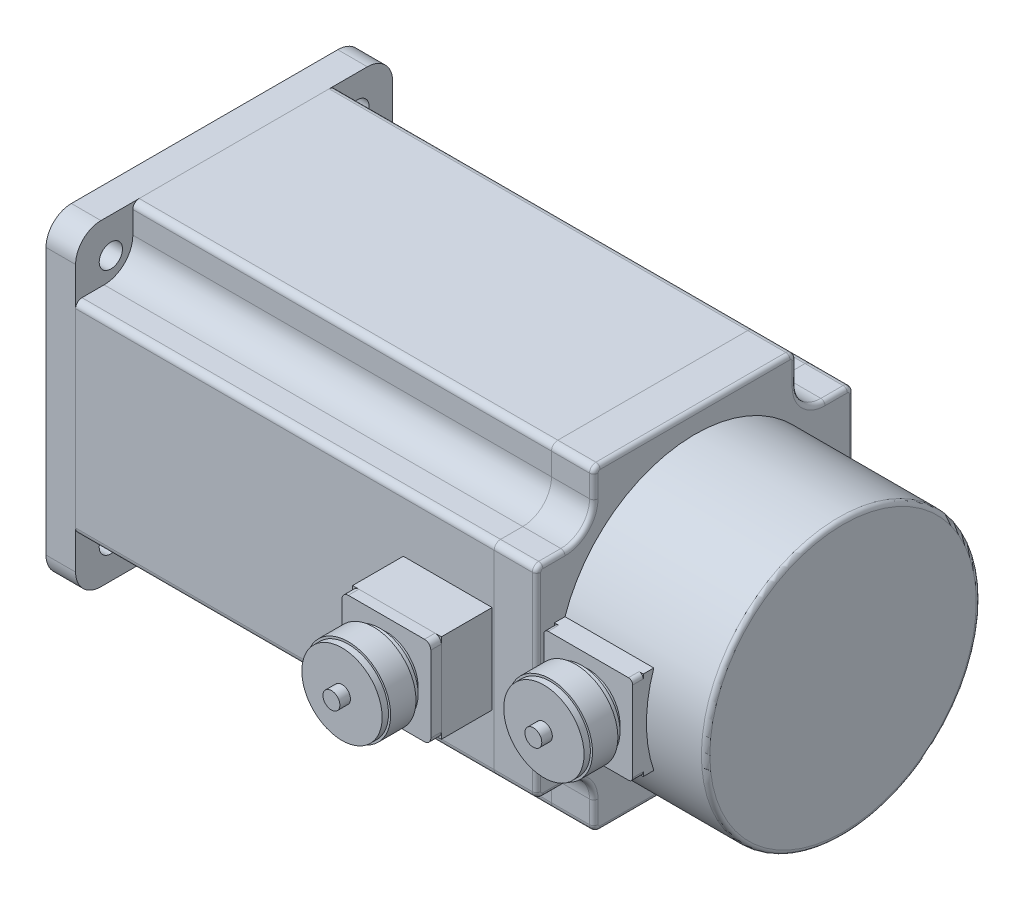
ISO-10303-21;
HEADER;
FILE_DESCRIPTION(('STEP AP214'),'2;1');
FILE_NAME('part.step','',(''),(''),'','','');
FILE_SCHEMA(('AUTOMOTIVE_DESIGN { 1 0 10303 214 1 1 1 1 }'));
ENDSEC;
DATA;
#1=APPLICATION_CONTEXT('core data for automotive mechanical design processes');
#2=APPLICATION_PROTOCOL_DEFINITION('international standard','automotive_design',2000,#1);
#3=PRODUCT_CONTEXT('',#1,'mechanical');
#4=PRODUCT('Part','Part','',(#3));
#5=PRODUCT_RELATED_PRODUCT_CATEGORY('part','',(#4));
#6=PRODUCT_DEFINITION_FORMATION('','',#4);
#7=PRODUCT_DEFINITION_CONTEXT('part definition',#1,'design');
#8=PRODUCT_DEFINITION('design','',#6,#7);
#9=PRODUCT_DEFINITION_SHAPE('','',#8);
#10=(LENGTH_UNIT() NAMED_UNIT(*) SI_UNIT(.MILLI.,.METRE.));
#11=(NAMED_UNIT(*) PLANE_ANGLE_UNIT() SI_UNIT($,.RADIAN.));
#12=(NAMED_UNIT(*) SI_UNIT($,.STERADIAN.) SOLID_ANGLE_UNIT());
#13=UNCERTAINTY_MEASURE_WITH_UNIT(LENGTH_MEASURE(1.E-05),#10,'distance_accuracy_value','');
#14=(GEOMETRIC_REPRESENTATION_CONTEXT(3) GLOBAL_UNCERTAINTY_ASSIGNED_CONTEXT((#13)) GLOBAL_UNIT_ASSIGNED_CONTEXT((#10,
#11,#12)) REPRESENTATION_CONTEXT('',''));
#15=CARTESIAN_POINT('',(0.,0.,0.));
#16=DIRECTION('',(0.,0.,1.));
#17=DIRECTION('',(1.,0.,0.));
#18=AXIS2_PLACEMENT_3D('',#15,#16,#17);
#19=CARTESIAN_POINT('',(-262.,-17.,0.));
#20=DIRECTION('',(0.,1.,0.));
#21=DIRECTION('',(0.,0.,1.));
#22=AXIS2_PLACEMENT_3D('',#19,#20,#21);
#23=CYLINDRICAL_SURFACE('',#22,3.99999999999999);
#24=CARTESIAN_POINT('',(-262.,-9.,0.));
#25=DIRECTION('',(0.,-1.,0.));
#26=DIRECTION('',(0.,0.,-1.));
#27=AXIS2_PLACEMENT_3D('',#24,#25,#26);
#28=CIRCLE('',#27,3.99999999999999);
#29=CARTESIAN_POINT('',(-262.,-9.,3.99999999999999));
#30=VERTEX_POINT('',#29);
#31=CARTESIAN_POINT('',(-262.,-9.,-3.99999999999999));
#32=VERTEX_POINT('',#31);
#33=EDGE_CURVE('E109',#30,#32,#28,.T.);
#34=ORIENTED_EDGE('',*,*,#33,.T.);
#35=DIRECTION('',(0.,1.,0.));
#36=VECTOR('',#35,1.);
#37=CARTESIAN_POINT('',(-262.,-17.,-3.99999999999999));
#38=LINE('',#37,#36);
#39=CARTESIAN_POINT('',(-262.,-17.,-3.99999999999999));
#40=VERTEX_POINT('',#39);
#41=EDGE_CURVE('E12',#40,#32,#38,.T.);
#42=ORIENTED_EDGE('',*,*,#41,.F.);
#43=CARTESIAN_POINT('',(-262.,-17.,0.));
#44=DIRECTION('',(0.,-1.,0.));
#45=DIRECTION('',(0.,0.,-1.));
#46=AXIS2_PLACEMENT_3D('',#43,#44,#45);
#47=CIRCLE('',#46,3.99999999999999);
#48=CARTESIAN_POINT('',(-262.,-17.,3.99999999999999));
#49=VERTEX_POINT('',#48);
#50=EDGE_CURVE('E97',#49,#40,#47,.T.);
#51=ORIENTED_EDGE('',*,*,#50,.F.);
#52=DIRECTION('',(0.,1.,0.));
#53=VECTOR('',#52,1.);
#54=CARTESIAN_POINT('',(-262.,-17.,3.99999999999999));
#55=LINE('',#54,#53);
#56=EDGE_CURVE('E105',#49,#30,#55,.T.);
#57=ORIENTED_EDGE('',*,*,#56,.T.);
#58=EDGE_LOOP('',(#34,#42,#51,#57));
#59=FACE_BOUND('',#58,.T.);
#60=ADVANCED_FACE('F46',(#59),#23,.T.);
#61=CARTESIAN_POINT('',(-225.,-17.,-3.99999999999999));
#62=DIRECTION('',(0.,0.,1.));
#63=DIRECTION('',(1.,0.,0.));
#64=AXIS2_PLACEMENT_3D('',#61,#62,#63);
#65=PLANE('',#64);
#66=DIRECTION('',(1.,0.,0.));
#67=VECTOR('',#66,1.);
#68=CARTESIAN_POINT('',(-225.,-9.,-3.99999999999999));
#69=LINE('',#68,#67);
#70=CARTESIAN_POINT('',(-225.,-9.,-3.99999999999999));
#71=VERTEX_POINT('',#70);
#72=EDGE_CURVE('E101',#32,#71,#69,.T.);
#73=ORIENTED_EDGE('',*,*,#72,.T.);
#74=DIRECTION('',(0.,1.,0.));
#75=VECTOR('',#74,1.);
#76=CARTESIAN_POINT('',(-225.,-17.,-3.99999999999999));
#77=LINE('',#76,#75);
#78=CARTESIAN_POINT('',(-225.,-17.,-3.99999999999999));
#79=VERTEX_POINT('',#78);
#80=EDGE_CURVE('E54',#79,#71,#77,.T.);
#81=ORIENTED_EDGE('',*,*,#80,.F.);
#82=DIRECTION('',(1.,0.,0.));
#83=VECTOR('',#82,1.);
#84=CARTESIAN_POINT('',(-225.,-17.,-3.99999999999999));
#85=LINE('',#84,#83);
#86=EDGE_CURVE('E92',#40,#79,#85,.T.);
#87=ORIENTED_EDGE('',*,*,#86,.F.);
#88=ORIENTED_EDGE('',*,*,#41,.T.);
#89=EDGE_LOOP('',(#73,#81,#87,#88));
#90=FACE_BOUND('',#89,.T.);
#91=ADVANCED_FACE('F100',(#90),#65,.F.);
#92=CARTESIAN_POINT('',(-225.,-17.,0.));
#93=DIRECTION('',(0.,1.,0.));
#94=DIRECTION('',(0.,0.,1.));
#95=AXIS2_PLACEMENT_3D('',#92,#93,#94);
#96=CYLINDRICAL_SURFACE('',#95,3.99999999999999);
#97=CARTESIAN_POINT('',(-225.,-9.,0.));
#98=DIRECTION('',(0.,-1.,0.));
#99=DIRECTION('',(0.,0.,-1.));
#100=AXIS2_PLACEMENT_3D('',#97,#98,#99);
#101=CIRCLE('',#100,3.99999999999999);
#102=CARTESIAN_POINT('',(-225.,-9.,3.99999999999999));
#103=VERTEX_POINT('',#102);
#104=EDGE_CURVE('E79',#71,#103,#101,.T.);
#105=ORIENTED_EDGE('',*,*,#104,.T.);
#106=DIRECTION('',(0.,1.,0.));
#107=VECTOR('',#106,1.);
#108=CARTESIAN_POINT('',(-225.,-17.,3.99999999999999));
#109=LINE('',#108,#107);
#110=CARTESIAN_POINT('',(-225.,-17.,3.99999999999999));
#111=VERTEX_POINT('',#110);
#112=EDGE_CURVE('E102',#111,#103,#109,.T.);
#113=ORIENTED_EDGE('',*,*,#112,.F.);
#114=CARTESIAN_POINT('',(-225.,-17.,0.));
#115=DIRECTION('',(0.,-1.,0.));
#116=DIRECTION('',(0.,0.,-1.));
#117=AXIS2_PLACEMENT_3D('',#114,#115,#116);
#118=CIRCLE('',#117,3.99999999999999);
#119=EDGE_CURVE('E95',#79,#111,#118,.T.);
#120=ORIENTED_EDGE('',*,*,#119,.F.);
#121=ORIENTED_EDGE('',*,*,#80,.T.);
#122=EDGE_LOOP('',(#105,#113,#120,#121));
#123=FACE_BOUND('',#122,.T.);
#124=ADVANCED_FACE('F103',(#123),#96,.T.);
#125=CARTESIAN_POINT('',(-262.,-17.,3.99999999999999));
#126=DIRECTION('',(0.,0.,-1.));
#127=DIRECTION('',(-1.,0.,0.));
#128=AXIS2_PLACEMENT_3D('',#125,#126,#127);
#129=PLANE('',#128);
#130=DIRECTION('',(-1.,0.,0.));
#131=VECTOR('',#130,1.);
#132=CARTESIAN_POINT('',(-262.,-9.,3.99999999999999));
#133=LINE('',#132,#131);
#134=EDGE_CURVE('E85',#103,#30,#133,.T.);
#135=ORIENTED_EDGE('',*,*,#134,.T.);
#136=ORIENTED_EDGE('',*,*,#56,.F.);
#137=DIRECTION('',(-1.,0.,0.));
#138=VECTOR('',#137,1.);
#139=CARTESIAN_POINT('',(-262.,-17.,3.99999999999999));
#140=LINE('',#139,#138);
#141=EDGE_CURVE('E62',#111,#49,#140,.T.);
#142=ORIENTED_EDGE('',*,*,#141,.F.);
#143=ORIENTED_EDGE('',*,*,#112,.T.);
#144=EDGE_LOOP('',(#135,#136,#142,#143));
#145=FACE_BOUND('',#144,.T.);
#146=ADVANCED_FACE('F116',(#145),#129,.F.);
#147=CARTESIAN_POINT('',(-262.,-17.,0.));
#148=DIRECTION('',(0.,-1.,0.));
#149=DIRECTION('',(0.,0.,-1.));
#150=AXIS2_PLACEMENT_3D('',#147,#148,#149);
#151=PLANE('',#150);
#152=ORIENTED_EDGE('',*,*,#50,.T.);
#153=ORIENTED_EDGE('',*,*,#86,.T.);
#154=ORIENTED_EDGE('',*,*,#119,.T.);
#155=ORIENTED_EDGE('',*,*,#141,.T.);
#156=EDGE_LOOP('',(#152,#153,#154,#155));
#157=FACE_BOUND('',#156,.T.);
#158=ADVANCED_FACE('F93',(#157),#151,.T.);
#159=CARTESIAN_POINT('',(-262.,-9.,0.));
#160=DIRECTION('',(0.,-1.,0.));
#161=DIRECTION('',(0.,0.,-1.));
#162=AXIS2_PLACEMENT_3D('',#159,#160,#161);
#163=PLANE('',#162);
#164=ORIENTED_EDGE('',*,*,#33,.F.);
#165=ORIENTED_EDGE('',*,*,#134,.F.);
#166=ORIENTED_EDGE('',*,*,#104,.F.);
#167=ORIENTED_EDGE('',*,*,#72,.F.);
#168=EDGE_LOOP('',(#164,#165,#166,#167));
#169=FACE_BOUND('',#168,.T.);
#170=ADVANCED_FACE('F119',(#169),#163,.F.);
#171=CLOSED_SHELL('',(#60,#91,#124,#146,#158,#170));
#172=MANIFOLD_SOLID_BREP('B2',#171);
#173=CARTESIAN_POINT('',(-270.,0.,0.));
#174=DIRECTION('',(1.,0.,0.));
#175=DIRECTION('',(0.,0.,-1.));
#176=AXIS2_PLACEMENT_3D('',#173,#174,#175);
#177=CYLINDRICAL_SURFACE('',#176,14.);
#178=CARTESIAN_POINT('',(-269.5,0.,0.));
#179=DIRECTION('',(-1.,0.,0.));
#180=DIRECTION('',(0.,0.,1.));
#181=AXIS2_PLACEMENT_3D('',#178,#179,#180);
#182=CIRCLE('',#181,14.);
#183=CARTESIAN_POINT('',(-269.5,0.,14.));
#184=VERTEX_POINT('',#183);
#185=EDGE_CURVE('E255',#184,#184,#182,.F.);
#186=ORIENTED_EDGE('',*,*,#185,.T.);
#187=EDGE_LOOP('',(#186));
#188=FACE_BOUND('',#187,.T.);
#189=CARTESIAN_POINT('',(-217.5,0.,0.));
#190=DIRECTION('',(-1.,0.,0.));
#191=DIRECTION('',(0.,0.,1.));
#192=AXIS2_PLACEMENT_3D('',#189,#190,#191);
#193=CIRCLE('',#192,14.);
#194=CARTESIAN_POINT('',(-217.5,0.,14.));
#195=VERTEX_POINT('',#194);
#196=EDGE_CURVE('E237',#195,#195,#193,.T.);
#197=ORIENTED_EDGE('',*,*,#196,.T.);
#198=EDGE_LOOP('',(#197));
#199=FACE_BOUND('',#198,.T.);
#200=CARTESIAN_POINT('',(-225.,-13.4164078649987,-3.99999999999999));
#201=CARTESIAN_POINT('',(-224.889963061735,-13.4163934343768,-4.00001343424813));
#202=CARTESIAN_POINT('',(-224.779934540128,-13.417761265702,-3.99545969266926));
#203=CARTESIAN_POINT('',(-224.560712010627,-13.4231542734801,-3.97732232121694));
#204=CARTESIAN_POINT('',(-224.451517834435,-13.4271788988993,-3.96374056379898));
#205=CARTESIAN_POINT('',(-224.234991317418,-13.4377658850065,-3.9276941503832));
#206=CARTESIAN_POINT('',(-224.127655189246,-13.4443222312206,-3.90525054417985));
#207=CARTESIAN_POINT('',(-223.915366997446,-13.4597622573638,-3.85169716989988));
#208=CARTESIAN_POINT('',(-223.810414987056,-13.4686459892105,-3.82058720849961));
#209=CARTESIAN_POINT('',(-223.500282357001,-13.4984072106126,-3.71462722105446));
#210=CARTESIAN_POINT('',(-223.299567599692,-13.5224082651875,-3.62710377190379));
#211=CARTESIAN_POINT('',(-222.915683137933,-13.5760110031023,-3.4209933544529));
#212=CARTESIAN_POINT('',(-222.732520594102,-13.6056149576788,-3.30239378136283));
#213=CARTESIAN_POINT('',(-222.383630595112,-13.6680345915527,-3.03385514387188));
#214=CARTESIAN_POINT('',(-222.21847497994,-13.7009134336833,-2.88318637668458));
#215=CARTESIAN_POINT('',(-221.91539864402,-13.7656378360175,-2.55635049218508));
#216=CARTESIAN_POINT('',(-221.777482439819,-13.7974832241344,-2.38017915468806));
#217=CARTESIAN_POINT('',(-221.53034061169,-13.8572672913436,-2.0032879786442));
#218=CARTESIAN_POINT('',(-221.42169609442,-13.885122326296,-1.80217262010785));
#219=CARTESIAN_POINT('',(-221.239992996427,-13.9330517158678,-1.38360719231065));
#220=CARTESIAN_POINT('',(-221.166925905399,-13.9531279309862,-1.16616104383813));
#221=CARTESIAN_POINT('',(-221.060331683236,-13.9827902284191,-0.727119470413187));
#222=CARTESIAN_POINT('',(-221.025822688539,-13.9926363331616,-0.505780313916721));
#223=CARTESIAN_POINT('',(-220.994226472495,-14.0016419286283,-0.0602449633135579));
#224=CARTESIAN_POINT('',(-220.997132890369,-14.0008032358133,0.163950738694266));
#225=CARTESIAN_POINT('',(-221.039612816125,-13.9887201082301,0.601961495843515));
#226=CARTESIAN_POINT('',(-221.078123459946,-13.9777773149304,0.815889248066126));
#227=CARTESIAN_POINT('',(-221.188991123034,-13.9470775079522,1.2341066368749));
#228=CARTESIAN_POINT('',(-221.261349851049,-13.9273200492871,1.43839578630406));
#229=CARTESIAN_POINT('',(-221.438618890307,-13.8807804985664,1.83414901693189));
#230=CARTESIAN_POINT('',(-221.543876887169,-13.853923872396,2.02544821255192));
#231=CARTESIAN_POINT('',(-221.783693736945,-13.7960546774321,2.38801825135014));
#232=CARTESIAN_POINT('',(-221.918258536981,-13.7650412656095,2.55928501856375));
#233=CARTESIAN_POINT('',(-222.218386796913,-13.7009177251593,2.88324485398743));
#234=CARTESIAN_POINT('',(-222.384870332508,-13.6677722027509,3.03507809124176));
#235=CARTESIAN_POINT('',(-222.741426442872,-13.6040627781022,3.30897556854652));
#236=CARTESIAN_POINT('',(-222.931505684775,-13.573499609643,3.43103136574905));
#237=CARTESIAN_POINT('',(-223.231158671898,-13.5321405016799,3.58945338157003));
#238=CARTESIAN_POINT('',(-223.333989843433,-13.5190503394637,3.63832313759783));
#239=CARTESIAN_POINT('',(-223.543626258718,-13.4948216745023,3.72718558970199));
#240=CARTESIAN_POINT('',(-223.650429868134,-13.4836823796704,3.767181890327));
#241=CARTESIAN_POINT('',(-223.867138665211,-13.463719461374,3.83791732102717));
#242=CARTESIAN_POINT('',(-223.977040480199,-13.4548934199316,3.86866612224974));
#243=CARTESIAN_POINT('',(-224.199195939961,-13.4398293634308,3.92067829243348));
#244=CARTESIAN_POINT('',(-224.311448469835,-13.4335901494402,3.94194605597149));
#245=CARTESIAN_POINT('',(-224.519732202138,-13.4246640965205,3.97223001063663));
#246=CARTESIAN_POINT('',(-224.615545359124,-13.4215735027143,3.98264484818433));
#247=CARTESIAN_POINT('',(-224.807569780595,-13.4174428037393,3.99652828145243));
#248=CARTESIAN_POINT('',(-224.903780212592,-13.4163995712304,4.0000074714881));
#249=CARTESIAN_POINT('',(-225.,-13.4164078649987,3.99999999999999));
#250=B_SPLINE_CURVE_WITH_KNOTS('',3,(#200,#201,#202,#203,#204,#205,#206,#207,#208,#209,#210,
#211,#212,#213,#214,#215,#216,#217,#218,#219,#220,#221,#222,#223,#224,#225,#226,#227,#228,#229,
#230,#231,#232,#233,#234,#235,#236,#237,#238,#239,#240,#241,#242,#243,#244,#245,#246,#247,#248,
#249),.UNSPECIFIED.,.F.,.F.,(4,2,2,2,2,2,2,2,2,2,2,2,2,2,2,2,2,2,2,2,2,2,2,2,4),(0.,
0.329993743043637,0.65991906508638,0.98906537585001,1.31821902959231,1.97575167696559,
2.6335514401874,3.30832474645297,3.98320984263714,4.67064278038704,5.35791119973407,
6.02724874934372,6.69647251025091,7.34634193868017,7.99624417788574,8.65326120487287,
9.31041168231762,9.99056134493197,10.6709036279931,11.0143588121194,11.3576742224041,
11.700629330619,12.0434253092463,12.3324405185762,12.6210139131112),.UNSPECIFIED.);
#251=CARTESIAN_POINT('',(-225.,-13.4164078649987,-3.99999999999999));
#252=VERTEX_POINT('',#251);
#253=CARTESIAN_POINT('',(-225.,-13.4164078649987,3.99999999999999));
#254=VERTEX_POINT('',#253);
#255=EDGE_CURVE('E258',#252,#254,#250,.T.);
#256=ORIENTED_EDGE('',*,*,#255,.F.);
#257=DIRECTION('',(1.,0.,0.));
#258=VECTOR('',#257,1.);
#259=CARTESIAN_POINT('',(-270.,-13.4164078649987,-3.99999999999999));
#260=LINE('',#259,#258);
#261=CARTESIAN_POINT('',(-262.,-13.4164078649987,-3.99999999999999));
#262=VERTEX_POINT('',#261);
#263=EDGE_CURVE('E44',#262,#252,#260,.T.);
#264=ORIENTED_EDGE('',*,*,#263,.F.);
#265=CARTESIAN_POINT('',(-262.,-13.4164078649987,3.99999999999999));
#266=CARTESIAN_POINT('',(-262.110036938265,-13.4163934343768,4.00001343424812));
#267=CARTESIAN_POINT('',(-262.220065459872,-13.417761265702,3.99545969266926));
#268=CARTESIAN_POINT('',(-262.439287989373,-13.4231542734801,3.97732232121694));
#269=CARTESIAN_POINT('',(-262.548482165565,-13.4271788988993,3.96374056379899));
#270=CARTESIAN_POINT('',(-262.765008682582,-13.4377658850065,3.92769415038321));
#271=CARTESIAN_POINT('',(-262.872344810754,-13.4443222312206,3.90525054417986));
#272=CARTESIAN_POINT('',(-263.084633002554,-13.4597622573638,3.85169716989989));
#273=CARTESIAN_POINT('',(-263.189585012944,-13.4686459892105,3.82058720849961));
#274=CARTESIAN_POINT('',(-263.499717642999,-13.4984072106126,3.71462722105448));
#275=CARTESIAN_POINT('',(-263.700432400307,-13.5224082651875,3.62710377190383));
#276=CARTESIAN_POINT('',(-264.084316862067,-13.5760110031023,3.42099335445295));
#277=CARTESIAN_POINT('',(-264.267479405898,-13.6056149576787,3.30239378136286));
#278=CARTESIAN_POINT('',(-264.616369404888,-13.6680345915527,3.03385514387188));
#279=CARTESIAN_POINT('',(-264.78152502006,-13.7009134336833,2.88318637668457));
#280=CARTESIAN_POINT('',(-265.08460135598,-13.7656378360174,2.55635049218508));
#281=CARTESIAN_POINT('',(-265.222517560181,-13.7974832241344,2.38017915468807));
#282=CARTESIAN_POINT('',(-265.46965938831,-13.8572672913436,2.00328797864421));
#283=CARTESIAN_POINT('',(-265.57830390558,-13.8851223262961,1.80217262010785));
#284=CARTESIAN_POINT('',(-265.760007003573,-13.9330517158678,1.38360719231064));
#285=CARTESIAN_POINT('',(-265.833074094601,-13.9531279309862,1.16616104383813));
#286=CARTESIAN_POINT('',(-265.939668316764,-13.9827902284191,0.7271194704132));
#287=CARTESIAN_POINT('',(-265.974177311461,-13.9926363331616,0.505780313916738));
#288=CARTESIAN_POINT('',(-266.005773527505,-14.0016419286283,0.0602449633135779));
#289=CARTESIAN_POINT('',(-266.002867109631,-14.0008032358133,-0.163950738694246));
#290=CARTESIAN_POINT('',(-265.960387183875,-13.9887201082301,-0.601961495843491));
#291=CARTESIAN_POINT('',(-265.921876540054,-13.9777773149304,-0.815889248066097));
#292=CARTESIAN_POINT('',(-265.811008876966,-13.9470775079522,-1.23410663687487));
#293=CARTESIAN_POINT('',(-265.738650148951,-13.9273200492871,-1.43839578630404));
#294=CARTESIAN_POINT('',(-265.561381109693,-13.8807804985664,-1.83414901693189));
#295=CARTESIAN_POINT('',(-265.456123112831,-13.8539238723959,-2.02544821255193));
#296=CARTESIAN_POINT('',(-265.216306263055,-13.7960546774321,-2.38801825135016));
#297=CARTESIAN_POINT('',(-265.081741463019,-13.7650412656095,-2.55928501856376));
#298=CARTESIAN_POINT('',(-264.781613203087,-13.7009177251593,-2.88324485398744));
#299=CARTESIAN_POINT('',(-264.615129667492,-13.6677722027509,-3.03507809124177));
#300=CARTESIAN_POINT('',(-264.258573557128,-13.6040627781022,-3.30897556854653));
#301=CARTESIAN_POINT('',(-264.068494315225,-13.573499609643,-3.43103136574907));
#302=CARTESIAN_POINT('',(-263.768841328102,-13.5321405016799,-3.58945338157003));
#303=CARTESIAN_POINT('',(-263.666010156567,-13.5190503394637,-3.63832313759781));
#304=CARTESIAN_POINT('',(-263.456373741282,-13.4948216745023,-3.72718558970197));
#305=CARTESIAN_POINT('',(-263.349570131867,-13.4836823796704,-3.76718189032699));
#306=CARTESIAN_POINT('',(-263.132861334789,-13.463719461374,-3.83791732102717));
#307=CARTESIAN_POINT('',(-263.022959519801,-13.4548934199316,-3.86866612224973));
#308=CARTESIAN_POINT('',(-262.800804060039,-13.4398293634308,-3.92067829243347));
#309=CARTESIAN_POINT('',(-262.688551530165,-13.4335901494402,-3.94194605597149));
#310=CARTESIAN_POINT('',(-262.480267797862,-13.4246640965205,-3.97223001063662));
#311=CARTESIAN_POINT('',(-262.384454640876,-13.4215735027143,-3.98264484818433));
#312=CARTESIAN_POINT('',(-262.192430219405,-13.4174428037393,-3.99652828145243));
#313=CARTESIAN_POINT('',(-262.096219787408,-13.4163995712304,-4.0000074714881));
#314=CARTESIAN_POINT('',(-262.,-13.4164078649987,-3.99999999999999));
#315=B_SPLINE_CURVE_WITH_KNOTS('',3,(#265,#266,#267,#268,#269,#270,#271,#272,#273,#274,#275,
#276,#277,#278,#279,#280,#281,#282,#283,#284,#285,#286,#287,#288,#289,#290,#291,#292,#293,#294,
#295,#296,#297,#298,#299,#300,#301,#302,#303,#304,#305,#306,#307,#308,#309,#310,#311,#312,#313,
#314),.UNSPECIFIED.,.F.,.F.,(4,2,2,2,2,2,2,2,2,2,2,2,2,2,2,2,2,2,2,2,2,2,2,2,4),(0.,
0.32999374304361,0.659919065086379,0.989065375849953,1.31821902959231,1.97575167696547,
2.6335514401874,3.30832474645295,3.98320984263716,4.67064278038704,5.35791119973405,
6.0272487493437,6.69647251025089,7.34634193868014,7.99624417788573,8.65326120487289,
9.31041168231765,9.99056134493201,10.6709036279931,11.0143588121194,11.357674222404,
11.700629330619,12.0434253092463,12.3324405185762,12.6210139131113),.UNSPECIFIED.);
#316=CARTESIAN_POINT('',(-262.,-13.4164078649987,3.99999999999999));
#317=VERTEX_POINT('',#316);
#318=EDGE_CURVE('E186',#317,#262,#315,.T.);
#319=ORIENTED_EDGE('',*,*,#318,.F.);
#320=DIRECTION('',(1.,0.,0.));
#321=VECTOR('',#320,1.);
#322=CARTESIAN_POINT('',(-270.,-13.4164078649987,3.99999999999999));
#323=LINE('',#322,#321);
#324=EDGE_CURVE('E236',#254,#317,#323,.F.);
#325=ORIENTED_EDGE('',*,*,#324,.F.);
#326=EDGE_LOOP('',(#256,#264,#319,#325));
#327=FACE_BOUND('',#326,.T.);
#328=ADVANCED_FACE('F178',(#188,#199,#327),#177,.T.);
#329=CARTESIAN_POINT('',(-217.5,0.,0.));
#330=DIRECTION('',(-1.,0.,0.));
#331=DIRECTION('',(0.,0.,1.));
#332=AXIS2_PLACEMENT_3D('',#329,#330,#331);
#333=PLANE('',#332);
#334=CARTESIAN_POINT('',(-217.5,0.,0.));
#335=DIRECTION('',(-1.,0.,0.));
#336=DIRECTION('',(0.,0.,1.));
#337=AXIS2_PLACEMENT_3D('',#334,#335,#336);
#338=CIRCLE('',#337,17.);
#339=CARTESIAN_POINT('',(-217.5,0.,17.));
#340=VERTEX_POINT('',#339);
#341=EDGE_CURVE('E249',#340,#340,#338,.T.);
#342=ORIENTED_EDGE('',*,*,#341,.T.);
#343=EDGE_LOOP('',(#342));
#344=FACE_BOUND('',#343,.T.);
#345=ORIENTED_EDGE('',*,*,#196,.F.);
#346=EDGE_LOOP('',(#345));
#347=FACE_BOUND('',#346,.T.);
#348=ADVANCED_FACE('F295',(#344,#347),#333,.T.);
#349=CARTESIAN_POINT('',(-217.,0.,0.));
#350=DIRECTION('',(-1.,0.,0.));
#351=DIRECTION('',(0.,0.,1.));
#352=AXIS2_PLACEMENT_3D('',#349,#350,#351);
#353=PLANE('',#352);
#354=CARTESIAN_POINT('',(-217.,0.,0.));
#355=DIRECTION('',(-1.,0.,0.));
#356=DIRECTION('',(0.,0.,1.));
#357=AXIS2_PLACEMENT_3D('',#354,#355,#356);
#358=CIRCLE('',#357,17.5);
#359=CARTESIAN_POINT('',(-217.,0.,17.5));
#360=VERTEX_POINT('',#359);
#361=EDGE_CURVE('E241',#360,#360,#358,.T.);
#362=ORIENTED_EDGE('',*,*,#361,.F.);
#363=EDGE_LOOP('',(#362));
#364=FACE_BOUND('',#363,.T.);
#365=ADVANCED_FACE('F300',(#364),#353,.F.);
#366=CARTESIAN_POINT('',(-217.,0.,0.));
#367=DIRECTION('',(-1.,0.,0.));
#368=DIRECTION('',(0.,0.,1.));
#369=AXIS2_PLACEMENT_3D('',#366,#367,#368);
#370=TOROIDAL_SURFACE('',#369,17.,0.5);
#371=ORIENTED_EDGE('',*,*,#361,.T.);
#372=EDGE_LOOP('',(#371));
#373=FACE_BOUND('',#372,.T.);
#374=ORIENTED_EDGE('',*,*,#341,.F.);
#375=EDGE_LOOP('',(#374));
#376=FACE_BOUND('',#375,.T.);
#377=ADVANCED_FACE('F312',(#373,#376),#370,.T.);
#378=CARTESIAN_POINT('',(-270.,0.,0.));
#379=DIRECTION('',(-1.,0.,0.));
#380=DIRECTION('',(0.,0.,1.));
#381=AXIS2_PLACEMENT_3D('',#378,#379,#380);
#382=PLANE('',#381);
#383=CARTESIAN_POINT('',(-270.,0.,0.));
#384=DIRECTION('',(-1.,0.,0.));
#385=DIRECTION('',(0.,0.,1.));
#386=AXIS2_PLACEMENT_3D('',#383,#384,#385);
#387=CIRCLE('',#386,13.5);
#388=CARTESIAN_POINT('',(-270.,0.,13.5));
#389=VERTEX_POINT('',#388);
#390=EDGE_CURVE('E252',#389,#389,#387,.T.);
#391=ORIENTED_EDGE('',*,*,#390,.T.);
#392=EDGE_LOOP('',(#391));
#393=FACE_BOUND('',#392,.T.);
#394=ADVANCED_FACE('F280',(#393),#382,.T.);
#395=CARTESIAN_POINT('',(-270.,0.,0.));
#396=DIRECTION('',(1.,0.,0.));
#397=DIRECTION('',(0.,0.,-1.));
#398=AXIS2_PLACEMENT_3D('',#395,#396,#397);
#399=CONICAL_SURFACE('',#398,13.5,0.785398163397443);
#400=ORIENTED_EDGE('',*,*,#185,.F.);
#401=EDGE_LOOP('',(#400));
#402=FACE_BOUND('',#401,.T.);
#403=ORIENTED_EDGE('',*,*,#390,.F.);
#404=EDGE_LOOP('',(#403));
#405=FACE_BOUND('',#404,.T.);
#406=ADVANCED_FACE('F180',(#402,#405),#399,.T.);
#407=CARTESIAN_POINT('',(-262.,-9.,0.));
#408=DIRECTION('',(0.,-1.,0.));
#409=DIRECTION('',(0.,0.,-1.));
#410=AXIS2_PLACEMENT_3D('',#407,#408,#409);
#411=CYLINDRICAL_SURFACE('',#410,3.99999999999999);
#412=DIRECTION('',(0.,-1.,0.));
#413=VECTOR('',#412,1.);
#414=CARTESIAN_POINT('',(-262.,-9.,3.99999999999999));
#415=LINE('',#414,#413);
#416=CARTESIAN_POINT('',(-262.,-9.,3.99999999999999));
#417=VERTEX_POINT('',#416);
#418=EDGE_CURVE('E233',#417,#317,#415,.T.);
#419=ORIENTED_EDGE('',*,*,#418,.T.);
#420=ORIENTED_EDGE('',*,*,#318,.T.);
#421=DIRECTION('',(0.,-1.,0.));
#422=VECTOR('',#421,1.);
#423=CARTESIAN_POINT('',(-262.,-9.,-3.99999999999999));
#424=LINE('',#423,#422);
#425=CARTESIAN_POINT('',(-262.,-9.,-3.99999999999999));
#426=VERTEX_POINT('',#425);
#427=EDGE_CURVE('E192',#426,#262,#424,.T.);
#428=ORIENTED_EDGE('',*,*,#427,.F.);
#429=CARTESIAN_POINT('',(-262.,-9.,0.));
#430=DIRECTION('',(0.,1.,0.));
#431=DIRECTION('',(0.,0.,1.));
#432=AXIS2_PLACEMENT_3D('',#429,#430,#431);
#433=CIRCLE('',#432,3.99999999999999);
#434=EDGE_CURVE('E223',#426,#417,#433,.T.);
#435=ORIENTED_EDGE('',*,*,#434,.T.);
#436=EDGE_LOOP('',(#419,#420,#428,#435));
#437=FACE_BOUND('',#436,.T.);
#438=ADVANCED_FACE('F232',(#437),#411,.F.);
#439=CARTESIAN_POINT('',(-262.,-9.,3.99999999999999));
#440=DIRECTION('',(0.,0.,-1.));
#441=DIRECTION('',(-1.,0.,0.));
#442=AXIS2_PLACEMENT_3D('',#439,#440,#441);
#443=PLANE('',#442);
#444=ORIENTED_EDGE('',*,*,#324,.T.);
#445=ORIENTED_EDGE('',*,*,#418,.F.);
#446=DIRECTION('',(1.,0.,0.));
#447=VECTOR('',#446,1.);
#448=CARTESIAN_POINT('',(-262.,-9.,3.99999999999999));
#449=LINE('',#448,#447);
#450=CARTESIAN_POINT('',(-225.,-9.,3.99999999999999));
#451=VERTEX_POINT('',#450);
#452=EDGE_CURVE('E219',#417,#451,#449,.T.);
#453=ORIENTED_EDGE('',*,*,#452,.T.);
#454=DIRECTION('',(0.,-1.,0.));
#455=VECTOR('',#454,1.);
#456=CARTESIAN_POINT('',(-225.,-9.,3.99999999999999));
#457=LINE('',#456,#455);
#458=EDGE_CURVE('E238',#451,#254,#457,.T.);
#459=ORIENTED_EDGE('',*,*,#458,.T.);
#460=EDGE_LOOP('',(#444,#445,#453,#459));
#461=FACE_BOUND('',#460,.T.);
#462=ADVANCED_FACE('F235',(#461),#443,.T.);
#463=CARTESIAN_POINT('',(-225.,-9.,0.));
#464=DIRECTION('',(0.,-1.,0.));
#465=DIRECTION('',(0.,0.,-1.));
#466=AXIS2_PLACEMENT_3D('',#463,#464,#465);
#467=CYLINDRICAL_SURFACE('',#466,3.99999999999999);
#468=DIRECTION('',(0.,-1.,0.));
#469=VECTOR('',#468,1.);
#470=CARTESIAN_POINT('',(-225.,-9.,-3.99999999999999));
#471=LINE('',#470,#469);
#472=CARTESIAN_POINT('',(-225.,-9.,-3.99999999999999));
#473=VERTEX_POINT('',#472);
#474=EDGE_CURVE('E243',#473,#252,#471,.T.);
#475=ORIENTED_EDGE('',*,*,#474,.T.);
#476=ORIENTED_EDGE('',*,*,#255,.T.);
#477=ORIENTED_EDGE('',*,*,#458,.F.);
#478=CARTESIAN_POINT('',(-225.,-9.,0.));
#479=DIRECTION('',(0.,1.,0.));
#480=DIRECTION('',(0.,0.,1.));
#481=AXIS2_PLACEMENT_3D('',#478,#479,#480);
#482=CIRCLE('',#481,3.99999999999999);
#483=EDGE_CURVE('E224',#451,#473,#482,.T.);
#484=ORIENTED_EDGE('',*,*,#483,.T.);
#485=EDGE_LOOP('',(#475,#476,#477,#484));
#486=FACE_BOUND('',#485,.T.);
#487=ADVANCED_FACE('F268',(#486),#467,.F.);
#488=CARTESIAN_POINT('',(-225.,-9.,-3.99999999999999));
#489=DIRECTION('',(0.,0.,1.));
#490=DIRECTION('',(1.,0.,0.));
#491=AXIS2_PLACEMENT_3D('',#488,#489,#490);
#492=PLANE('',#491);
#493=ORIENTED_EDGE('',*,*,#263,.T.);
#494=ORIENTED_EDGE('',*,*,#474,.F.);
#495=DIRECTION('',(-1.,0.,0.));
#496=VECTOR('',#495,1.);
#497=CARTESIAN_POINT('',(-225.,-9.,-3.99999999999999));
#498=LINE('',#497,#496);
#499=EDGE_CURVE('E286',#473,#426,#498,.T.);
#500=ORIENTED_EDGE('',*,*,#499,.T.);
#501=ORIENTED_EDGE('',*,*,#427,.T.);
#502=EDGE_LOOP('',(#493,#494,#500,#501));
#503=FACE_BOUND('',#502,.T.);
#504=ADVANCED_FACE('F273',(#503),#492,.T.);
#505=CARTESIAN_POINT('',(-262.,-9.,0.));
#506=DIRECTION('',(0.,1.,0.));
#507=DIRECTION('',(0.,0.,1.));
#508=AXIS2_PLACEMENT_3D('',#505,#506,#507);
#509=PLANE('',#508);
#510=ORIENTED_EDGE('',*,*,#434,.F.);
#511=ORIENTED_EDGE('',*,*,#499,.F.);
#512=ORIENTED_EDGE('',*,*,#483,.F.);
#513=ORIENTED_EDGE('',*,*,#452,.F.);
#514=EDGE_LOOP('',(#510,#511,#512,#513));
#515=FACE_BOUND('',#514,.T.);
#516=ADVANCED_FACE('F221',(#515),#509,.F.);
#517=CLOSED_SHELL('',(#328,#348,#365,#377,#394,#406,#438,#462,#487,#504,#516));
#518=MANIFOLD_SOLID_BREP('B6',#517);
#519=CARTESIAN_POINT('',(-22.,0.,125.));
#520=DIRECTION('',(0.,0.,1.));
#521=DIRECTION('',(1.,0.,0.));
#522=AXIS2_PLACEMENT_3D('',#519,#520,#521);
#523=PLANE('',#522);
#524=CARTESIAN_POINT('',(-22.,0.,125.));
#525=DIRECTION('',(0.,0.,1.));
#526=DIRECTION('',(1.,0.,0.));
#527=AXIS2_PLACEMENT_3D('',#524,#525,#526);
#528=CIRCLE('',#527,19.);
#529=CARTESIAN_POINT('',(-3.,0.,125.));
#530=VERTEX_POINT('',#529);
#531=EDGE_CURVE('E406',#530,#530,#528,.T.);
#532=ORIENTED_EDGE('',*,*,#531,.T.);
#533=EDGE_LOOP('',(#532));
#534=FACE_BOUND('',#533,.T.);
#535=CARTESIAN_POINT('',(-22.,0.,125.));
#536=DIRECTION('',(0.,0.,1.));
#537=DIRECTION('',(1.,0.,0.));
#538=AXIS2_PLACEMENT_3D('',#535,#536,#537);
#539=CIRCLE('',#538,4.);
#540=CARTESIAN_POINT('',(-18.,0.,125.));
#541=VERTEX_POINT('',#540);
#542=EDGE_CURVE('E414',#541,#541,#539,.T.);
#543=ORIENTED_EDGE('',*,*,#542,.F.);
#544=EDGE_LOOP('',(#543));
#545=FACE_BOUND('',#544,.T.);
#546=ADVANCED_FACE('F395',(#534,#545),#523,.T.);
#547=CARTESIAN_POINT('',(-22.,0.,122.));
#548=DIRECTION('',(0.,0.,1.));
#549=DIRECTION('',(1.,0.,0.));
#550=AXIS2_PLACEMENT_3D('',#547,#548,#549);
#551=PLANE('',#550);
#552=CARTESIAN_POINT('',(-22.,0.,122.));
#553=DIRECTION('',(0.,0.,1.));
#554=DIRECTION('',(1.,0.,0.));
#555=AXIS2_PLACEMENT_3D('',#552,#553,#554);
#556=CIRCLE('',#555,20.);
#557=CARTESIAN_POINT('',(-2.,0.,122.));
#558=VERTEX_POINT('',#557);
#559=EDGE_CURVE('E177',#558,#558,#556,.T.);
#560=ORIENTED_EDGE('',*,*,#559,.T.);
#561=EDGE_LOOP('',(#560));
#562=FACE_BOUND('',#561,.T.);
#563=CARTESIAN_POINT('',(-22.,0.,122.));
#564=DIRECTION('',(0.,0.,1.));
#565=DIRECTION('',(1.,0.,0.));
#566=AXIS2_PLACEMENT_3D('',#563,#564,#565);
#567=CIRCLE('',#566,19.);
#568=CARTESIAN_POINT('',(-3.,0.,122.));
#569=VERTEX_POINT('',#568);
#570=EDGE_CURVE('E408',#569,#569,#567,.T.);
#571=ORIENTED_EDGE('',*,*,#570,.F.);
#572=EDGE_LOOP('',(#571));
#573=FACE_BOUND('',#572,.T.);
#574=ADVANCED_FACE('F430',(#562,#573),#551,.T.);
#575=CARTESIAN_POINT('',(-22.,0.,122.));
#576=DIRECTION('',(0.,0.,-1.));
#577=DIRECTION('',(-1.,0.,0.));
#578=AXIS2_PLACEMENT_3D('',#575,#576,#577);
#579=CYLINDRICAL_SURFACE('',#578,20.);
#580=ORIENTED_EDGE('',*,*,#559,.F.);
#581=EDGE_LOOP('',(#580));
#582=FACE_BOUND('',#581,.T.);
#583=CARTESIAN_POINT('',(-22.,0.,110.));
#584=DIRECTION('',(0.,0.,1.));
#585=DIRECTION('',(1.,0.,0.));
#586=AXIS2_PLACEMENT_3D('',#583,#584,#585);
#587=CIRCLE('',#586,20.);
#588=CARTESIAN_POINT('',(-2.,0.,110.));
#589=VERTEX_POINT('',#588);
#590=EDGE_CURVE('E399',#589,#589,#587,.T.);
#591=ORIENTED_EDGE('',*,*,#590,.T.);
#592=EDGE_LOOP('',(#591));
#593=FACE_BOUND('',#592,.T.);
#594=ADVANCED_FACE('F397',(#582,#593),#579,.T.);
#595=CARTESIAN_POINT('',(-22.,0.,110.));
#596=DIRECTION('',(0.,0.,1.));
#597=DIRECTION('',(1.,0.,0.));
#598=AXIS2_PLACEMENT_3D('',#595,#596,#597);
#599=PLANE('',#598);
#600=ORIENTED_EDGE('',*,*,#590,.F.);
#601=EDGE_LOOP('',(#600));
#602=FACE_BOUND('',#601,.T.);
#603=ADVANCED_FACE('F440',(#602),#599,.F.);
#604=CARTESIAN_POINT('',(-22.,0.,125.));
#605=DIRECTION('',(0.,0.,-1.));
#606=DIRECTION('',(-1.,0.,0.));
#607=AXIS2_PLACEMENT_3D('',#604,#605,#606);
#608=CYLINDRICAL_SURFACE('',#607,19.);
#609=ORIENTED_EDGE('',*,*,#531,.F.);
#610=EDGE_LOOP('',(#609));
#611=FACE_BOUND('',#610,.T.);
#612=ORIENTED_EDGE('',*,*,#570,.T.);
#613=EDGE_LOOP('',(#612));
#614=FACE_BOUND('',#613,.T.);
#615=ADVANCED_FACE('F425',(#611,#614),#608,.T.);
#616=CARTESIAN_POINT('',(-22.,0.,130.));
#617=DIRECTION('',(0.,0.,-1.));
#618=DIRECTION('',(-1.,0.,0.));
#619=AXIS2_PLACEMENT_3D('',#616,#617,#618);
#620=CYLINDRICAL_SURFACE('',#619,4.);
#621=CARTESIAN_POINT('',(-22.,0.,130.));
#622=DIRECTION('',(0.,0.,1.));
#623=DIRECTION('',(1.,0.,0.));
#624=AXIS2_PLACEMENT_3D('',#621,#622,#623);
#625=CIRCLE('',#624,4.);
#626=CARTESIAN_POINT('',(-18.,0.,130.));
#627=VERTEX_POINT('',#626);
#628=EDGE_CURVE('E411',#627,#627,#625,.T.);
#629=ORIENTED_EDGE('',*,*,#628,.F.);
#630=EDGE_LOOP('',(#629));
#631=FACE_BOUND('',#630,.T.);
#632=ORIENTED_EDGE('',*,*,#542,.T.);
#633=EDGE_LOOP('',(#632));
#634=FACE_BOUND('',#633,.T.);
#635=ADVANCED_FACE('F422',(#631,#634),#620,.T.);
#636=CARTESIAN_POINT('',(-22.,0.,130.));
#637=DIRECTION('',(0.,0.,1.));
#638=DIRECTION('',(1.,0.,0.));
#639=AXIS2_PLACEMENT_3D('',#636,#637,#638);
#640=PLANE('',#639);
#641=ORIENTED_EDGE('',*,*,#628,.T.);
#642=EDGE_LOOP('',(#641));
#643=FACE_BOUND('',#642,.T.);
#644=ADVANCED_FACE('F420',(#643),#640,.T.);
#645=CLOSED_SHELL('',(#546,#574,#594,#603,#615,#635,#644));
#646=MANIFOLD_SOLID_BREP('B38',#645);
#647=CARTESIAN_POINT('',(-22.,0.,110.));
#648=DIRECTION('',(0.,0.,-1.));
#649=DIRECTION('',(-1.,0.,0.));
#650=AXIS2_PLACEMENT_3D('',#647,#648,#649);
#651=CYLINDRICAL_SURFACE('',#650,18.);
#652=CARTESIAN_POINT('',(-22.,0.,110.));
#653=DIRECTION('',(0.,0.,1.));
#654=DIRECTION('',(1.,0.,0.));
#655=AXIS2_PLACEMENT_3D('',#652,#653,#654);
#656=CIRCLE('',#655,18.);
#657=CARTESIAN_POINT('',(-4.,0.,110.));
#658=VERTEX_POINT('',#657);
#659=EDGE_CURVE('E394',#658,#658,#656,.T.);
#660=ORIENTED_EDGE('',*,*,#659,.F.);
#661=EDGE_LOOP('',(#660));
#662=FACE_BOUND('',#661,.T.);
#663=CARTESIAN_POINT('',(-22.,0.,107.));
#664=DIRECTION('',(0.,0.,1.));
#665=DIRECTION('',(1.,0.,0.));
#666=AXIS2_PLACEMENT_3D('',#663,#664,#665);
#667=CIRCLE('',#666,18.);
#668=CARTESIAN_POINT('',(-4.,0.,107.));
#669=VERTEX_POINT('',#668);
#670=EDGE_CURVE('E507',#669,#669,#667,.T.);
#671=ORIENTED_EDGE('',*,*,#670,.T.);
#672=EDGE_LOOP('',(#671));
#673=FACE_BOUND('',#672,.T.);
#674=ADVANCED_FACE('F504',(#662,#673),#651,.T.);
#675=CARTESIAN_POINT('',(-22.,0.,110.));
#676=DIRECTION('',(0.,0.,1.));
#677=DIRECTION('',(1.,0.,0.));
#678=AXIS2_PLACEMENT_3D('',#675,#676,#677);
#679=PLANE('',#678);
#680=ORIENTED_EDGE('',*,*,#659,.T.);
#681=EDGE_LOOP('',(#680));
#682=FACE_BOUND('',#681,.T.);
#683=ADVANCED_FACE('F519',(#682),#679,.T.);
#684=CARTESIAN_POINT('',(-22.,0.,107.));
#685=DIRECTION('',(0.,0.,1.));
#686=DIRECTION('',(1.,0.,0.));
#687=AXIS2_PLACEMENT_3D('',#684,#685,#686);
#688=PLANE('',#687);
#689=ORIENTED_EDGE('',*,*,#670,.F.);
#690=EDGE_LOOP('',(#689));
#691=FACE_BOUND('',#690,.T.);
#692=ADVANCED_FACE('F517',(#691),#688,.F.);
#693=CLOSED_SHELL('',(#674,#683,#692));
#694=MANIFOLD_SOLID_BREP('B172',#693);
#695=CARTESIAN_POINT('',(-22.,0.,107.));
#696=DIRECTION('',(0.,0.,-1.));
#697=DIRECTION('',(-1.,0.,0.));
#698=AXIS2_PLACEMENT_3D('',#695,#696,#697);
#699=CYLINDRICAL_SURFACE('',#698,15.);
#700=CARTESIAN_POINT('',(-22.,0.,107.));
#701=DIRECTION('',(0.,0.,1.));
#702=DIRECTION('',(1.,0.,0.));
#703=AXIS2_PLACEMENT_3D('',#700,#701,#702);
#704=CIRCLE('',#703,15.);
#705=CARTESIAN_POINT('',(-7.,0.,107.));
#706=VERTEX_POINT('',#705);
#707=EDGE_CURVE('E503',#706,#706,#704,.T.);
#708=ORIENTED_EDGE('',*,*,#707,.F.);
#709=EDGE_LOOP('',(#708));
#710=FACE_BOUND('',#709,.T.);
#711=CARTESIAN_POINT('',(-22.,0.,104.));
#712=DIRECTION('',(0.,0.,1.));
#713=DIRECTION('',(1.,0.,0.));
#714=AXIS2_PLACEMENT_3D('',#711,#712,#713);
#715=CIRCLE('',#714,15.);
#716=CARTESIAN_POINT('',(-7.,0.,104.));
#717=VERTEX_POINT('',#716);
#718=EDGE_CURVE('E558',#717,#717,#715,.T.);
#719=ORIENTED_EDGE('',*,*,#718,.T.);
#720=EDGE_LOOP('',(#719));
#721=FACE_BOUND('',#720,.T.);
#722=ADVANCED_FACE('F555',(#710,#721),#699,.T.);
#723=CARTESIAN_POINT('',(-22.,0.,107.));
#724=DIRECTION('',(0.,0.,1.));
#725=DIRECTION('',(1.,0.,0.));
#726=AXIS2_PLACEMENT_3D('',#723,#724,#725);
#727=PLANE('',#726);
#728=ORIENTED_EDGE('',*,*,#707,.T.);
#729=EDGE_LOOP('',(#728));
#730=FACE_BOUND('',#729,.T.);
#731=ADVANCED_FACE('F570',(#730),#727,.T.);
#732=CARTESIAN_POINT('',(-22.,0.,104.));
#733=DIRECTION('',(0.,0.,1.));
#734=DIRECTION('',(1.,0.,0.));
#735=AXIS2_PLACEMENT_3D('',#732,#733,#734);
#736=PLANE('',#735);
#737=ORIENTED_EDGE('',*,*,#718,.F.);
#738=EDGE_LOOP('',(#737));
#739=FACE_BOUND('',#738,.T.);
#740=ADVANCED_FACE('F568',(#739),#736,.F.);
#741=CLOSED_SHELL('',(#722,#731,#740));
#742=MANIFOLD_SOLID_BREP('B389',#741);
#743=CARTESIAN_POINT('',(-40.,-18.,104.));
#744=DIRECTION('',(0.,0.,-1.));
#745=DIRECTION('',(-1.,0.,0.));
#746=AXIS2_PLACEMENT_3D('',#743,#744,#745);
#747=CYLINDRICAL_SURFACE('',#746,3.);
#748=CARTESIAN_POINT('',(-40.,-18.,99.));
#749=DIRECTION('',(0.,0.,1.));
#750=DIRECTION('',(-1.,0.,0.));
#751=AXIS2_PLACEMENT_3D('',#748,#749,#750);
#752=CIRCLE('',#751,3.);
#753=CARTESIAN_POINT('',(-43.,-18.,99.));
#754=VERTEX_POINT('',#753);
#755=CARTESIAN_POINT('',(-40.,-21.,99.));
#756=VERTEX_POINT('',#755);
#757=EDGE_CURVE('E702',#754,#756,#752,.T.);
#758=ORIENTED_EDGE('',*,*,#757,.T.);
#759=DIRECTION('',(0.,0.,-1.));
#760=VECTOR('',#759,1.);
#761=CARTESIAN_POINT('',(-40.,-21.,104.));
#762=LINE('',#761,#760);
#763=CARTESIAN_POINT('',(-40.,-21.,104.));
#764=VERTEX_POINT('',#763);
#765=EDGE_CURVE('E553',#764,#756,#762,.T.);
#766=ORIENTED_EDGE('',*,*,#765,.F.);
#767=CARTESIAN_POINT('',(-40.,-18.,104.));
#768=DIRECTION('',(0.,0.,1.));
#769=DIRECTION('',(-1.,0.,0.));
#770=AXIS2_PLACEMENT_3D('',#767,#768,#769);
#771=CIRCLE('',#770,3.);
#772=CARTESIAN_POINT('',(-43.,-18.,104.));
#773=VERTEX_POINT('',#772);
#774=EDGE_CURVE('E716',#773,#764,#771,.T.);
#775=ORIENTED_EDGE('',*,*,#774,.F.);
#776=DIRECTION('',(0.,0.,-1.));
#777=VECTOR('',#776,1.);
#778=CARTESIAN_POINT('',(-43.,-18.,104.));
#779=LINE('',#778,#777);
#780=EDGE_CURVE('E698',#773,#754,#779,.T.);
#781=ORIENTED_EDGE('',*,*,#780,.T.);
#782=EDGE_LOOP('',(#758,#766,#775,#781));
#783=FACE_BOUND('',#782,.T.);
#784=ADVANCED_FACE('F606',(#783),#747,.T.);
#785=CARTESIAN_POINT('',(-40.,-21.,104.));
#786=DIRECTION('',(0.,1.,0.));
#787=DIRECTION('',(0.,0.,1.));
#788=AXIS2_PLACEMENT_3D('',#785,#786,#787);
#789=PLANE('',#788);
#790=DIRECTION('',(1.,0.,0.));
#791=VECTOR('',#790,1.);
#792=CARTESIAN_POINT('',(-40.,-21.,99.));
#793=LINE('',#792,#791);
#794=CARTESIAN_POINT('',(-4.00000000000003,-21.,99.));
#795=VERTEX_POINT('',#794);
#796=EDGE_CURVE('E705',#756,#795,#793,.T.);
#797=ORIENTED_EDGE('',*,*,#796,.T.);
#798=DIRECTION('',(0.,0.,-1.));
#799=VECTOR('',#798,1.);
#800=CARTESIAN_POINT('',(-4.00000000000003,-21.,104.));
#801=LINE('',#800,#799);
#802=CARTESIAN_POINT('',(-4.00000000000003,-21.,104.));
#803=VERTEX_POINT('',#802);
#804=EDGE_CURVE('E614',#803,#795,#801,.T.);
#805=ORIENTED_EDGE('',*,*,#804,.F.);
#806=DIRECTION('',(1.,0.,0.));
#807=VECTOR('',#806,1.);
#808=CARTESIAN_POINT('',(-40.,-21.,104.));
#809=LINE('',#808,#807);
#810=EDGE_CURVE('E665',#764,#803,#809,.T.);
#811=ORIENTED_EDGE('',*,*,#810,.F.);
#812=ORIENTED_EDGE('',*,*,#765,.T.);
#813=EDGE_LOOP('',(#797,#805,#811,#812));
#814=FACE_BOUND('',#813,.T.);
#815=ADVANCED_FACE('F751',(#814),#789,.F.);
#816=CARTESIAN_POINT('',(-4.00000000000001,-18.,104.));
#817=DIRECTION('',(0.,0.,-1.));
#818=DIRECTION('',(-1.,0.,0.));
#819=AXIS2_PLACEMENT_3D('',#816,#817,#818);
#820=CYLINDRICAL_SURFACE('',#819,3.);
#821=CARTESIAN_POINT('',(-4.00000000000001,-18.,99.));
#822=DIRECTION('',(0.,0.,1.));
#823=DIRECTION('',(1.,0.,0.));
#824=AXIS2_PLACEMENT_3D('',#821,#822,#823);
#825=CIRCLE('',#824,3.);
#826=CARTESIAN_POINT('',(-1.00000000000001,-18.,99.));
#827=VERTEX_POINT('',#826);
#828=EDGE_CURVE('E707',#795,#827,#825,.T.);
#829=ORIENTED_EDGE('',*,*,#828,.T.);
#830=DIRECTION('',(0.,0.,-1.));
#831=VECTOR('',#830,1.);
#832=CARTESIAN_POINT('',(-1.00000000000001,-18.,104.));
#833=LINE('',#832,#831);
#834=CARTESIAN_POINT('',(-1.00000000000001,-18.,104.));
#835=VERTEX_POINT('',#834);
#836=EDGE_CURVE('E723',#835,#827,#833,.T.);
#837=ORIENTED_EDGE('',*,*,#836,.F.);
#838=CARTESIAN_POINT('',(-4.00000000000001,-18.,104.));
#839=DIRECTION('',(0.,0.,1.));
#840=DIRECTION('',(1.,0.,0.));
#841=AXIS2_PLACEMENT_3D('',#838,#839,#840);
#842=CIRCLE('',#841,3.);
#843=EDGE_CURVE('E731',#803,#835,#842,.T.);
#844=ORIENTED_EDGE('',*,*,#843,.F.);
#845=ORIENTED_EDGE('',*,*,#804,.T.);
#846=EDGE_LOOP('',(#829,#837,#844,#845));
#847=FACE_BOUND('',#846,.T.);
#848=ADVANCED_FACE('F729',(#847),#820,.T.);
#849=CARTESIAN_POINT('',(-1.00000000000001,-18.,104.));
#850=DIRECTION('',(-1.,0.,0.));
#851=DIRECTION('',(0.,0.,1.));
#852=AXIS2_PLACEMENT_3D('',#849,#850,#851);
#853=PLANE('',#852);
#854=DIRECTION('',(0.,1.,0.));
#855=VECTOR('',#854,1.);
#856=CARTESIAN_POINT('',(-1.00000000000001,-18.,99.));
#857=LINE('',#856,#855);
#858=CARTESIAN_POINT('',(-1.00000000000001,18.,99.));
#859=VERTEX_POINT('',#858);
#860=EDGE_CURVE('E709',#827,#859,#857,.T.);
#861=ORIENTED_EDGE('',*,*,#860,.T.);
#862=DIRECTION('',(0.,0.,-1.));
#863=VECTOR('',#862,1.);
#864=CARTESIAN_POINT('',(-1.00000000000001,18.,104.));
#865=LINE('',#864,#863);
#866=CARTESIAN_POINT('',(-1.00000000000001,18.,104.));
#867=VERTEX_POINT('',#866);
#868=EDGE_CURVE('E720',#867,#859,#865,.T.);
#869=ORIENTED_EDGE('',*,*,#868,.F.);
#870=DIRECTION('',(0.,1.,0.));
#871=VECTOR('',#870,1.);
#872=CARTESIAN_POINT('',(-1.00000000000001,-18.,104.));
#873=LINE('',#872,#871);
#874=EDGE_CURVE('E743',#835,#867,#873,.T.);
#875=ORIENTED_EDGE('',*,*,#874,.F.);
#876=ORIENTED_EDGE('',*,*,#836,.T.);
#877=EDGE_LOOP('',(#861,#869,#875,#876));
#878=FACE_BOUND('',#877,.T.);
#879=ADVANCED_FACE('F739',(#878),#853,.F.);
#880=CARTESIAN_POINT('',(-4.00000000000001,18.,104.));
#881=DIRECTION('',(0.,0.,-1.));
#882=DIRECTION('',(-1.,0.,0.));
#883=AXIS2_PLACEMENT_3D('',#880,#881,#882);
#884=CYLINDRICAL_SURFACE('',#883,3.);
#885=CARTESIAN_POINT('',(-4.00000000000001,18.,99.));
#886=DIRECTION('',(0.,0.,1.));
#887=DIRECTION('',(-1.,0.,0.));
#888=AXIS2_PLACEMENT_3D('',#885,#886,#887);
#889=CIRCLE('',#888,3.);
#890=CARTESIAN_POINT('',(-4.00000000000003,21.,99.));
#891=VERTEX_POINT('',#890);
#892=EDGE_CURVE('E711',#859,#891,#889,.T.);
#893=ORIENTED_EDGE('',*,*,#892,.T.);
#894=DIRECTION('',(0.,0.,-1.));
#895=VECTOR('',#894,1.);
#896=CARTESIAN_POINT('',(-4.00000000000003,21.,104.));
#897=LINE('',#896,#895);
#898=CARTESIAN_POINT('',(-4.00000000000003,21.,104.));
#899=VERTEX_POINT('',#898);
#900=EDGE_CURVE('E693',#899,#891,#897,.T.);
#901=ORIENTED_EDGE('',*,*,#900,.F.);
#902=CARTESIAN_POINT('',(-4.00000000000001,18.,104.));
#903=DIRECTION('',(0.,0.,1.));
#904=DIRECTION('',(-1.,0.,0.));
#905=AXIS2_PLACEMENT_3D('',#902,#903,#904);
#906=CIRCLE('',#905,3.);
#907=EDGE_CURVE('E684',#867,#899,#906,.T.);
#908=ORIENTED_EDGE('',*,*,#907,.F.);
#909=ORIENTED_EDGE('',*,*,#868,.T.);
#910=EDGE_LOOP('',(#893,#901,#908,#909));
#911=FACE_BOUND('',#910,.T.);
#912=ADVANCED_FACE('F742',(#911),#884,.T.);
#913=CARTESIAN_POINT('',(-40.,21.,104.));
#914=DIRECTION('',(0.,-1.,0.));
#915=DIRECTION('',(0.,0.,-1.));
#916=AXIS2_PLACEMENT_3D('',#913,#914,#915);
#917=PLANE('',#916);
#918=DIRECTION('',(-1.,0.,0.));
#919=VECTOR('',#918,1.);
#920=CARTESIAN_POINT('',(-40.,21.,99.));
#921=LINE('',#920,#919);
#922=CARTESIAN_POINT('',(-40.,21.,99.));
#923=VERTEX_POINT('',#922);
#924=EDGE_CURVE('E692',#891,#923,#921,.T.);
#925=ORIENTED_EDGE('',*,*,#924,.T.);
#926=DIRECTION('',(0.,0.,-1.));
#927=VECTOR('',#926,1.);
#928=CARTESIAN_POINT('',(-40.,21.,104.));
#929=LINE('',#928,#927);
#930=CARTESIAN_POINT('',(-40.,21.,104.));
#931=VERTEX_POINT('',#930);
#932=EDGE_CURVE('E689',#931,#923,#929,.T.);
#933=ORIENTED_EDGE('',*,*,#932,.F.);
#934=DIRECTION('',(-1.,0.,0.));
#935=VECTOR('',#934,1.);
#936=CARTESIAN_POINT('',(-40.,21.,104.));
#937=LINE('',#936,#935);
#938=EDGE_CURVE('E678',#899,#931,#937,.T.);
#939=ORIENTED_EDGE('',*,*,#938,.F.);
#940=ORIENTED_EDGE('',*,*,#900,.T.);
#941=EDGE_LOOP('',(#925,#933,#939,#940));
#942=FACE_BOUND('',#941,.T.);
#943=ADVANCED_FACE('F690',(#942),#917,.F.);
#944=CARTESIAN_POINT('',(-40.,18.,104.));
#945=DIRECTION('',(0.,0.,-1.));
#946=DIRECTION('',(-1.,0.,0.));
#947=AXIS2_PLACEMENT_3D('',#944,#945,#946);
#948=CYLINDRICAL_SURFACE('',#947,3.);
#949=CARTESIAN_POINT('',(-40.,18.,99.));
#950=DIRECTION('',(0.,0.,1.));
#951=DIRECTION('',(-1.,0.,0.));
#952=AXIS2_PLACEMENT_3D('',#949,#950,#951);
#953=CIRCLE('',#952,3.);
#954=CARTESIAN_POINT('',(-43.,18.,99.));
#955=VERTEX_POINT('',#954);
#956=EDGE_CURVE('E651',#923,#955,#953,.T.);
#957=ORIENTED_EDGE('',*,*,#956,.T.);
#958=DIRECTION('',(0.,0.,-1.));
#959=VECTOR('',#958,1.);
#960=CARTESIAN_POINT('',(-43.,18.,104.));
#961=LINE('',#960,#959);
#962=CARTESIAN_POINT('',(-43.,18.,104.));
#963=VERTEX_POINT('',#962);
#964=EDGE_CURVE('E694',#963,#955,#961,.T.);
#965=ORIENTED_EDGE('',*,*,#964,.F.);
#966=CARTESIAN_POINT('',(-40.,18.,104.));
#967=DIRECTION('',(0.,0.,1.));
#968=DIRECTION('',(-1.,0.,0.));
#969=AXIS2_PLACEMENT_3D('',#966,#967,#968);
#970=CIRCLE('',#969,3.);
#971=EDGE_CURVE('E682',#931,#963,#970,.T.);
#972=ORIENTED_EDGE('',*,*,#971,.F.);
#973=ORIENTED_EDGE('',*,*,#932,.T.);
#974=EDGE_LOOP('',(#957,#965,#972,#973));
#975=FACE_BOUND('',#974,.T.);
#976=ADVANCED_FACE('F696',(#975),#948,.T.);
#977=CARTESIAN_POINT('',(-43.,-18.,104.));
#978=DIRECTION('',(1.,0.,0.));
#979=DIRECTION('',(0.,0.,-1.));
#980=AXIS2_PLACEMENT_3D('',#977,#978,#979);
#981=PLANE('',#980);
#982=DIRECTION('',(0.,-1.,0.));
#983=VECTOR('',#982,1.);
#984=CARTESIAN_POINT('',(-43.,-18.,99.));
#985=LINE('',#984,#983);
#986=EDGE_CURVE('E657',#955,#754,#985,.T.);
#987=ORIENTED_EDGE('',*,*,#986,.T.);
#988=ORIENTED_EDGE('',*,*,#780,.F.);
#989=DIRECTION('',(0.,-1.,0.));
#990=VECTOR('',#989,1.);
#991=CARTESIAN_POINT('',(-43.,-18.,104.));
#992=LINE('',#991,#990);
#993=EDGE_CURVE('E622',#963,#773,#992,.T.);
#994=ORIENTED_EDGE('',*,*,#993,.F.);
#995=ORIENTED_EDGE('',*,*,#964,.T.);
#996=EDGE_LOOP('',(#987,#988,#994,#995));
#997=FACE_BOUND('',#996,.T.);
#998=ADVANCED_FACE('F767',(#997),#981,.F.);
#999=CARTESIAN_POINT('',(-40.,-18.,104.));
#1000=DIRECTION('',(0.,0.,-1.));
#1001=DIRECTION('',(-1.,0.,0.));
#1002=AXIS2_PLACEMENT_3D('',#999,#1000,#1001);
#1003=PLANE('',#1002);
#1004=ORIENTED_EDGE('',*,*,#774,.T.);
#1005=ORIENTED_EDGE('',*,*,#810,.T.);
#1006=ORIENTED_EDGE('',*,*,#843,.T.);
#1007=ORIENTED_EDGE('',*,*,#874,.T.);
#1008=ORIENTED_EDGE('',*,*,#907,.T.);
#1009=ORIENTED_EDGE('',*,*,#938,.T.);
#1010=ORIENTED_EDGE('',*,*,#971,.T.);
#1011=ORIENTED_EDGE('',*,*,#993,.T.);
#1012=EDGE_LOOP('',(#1004,#1005,#1006,#1007,#1008,#1009,#1010,#1011));
#1013=FACE_BOUND('',#1012,.T.);
#1014=ADVANCED_FACE('F680',(#1013),#1003,.F.);
#1015=CARTESIAN_POINT('',(-40.,-18.,99.));
#1016=DIRECTION('',(0.,0.,-1.));
#1017=DIRECTION('',(-1.,0.,0.));
#1018=AXIS2_PLACEMENT_3D('',#1015,#1016,#1017);
#1019=PLANE('',#1018);
#1020=ORIENTED_EDGE('',*,*,#757,.F.);
#1021=ORIENTED_EDGE('',*,*,#986,.F.);
#1022=ORIENTED_EDGE('',*,*,#956,.F.);
#1023=ORIENTED_EDGE('',*,*,#924,.F.);
#1024=ORIENTED_EDGE('',*,*,#892,.F.);
#1025=ORIENTED_EDGE('',*,*,#860,.F.);
#1026=ORIENTED_EDGE('',*,*,#828,.F.);
#1027=ORIENTED_EDGE('',*,*,#796,.F.);
#1028=EDGE_LOOP('',(#1020,#1021,#1022,#1023,#1024,#1025,#1026,#1027));
#1029=FACE_BOUND('',#1028,.T.);
#1030=ADVANCED_FACE('F735',(#1029),#1019,.T.);
#1031=CLOSED_SHELL('',(#784,#815,#848,#879,#912,#943,#976,#998,#1014,#1030));
#1032=MANIFOLD_SOLID_BREP('B498',#1031);
#1033=CARTESIAN_POINT('',(-0.999999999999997,-21.,99.));
#1034=DIRECTION('',(-1.,0.,0.));
#1035=DIRECTION('',(0.,-1.,0.));
#1036=AXIS2_PLACEMENT_3D('',#1033,#1034,#1035);
#1037=PLANE('',#1036);
#1038=DIRECTION('',(0.,1.,0.));
#1039=VECTOR('',#1038,1.);
#1040=CARTESIAN_POINT('',(-0.999999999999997,-21.,75.));
#1041=LINE('',#1040,#1039);
#1042=CARTESIAN_POINT('',(-0.999999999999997,-21.,75.));
#1043=VERTEX_POINT('',#1042);
#1044=CARTESIAN_POINT('',(-1.00000000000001,21.,75.));
#1045=VERTEX_POINT('',#1044);
#1046=EDGE_CURVE('E907',#1043,#1045,#1041,.T.);
#1047=ORIENTED_EDGE('',*,*,#1046,.T.);
#1048=DIRECTION('',(0.,0.,-1.));
#1049=VECTOR('',#1048,1.);
#1050=CARTESIAN_POINT('',(-1.00000000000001,21.,99.));
#1051=LINE('',#1050,#1049);
#1052=CARTESIAN_POINT('',(-1.00000000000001,21.,99.));
#1053=VERTEX_POINT('',#1052);
#1054=EDGE_CURVE('E604',#1053,#1045,#1051,.T.);
#1055=ORIENTED_EDGE('',*,*,#1054,.F.);
#1056=DIRECTION('',(0.,1.,0.));
#1057=VECTOR('',#1056,1.);
#1058=CARTESIAN_POINT('',(-0.999999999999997,-21.,99.));
#1059=LINE('',#1058,#1057);
#1060=CARTESIAN_POINT('',(-0.999999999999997,-21.,99.));
#1061=VERTEX_POINT('',#1060);
#1062=EDGE_CURVE('E895',#1061,#1053,#1059,.T.);
#1063=ORIENTED_EDGE('',*,*,#1062,.F.);
#1064=DIRECTION('',(0.,0.,-1.));
#1065=VECTOR('',#1064,1.);
#1066=CARTESIAN_POINT('',(-0.999999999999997,-21.,99.));
#1067=LINE('',#1066,#1065);
#1068=EDGE_CURVE('E903',#1061,#1043,#1067,.T.);
#1069=ORIENTED_EDGE('',*,*,#1068,.T.);
#1070=EDGE_LOOP('',(#1047,#1055,#1063,#1069));
#1071=FACE_BOUND('',#1070,.T.);
#1072=ADVANCED_FACE('F844',(#1071),#1037,.F.);
#1073=CARTESIAN_POINT('',(-43.,21.,99.));
#1074=DIRECTION('',(0.,-1.,0.));
#1075=DIRECTION('',(0.,0.,-1.));
#1076=AXIS2_PLACEMENT_3D('',#1073,#1074,#1075);
#1077=PLANE('',#1076);
#1078=DIRECTION('',(-1.,0.,0.));
#1079=VECTOR('',#1078,1.);
#1080=CARTESIAN_POINT('',(-43.,21.,75.));
#1081=LINE('',#1080,#1079);
#1082=CARTESIAN_POINT('',(-43.,21.,75.));
#1083=VERTEX_POINT('',#1082);
#1084=EDGE_CURVE('E899',#1045,#1083,#1081,.T.);
#1085=ORIENTED_EDGE('',*,*,#1084,.T.);
#1086=DIRECTION('',(0.,0.,-1.));
#1087=VECTOR('',#1086,1.);
#1088=CARTESIAN_POINT('',(-43.,21.,99.));
#1089=LINE('',#1088,#1087);
#1090=CARTESIAN_POINT('',(-43.,21.,99.));
#1091=VERTEX_POINT('',#1090);
#1092=EDGE_CURVE('E852',#1091,#1083,#1089,.T.);
#1093=ORIENTED_EDGE('',*,*,#1092,.F.);
#1094=DIRECTION('',(-1.,0.,0.));
#1095=VECTOR('',#1094,1.);
#1096=CARTESIAN_POINT('',(-43.,21.,99.));
#1097=LINE('',#1096,#1095);
#1098=EDGE_CURVE('E890',#1053,#1091,#1097,.T.);
#1099=ORIENTED_EDGE('',*,*,#1098,.F.);
#1100=ORIENTED_EDGE('',*,*,#1054,.T.);
#1101=EDGE_LOOP('',(#1085,#1093,#1099,#1100));
#1102=FACE_BOUND('',#1101,.T.);
#1103=ADVANCED_FACE('F898',(#1102),#1077,.F.);
#1104=CARTESIAN_POINT('',(-43.,-21.,99.));
#1105=DIRECTION('',(1.,0.,0.));
#1106=DIRECTION('',(0.,1.,0.));
#1107=AXIS2_PLACEMENT_3D('',#1104,#1105,#1106);
#1108=PLANE('',#1107);
#1109=DIRECTION('',(0.,-1.,0.));
#1110=VECTOR('',#1109,1.);
#1111=CARTESIAN_POINT('',(-43.,-21.,75.));
#1112=LINE('',#1111,#1110);
#1113=CARTESIAN_POINT('',(-43.,-21.,75.));
#1114=VERTEX_POINT('',#1113);
#1115=EDGE_CURVE('E877',#1083,#1114,#1112,.T.);
#1116=ORIENTED_EDGE('',*,*,#1115,.T.);
#1117=DIRECTION('',(0.,0.,-1.));
#1118=VECTOR('',#1117,1.);
#1119=CARTESIAN_POINT('',(-43.,-21.,99.));
#1120=LINE('',#1119,#1118);
#1121=CARTESIAN_POINT('',(-43.,-21.,99.));
#1122=VERTEX_POINT('',#1121);
#1123=EDGE_CURVE('E900',#1122,#1114,#1120,.T.);
#1124=ORIENTED_EDGE('',*,*,#1123,.F.);
#1125=DIRECTION('',(0.,-1.,0.));
#1126=VECTOR('',#1125,1.);
#1127=CARTESIAN_POINT('',(-43.,-21.,99.));
#1128=LINE('',#1127,#1126);
#1129=EDGE_CURVE('E893',#1091,#1122,#1128,.T.);
#1130=ORIENTED_EDGE('',*,*,#1129,.F.);
#1131=ORIENTED_EDGE('',*,*,#1092,.T.);
#1132=EDGE_LOOP('',(#1116,#1124,#1130,#1131));
#1133=FACE_BOUND('',#1132,.T.);
#1134=ADVANCED_FACE('F901',(#1133),#1108,.F.);
#1135=CARTESIAN_POINT('',(-43.,-21.,99.));
#1136=DIRECTION('',(0.,1.,0.));
#1137=DIRECTION('',(0.,0.,1.));
#1138=AXIS2_PLACEMENT_3D('',#1135,#1136,#1137);
#1139=PLANE('',#1138);
#1140=DIRECTION('',(1.,0.,0.));
#1141=VECTOR('',#1140,1.);
#1142=CARTESIAN_POINT('',(-43.,-21.,75.));
#1143=LINE('',#1142,#1141);
#1144=EDGE_CURVE('E883',#1114,#1043,#1143,.T.);
#1145=ORIENTED_EDGE('',*,*,#1144,.T.);
#1146=ORIENTED_EDGE('',*,*,#1068,.F.);
#1147=DIRECTION('',(1.,0.,0.));
#1148=VECTOR('',#1147,1.);
#1149=CARTESIAN_POINT('',(-43.,-21.,99.));
#1150=LINE('',#1149,#1148);
#1151=EDGE_CURVE('E860',#1122,#1061,#1150,.T.);
#1152=ORIENTED_EDGE('',*,*,#1151,.F.);
#1153=ORIENTED_EDGE('',*,*,#1123,.T.);
#1154=EDGE_LOOP('',(#1145,#1146,#1152,#1153));
#1155=FACE_BOUND('',#1154,.T.);
#1156=ADVANCED_FACE('F914',(#1155),#1139,.F.);
#1157=CARTESIAN_POINT('',(0.,0.,99.));
#1158=DIRECTION('',(0.,0.,-1.));
#1159=DIRECTION('',(-1.,0.,0.));
#1160=AXIS2_PLACEMENT_3D('',#1157,#1158,#1159);
#1161=PLANE('',#1160);
#1162=ORIENTED_EDGE('',*,*,#1062,.T.);
#1163=ORIENTED_EDGE('',*,*,#1098,.T.);
#1164=ORIENTED_EDGE('',*,*,#1129,.T.);
#1165=ORIENTED_EDGE('',*,*,#1151,.T.);
#1166=EDGE_LOOP('',(#1162,#1163,#1164,#1165));
#1167=FACE_BOUND('',#1166,.T.);
#1168=ADVANCED_FACE('F891',(#1167),#1161,.F.);
#1169=CARTESIAN_POINT('',(0.,0.,75.));
#1170=DIRECTION('',(0.,0.,-1.));
#1171=DIRECTION('',(-1.,0.,0.));
#1172=AXIS2_PLACEMENT_3D('',#1169,#1170,#1171);
#1173=PLANE('',#1172);
#1174=ORIENTED_EDGE('',*,*,#1046,.F.);
#1175=ORIENTED_EDGE('',*,*,#1144,.F.);
#1176=ORIENTED_EDGE('',*,*,#1115,.F.);
#1177=ORIENTED_EDGE('',*,*,#1084,.F.);
#1178=EDGE_LOOP('',(#1174,#1175,#1176,#1177));
#1179=FACE_BOUND('',#1178,.T.);
#1180=ADVANCED_FACE('F917',(#1179),#1173,.T.);
#1181=CLOSED_SHELL('',(#1072,#1103,#1134,#1156,#1168,#1180));
#1182=MANIFOLD_SOLID_BREP('B547',#1181);
#1183=CARTESIAN_POINT('',(-212.,-63.,-63.));
#1184=DIRECTION('',(1.,0.,0.));
#1185=DIRECTION('',(0.,0.,-1.));
#1186=AXIS2_PLACEMENT_3D('',#1183,#1184,#1185);
#1187=PLANE('',#1186);
#1188=CARTESIAN_POINT('',(-212.,-63.,-63.));
#1189=DIRECTION('',(-1.,0.,0.));
#1190=DIRECTION('',(0.,0.,-1.));
#1191=AXIS2_PLACEMENT_3D('',#1188,#1189,#1190);
#1192=CIRCLE('',#1191,12.);
#1193=CARTESIAN_POINT('',(-212.,-62.9999999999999,-75.));
#1194=VERTEX_POINT('',#1193);
#1195=CARTESIAN_POINT('',(-212.,-75.,-62.9999999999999));
#1196=VERTEX_POINT('',#1195);
#1197=EDGE_CURVE('E1091',#1194,#1196,#1192,.T.);
#1198=ORIENTED_EDGE('',*,*,#1197,.T.);
#1199=DIRECTION('',(0.,0.,1.));
#1200=VECTOR('',#1199,1.);
#1201=CARTESIAN_POINT('',(-212.,-75.,-62.9999999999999));
#1202=LINE('',#1201,#1200);
#1203=CARTESIAN_POINT('',(-212.,-75.,62.9999999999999));
#1204=VERTEX_POINT('',#1203);
#1205=EDGE_CURVE('E1039',#1196,#1204,#1202,.T.);
#1206=ORIENTED_EDGE('',*,*,#1205,.T.);
#1207=CARTESIAN_POINT('',(-212.,-63.,63.));
#1208=DIRECTION('',(-1.,0.,0.));
#1209=DIRECTION('',(0.,0.,1.));
#1210=AXIS2_PLACEMENT_3D('',#1207,#1208,#1209);
#1211=CIRCLE('',#1210,12.);
#1212=CARTESIAN_POINT('',(-212.,-62.9999999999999,75.));
#1213=VERTEX_POINT('',#1212);
#1214=EDGE_CURVE('E1143',#1204,#1213,#1211,.T.);
#1215=ORIENTED_EDGE('',*,*,#1214,.T.);
#1216=DIRECTION('',(0.,1.,0.));
#1217=VECTOR('',#1216,1.);
#1218=CARTESIAN_POINT('',(-212.,-62.9999999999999,75.));
#1219=LINE('',#1218,#1217);
#1220=CARTESIAN_POINT('',(-212.,62.9999999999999,75.));
#1221=VERTEX_POINT('',#1220);
#1222=EDGE_CURVE('E1145',#1213,#1221,#1219,.T.);
#1223=ORIENTED_EDGE('',*,*,#1222,.T.);
#1224=CARTESIAN_POINT('',(-212.,63.,63.));
#1225=DIRECTION('',(-1.,0.,0.));
#1226=DIRECTION('',(0.,0.,-1.));
#1227=AXIS2_PLACEMENT_3D('',#1224,#1225,#1226);
#1228=CIRCLE('',#1227,12.);
#1229=CARTESIAN_POINT('',(-212.,75.,62.9999999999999));
#1230=VERTEX_POINT('',#1229);
#1231=EDGE_CURVE('E1058',#1221,#1230,#1228,.T.);
#1232=ORIENTED_EDGE('',*,*,#1231,.T.);
#1233=DIRECTION('',(0.,0.,-1.));
#1234=VECTOR('',#1233,1.);
#1235=CARTESIAN_POINT('',(-212.,75.,-62.9999999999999));
#1236=LINE('',#1235,#1234);
#1237=CARTESIAN_POINT('',(-212.,75.,-62.9999999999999));
#1238=VERTEX_POINT('',#1237);
#1239=EDGE_CURVE('E1052',#1230,#1238,#1236,.T.);
#1240=ORIENTED_EDGE('',*,*,#1239,.T.);
#1241=CARTESIAN_POINT('',(-212.,63.,-63.));
#1242=DIRECTION('',(-1.,0.,0.));
#1243=DIRECTION('',(0.,0.,-1.));
#1244=AXIS2_PLACEMENT_3D('',#1241,#1242,#1243);
#1245=CIRCLE('',#1244,12.);
#1246=CARTESIAN_POINT('',(-212.,62.9999999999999,-75.));
#1247=VERTEX_POINT('',#1246);
#1248=EDGE_CURVE('E1056',#1238,#1247,#1245,.T.);
#1249=ORIENTED_EDGE('',*,*,#1248,.T.);
#1250=DIRECTION('',(0.,-1.,0.));
#1251=VECTOR('',#1250,1.);
#1252=CARTESIAN_POINT('',(-212.,-62.9999999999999,-75.));
#1253=LINE('',#1252,#1251);
#1254=EDGE_CURVE('E995',#1247,#1194,#1253,.T.);
#1255=ORIENTED_EDGE('',*,*,#1254,.T.);
#1256=EDGE_LOOP('',(#1198,#1206,#1215,#1223,#1232,#1240,#1249,#1255));
#1257=FACE_BOUND('',#1256,.T.);
#1258=CARTESIAN_POINT('',(-212.,58.3363094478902,-58.3363094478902));
#1259=DIRECTION('',(-1.,0.,0.));
#1260=DIRECTION('',(0.,0.,1.));
#1261=AXIS2_PLACEMENT_3D('',#1258,#1259,#1260);
#1262=CIRCLE('',#1261,5.5);
#1263=CARTESIAN_POINT('',(-212.,58.3363094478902,-52.8363094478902));
#1264=VERTEX_POINT('',#1263);
#1265=EDGE_CURVE('E1151',#1264,#1264,#1262,.T.);
#1266=ORIENTED_EDGE('',*,*,#1265,.F.);
#1267=EDGE_LOOP('',(#1266));
#1268=FACE_BOUND('',#1267,.T.);
#1269=CARTESIAN_POINT('',(-212.,58.3363094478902,58.3363094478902));
#1270=DIRECTION('',(-1.,0.,0.));
#1271=DIRECTION('',(0.,0.,1.));
#1272=AXIS2_PLACEMENT_3D('',#1269,#1270,#1271);
#1273=CIRCLE('',#1272,5.5);
#1274=CARTESIAN_POINT('',(-212.,58.3363094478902,63.8363094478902));
#1275=VERTEX_POINT('',#1274);
#1276=EDGE_CURVE('E1157',#1275,#1275,#1273,.T.);
#1277=ORIENTED_EDGE('',*,*,#1276,.F.);
#1278=EDGE_LOOP('',(#1277));
#1279=FACE_BOUND('',#1278,.T.);
#1280=CARTESIAN_POINT('',(-212.,-58.3363094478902,58.3363094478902));
#1281=DIRECTION('',(-1.,0.,0.));
#1282=DIRECTION('',(0.,0.,1.));
#1283=AXIS2_PLACEMENT_3D('',#1280,#1281,#1282);
#1284=CIRCLE('',#1283,5.5);
#1285=CARTESIAN_POINT('',(-212.,-58.3363094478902,63.8363094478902));
#1286=VERTEX_POINT('',#1285);
#1287=EDGE_CURVE('E1163',#1286,#1286,#1284,.T.);
#1288=ORIENTED_EDGE('',*,*,#1287,.F.);
#1289=EDGE_LOOP('',(#1288));
#1290=FACE_BOUND('',#1289,.T.);
#1291=CARTESIAN_POINT('',(-212.,-58.3363094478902,-58.3363094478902));
#1292=DIRECTION('',(-1.,0.,0.));
#1293=DIRECTION('',(0.,0.,1.));
#1294=AXIS2_PLACEMENT_3D('',#1291,#1292,#1293);
#1295=CIRCLE('',#1294,5.5);
#1296=CARTESIAN_POINT('',(-212.,-58.3363094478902,-52.8363094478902));
#1297=VERTEX_POINT('',#1296);
#1298=EDGE_CURVE('E1169',#1297,#1297,#1295,.T.);
#1299=ORIENTED_EDGE('',*,*,#1298,.F.);
#1300=EDGE_LOOP('',(#1299));
#1301=FACE_BOUND('',#1300,.T.);
#1302=CARTESIAN_POINT('',(-212.,0.,0.));
#1303=DIRECTION('',(1.,0.,0.));
#1304=DIRECTION('',(0.,0.,-1.));
#1305=AXIS2_PLACEMENT_3D('',#1302,#1303,#1304);
#1306=CIRCLE('',#1305,65.);
#1307=CARTESIAN_POINT('',(-212.,0.,-65.));
#1308=VERTEX_POINT('',#1307);
#1309=EDGE_CURVE('E842',#1308,#1308,#1306,.F.);
#1310=ORIENTED_EDGE('',*,*,#1309,.F.);
#1311=EDGE_LOOP('',(#1310));
#1312=FACE_BOUND('',#1311,.T.);
#1313=ADVANCED_FACE('F978',(#1257,#1268,#1279,#1290,#1301,#1312),#1187,.F.);
#1314=CARTESIAN_POINT('',(-212.,-63.,-63.));
#1315=DIRECTION('',(1.,0.,0.));
#1316=DIRECTION('',(0.,0.,-1.));
#1317=AXIS2_PLACEMENT_3D('',#1314,#1315,#1316);
#1318=CYLINDRICAL_SURFACE('',#1317,12.);
#1319=CARTESIAN_POINT('',(-198.,-63.,-63.));
#1320=DIRECTION('',(-1.,0.,0.));
#1321=DIRECTION('',(0.,0.,-1.));
#1322=AXIS2_PLACEMENT_3D('',#1319,#1320,#1321);
#1323=CIRCLE('',#1322,12.);
#1324=CARTESIAN_POINT('',(-198.,-62.9999999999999,-75.));
#1325=VERTEX_POINT('',#1324);
#1326=CARTESIAN_POINT('',(-198.,-75.,-62.9999999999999));
#1327=VERTEX_POINT('',#1326);
#1328=EDGE_CURVE('E1076',#1325,#1327,#1323,.T.);
#1329=ORIENTED_EDGE('',*,*,#1328,.T.);
#1330=DIRECTION('',(1.,0.,0.));
#1331=VECTOR('',#1330,1.);
#1332=CARTESIAN_POINT('',(-212.,-75.,-62.9999999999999));
#1333=LINE('',#1332,#1331);
#1334=EDGE_CURVE('E1104',#1196,#1327,#1333,.T.);
#1335=ORIENTED_EDGE('',*,*,#1334,.F.);
#1336=ORIENTED_EDGE('',*,*,#1197,.F.);
#1337=DIRECTION('',(1.,0.,0.));
#1338=VECTOR('',#1337,1.);
#1339=CARTESIAN_POINT('',(-212.,-62.9999999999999,-75.));
#1340=LINE('',#1339,#1338);
#1341=EDGE_CURVE('E1072',#1194,#1325,#1340,.T.);
#1342=ORIENTED_EDGE('',*,*,#1341,.T.);
#1343=EDGE_LOOP('',(#1329,#1335,#1336,#1342));
#1344=FACE_BOUND('',#1343,.T.);
#1345=ADVANCED_FACE('F980',(#1344),#1318,.T.);
#1346=CARTESIAN_POINT('',(-212.,-75.,-62.9999999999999));
#1347=DIRECTION('',(0.,1.,0.));
#1348=DIRECTION('',(0.,0.,1.));
#1349=AXIS2_PLACEMENT_3D('',#1346,#1347,#1348);
#1350=PLANE('',#1349);
#1351=DIRECTION('',(0.,0.,1.));
#1352=VECTOR('',#1351,1.);
#1353=CARTESIAN_POINT('',(-198.,-75.,-62.9999999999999));
#1354=LINE('',#1353,#1352);
#1355=CARTESIAN_POINT('',(-198.,-75.,62.9999999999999));
#1356=VERTEX_POINT('',#1355);
#1357=EDGE_CURVE('E1079',#1327,#1356,#1354,.T.);
#1358=ORIENTED_EDGE('',*,*,#1357,.T.);
#1359=DIRECTION('',(1.,0.,0.));
#1360=VECTOR('',#1359,1.);
#1361=CARTESIAN_POINT('',(-212.,-75.,62.9999999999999));
#1362=LINE('',#1361,#1360);
#1363=EDGE_CURVE('E1101',#1204,#1356,#1362,.T.);
#1364=ORIENTED_EDGE('',*,*,#1363,.F.);
#1365=ORIENTED_EDGE('',*,*,#1205,.F.);
#1366=ORIENTED_EDGE('',*,*,#1334,.T.);
#1367=EDGE_LOOP('',(#1358,#1364,#1365,#1366));
#1368=FACE_BOUND('',#1367,.T.);
#1369=ADVANCED_FACE('F1127',(#1368),#1350,.F.);
#1370=CARTESIAN_POINT('',(-212.,-63.,63.));
#1371=DIRECTION('',(1.,0.,0.));
#1372=DIRECTION('',(0.,0.,-1.));
#1373=AXIS2_PLACEMENT_3D('',#1370,#1371,#1372);
#1374=CYLINDRICAL_SURFACE('',#1373,12.);
#1375=CARTESIAN_POINT('',(-198.,-63.,63.));
#1376=DIRECTION('',(-1.,0.,0.));
#1377=DIRECTION('',(0.,0.,1.));
#1378=AXIS2_PLACEMENT_3D('',#1375,#1376,#1377);
#1379=CIRCLE('',#1378,12.);
#1380=CARTESIAN_POINT('',(-198.,-62.9999999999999,75.));
#1381=VERTEX_POINT('',#1380);
#1382=EDGE_CURVE('E1082',#1356,#1381,#1379,.T.);
#1383=ORIENTED_EDGE('',*,*,#1382,.T.);
#1384=DIRECTION('',(1.,0.,0.));
#1385=VECTOR('',#1384,1.);
#1386=CARTESIAN_POINT('',(-212.,-62.9999999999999,75.));
#1387=LINE('',#1386,#1385);
#1388=EDGE_CURVE('E1098',#1213,#1381,#1387,.T.);
#1389=ORIENTED_EDGE('',*,*,#1388,.F.);
#1390=ORIENTED_EDGE('',*,*,#1214,.F.);
#1391=ORIENTED_EDGE('',*,*,#1363,.T.);
#1392=EDGE_LOOP('',(#1383,#1389,#1390,#1391));
#1393=FACE_BOUND('',#1392,.T.);
#1394=ADVANCED_FACE('F1132',(#1393),#1374,.T.);
#1395=CARTESIAN_POINT('',(-212.,-62.9999999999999,75.));
#1396=DIRECTION('',(0.,0.,-1.));
#1397=DIRECTION('',(-1.,0.,0.));
#1398=AXIS2_PLACEMENT_3D('',#1395,#1396,#1397);
#1399=PLANE('',#1398);
#1400=DIRECTION('',(0.,1.,0.));
#1401=VECTOR('',#1400,1.);
#1402=CARTESIAN_POINT('',(-198.,-62.9999999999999,75.));
#1403=LINE('',#1402,#1401);
#1404=CARTESIAN_POINT('',(-198.,62.9999999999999,75.));
#1405=VERTEX_POINT('',#1404);
#1406=EDGE_CURVE('E1084',#1381,#1405,#1403,.T.);
#1407=ORIENTED_EDGE('',*,*,#1406,.T.);
#1408=DIRECTION('',(1.,0.,0.));
#1409=VECTOR('',#1408,1.);
#1410=CARTESIAN_POINT('',(-212.,62.9999999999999,75.));
#1411=LINE('',#1410,#1409);
#1412=EDGE_CURVE('E1095',#1221,#1405,#1411,.T.);
#1413=ORIENTED_EDGE('',*,*,#1412,.F.);
#1414=ORIENTED_EDGE('',*,*,#1222,.F.);
#1415=ORIENTED_EDGE('',*,*,#1388,.T.);
#1416=EDGE_LOOP('',(#1407,#1413,#1414,#1415));
#1417=FACE_BOUND('',#1416,.T.);
#1418=ADVANCED_FACE('F1252',(#1417),#1399,.F.);
#1419=CARTESIAN_POINT('',(-212.,63.,63.));
#1420=DIRECTION('',(1.,0.,0.));
#1421=DIRECTION('',(0.,0.,-1.));
#1422=AXIS2_PLACEMENT_3D('',#1419,#1420,#1421);
#1423=CYLINDRICAL_SURFACE('',#1422,12.);
#1424=CARTESIAN_POINT('',(-198.,63.,63.));
#1425=DIRECTION('',(-1.,0.,0.));
#1426=DIRECTION('',(0.,0.,-1.));
#1427=AXIS2_PLACEMENT_3D('',#1424,#1425,#1426);
#1428=CIRCLE('',#1427,12.);
#1429=CARTESIAN_POINT('',(-198.,75.,62.9999999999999));
#1430=VERTEX_POINT('',#1429);
#1431=EDGE_CURVE('E1086',#1405,#1430,#1428,.T.);
#1432=ORIENTED_EDGE('',*,*,#1431,.T.);
#1433=DIRECTION('',(1.,0.,0.));
#1434=VECTOR('',#1433,1.);
#1435=CARTESIAN_POINT('',(-212.,75.,62.9999999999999));
#1436=LINE('',#1435,#1434);
#1437=EDGE_CURVE('E1067',#1230,#1430,#1436,.T.);
#1438=ORIENTED_EDGE('',*,*,#1437,.F.);
#1439=ORIENTED_EDGE('',*,*,#1231,.F.);
#1440=ORIENTED_EDGE('',*,*,#1412,.T.);
#1441=EDGE_LOOP('',(#1432,#1438,#1439,#1440));
#1442=FACE_BOUND('',#1441,.T.);
#1443=ADVANCED_FACE('F1249',(#1442),#1423,.T.);
#1444=CARTESIAN_POINT('',(-212.,75.,-62.9999999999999));
#1445=DIRECTION('',(0.,-1.,0.));
#1446=DIRECTION('',(0.,0.,-1.));
#1447=AXIS2_PLACEMENT_3D('',#1444,#1445,#1446);
#1448=PLANE('',#1447);
#1449=DIRECTION('',(0.,0.,-1.));
#1450=VECTOR('',#1449,1.);
#1451=CARTESIAN_POINT('',(-198.,75.,-62.9999999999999));
#1452=LINE('',#1451,#1450);
#1453=CARTESIAN_POINT('',(-198.,75.,-62.9999999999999));
#1454=VERTEX_POINT('',#1453);
#1455=EDGE_CURVE('E1066',#1430,#1454,#1452,.T.);
#1456=ORIENTED_EDGE('',*,*,#1455,.T.);
#1457=DIRECTION('',(1.,0.,0.));
#1458=VECTOR('',#1457,1.);
#1459=CARTESIAN_POINT('',(-212.,75.,-62.9999999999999));
#1460=LINE('',#1459,#1458);
#1461=EDGE_CURVE('E1063',#1238,#1454,#1460,.T.);
#1462=ORIENTED_EDGE('',*,*,#1461,.F.);
#1463=ORIENTED_EDGE('',*,*,#1239,.F.);
#1464=ORIENTED_EDGE('',*,*,#1437,.T.);
#1465=EDGE_LOOP('',(#1456,#1462,#1463,#1464));
#1466=FACE_BOUND('',#1465,.T.);
#1467=ADVANCED_FACE('F1064',(#1466),#1448,.F.);
#1468=CARTESIAN_POINT('',(-212.,63.,-63.));
#1469=DIRECTION('',(1.,0.,0.));
#1470=DIRECTION('',(0.,0.,-1.));
#1471=AXIS2_PLACEMENT_3D('',#1468,#1469,#1470);
#1472=CYLINDRICAL_SURFACE('',#1471,12.);
#1473=CARTESIAN_POINT('',(-198.,63.,-63.));
#1474=DIRECTION('',(-1.,0.,0.));
#1475=DIRECTION('',(0.,0.,-1.));
#1476=AXIS2_PLACEMENT_3D('',#1473,#1474,#1475);
#1477=CIRCLE('',#1476,12.);
#1478=CARTESIAN_POINT('',(-198.,62.9999999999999,-75.));
#1479=VERTEX_POINT('',#1478);
#1480=EDGE_CURVE('E1024',#1454,#1479,#1477,.T.);
#1481=ORIENTED_EDGE('',*,*,#1480,.T.);
#1482=DIRECTION('',(1.,0.,0.));
#1483=VECTOR('',#1482,1.);
#1484=CARTESIAN_POINT('',(-212.,62.9999999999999,-75.));
#1485=LINE('',#1484,#1483);
#1486=EDGE_CURVE('E1068',#1247,#1479,#1485,.T.);
#1487=ORIENTED_EDGE('',*,*,#1486,.F.);
#1488=ORIENTED_EDGE('',*,*,#1248,.F.);
#1489=ORIENTED_EDGE('',*,*,#1461,.T.);
#1490=EDGE_LOOP('',(#1481,#1487,#1488,#1489));
#1491=FACE_BOUND('',#1490,.T.);
#1492=ADVANCED_FACE('F1070',(#1491),#1472,.T.);
#1493=CARTESIAN_POINT('',(-212.,-62.9999999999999,-75.));
#1494=DIRECTION('',(0.,0.,1.));
#1495=DIRECTION('',(1.,0.,0.));
#1496=AXIS2_PLACEMENT_3D('',#1493,#1494,#1495);
#1497=PLANE('',#1496);
#1498=DIRECTION('',(0.,-1.,0.));
#1499=VECTOR('',#1498,1.);
#1500=CARTESIAN_POINT('',(-198.,-62.9999999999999,-75.));
#1501=LINE('',#1500,#1499);
#1502=EDGE_CURVE('E1030',#1479,#1325,#1501,.T.);
#1503=ORIENTED_EDGE('',*,*,#1502,.T.);
#1504=ORIENTED_EDGE('',*,*,#1341,.F.);
#1505=ORIENTED_EDGE('',*,*,#1254,.F.);
#1506=ORIENTED_EDGE('',*,*,#1486,.T.);
#1507=EDGE_LOOP('',(#1503,#1504,#1505,#1506));
#1508=FACE_BOUND('',#1507,.T.);
#1509=ADVANCED_FACE('F1221',(#1508),#1497,.F.);
#1510=CARTESIAN_POINT('',(-198.,-63.,-63.));
#1511=DIRECTION('',(1.,0.,0.));
#1512=DIRECTION('',(0.,0.,-1.));
#1513=AXIS2_PLACEMENT_3D('',#1510,#1511,#1512);
#1514=PLANE('',#1513);
#1515=CARTESIAN_POINT('',(-198.,-58.3363094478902,-58.3363094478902));
#1516=DIRECTION('',(-1.,0.,0.));
#1517=DIRECTION('',(0.,0.,1.));
#1518=AXIS2_PLACEMENT_3D('',#1515,#1516,#1517);
#1519=CIRCLE('',#1518,5.5);
#1520=CARTESIAN_POINT('',(-198.,-58.3363094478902,-52.8363094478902));
#1521=VERTEX_POINT('',#1520);
#1522=EDGE_CURVE('E1166',#1521,#1521,#1519,.T.);
#1523=ORIENTED_EDGE('',*,*,#1522,.T.);
#1524=EDGE_LOOP('',(#1523));
#1525=FACE_BOUND('',#1524,.T.);
#1526=CARTESIAN_POINT('',(-198.,-58.3363094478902,58.3363094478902));
#1527=DIRECTION('',(-1.,0.,0.));
#1528=DIRECTION('',(0.,0.,1.));
#1529=AXIS2_PLACEMENT_3D('',#1526,#1527,#1528);
#1530=CIRCLE('',#1529,5.5);
#1531=CARTESIAN_POINT('',(-198.,-58.3363094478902,63.8363094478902));
#1532=VERTEX_POINT('',#1531);
#1533=EDGE_CURVE('E1160',#1532,#1532,#1530,.T.);
#1534=ORIENTED_EDGE('',*,*,#1533,.T.);
#1535=EDGE_LOOP('',(#1534));
#1536=FACE_BOUND('',#1535,.T.);
#1537=CARTESIAN_POINT('',(-198.,58.3363094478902,58.3363094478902));
#1538=DIRECTION('',(-1.,0.,0.));
#1539=DIRECTION('',(0.,0.,1.));
#1540=AXIS2_PLACEMENT_3D('',#1537,#1538,#1539);
#1541=CIRCLE('',#1540,5.5);
#1542=CARTESIAN_POINT('',(-198.,58.3363094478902,63.8363094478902));
#1543=VERTEX_POINT('',#1542);
#1544=EDGE_CURVE('E1154',#1543,#1543,#1541,.T.);
#1545=ORIENTED_EDGE('',*,*,#1544,.T.);
#1546=EDGE_LOOP('',(#1545));
#1547=FACE_BOUND('',#1546,.T.);
#1548=CARTESIAN_POINT('',(-198.,58.3363094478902,-58.3363094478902));
#1549=DIRECTION('',(-1.,0.,0.));
#1550=DIRECTION('',(0.,0.,1.));
#1551=AXIS2_PLACEMENT_3D('',#1548,#1549,#1550);
#1552=CIRCLE('',#1551,5.5);
#1553=CARTESIAN_POINT('',(-198.,58.3363094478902,-52.8363094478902));
#1554=VERTEX_POINT('',#1553);
#1555=EDGE_CURVE('E1080',#1554,#1554,#1552,.T.);
#1556=ORIENTED_EDGE('',*,*,#1555,.T.);
#1557=EDGE_LOOP('',(#1556));
#1558=FACE_BOUND('',#1557,.T.);
#1559=ORIENTED_EDGE('',*,*,#1328,.F.);
#1560=ORIENTED_EDGE('',*,*,#1502,.F.);
#1561=ORIENTED_EDGE('',*,*,#1480,.F.);
#1562=ORIENTED_EDGE('',*,*,#1455,.F.);
#1563=ORIENTED_EDGE('',*,*,#1431,.F.);
#1564=ORIENTED_EDGE('',*,*,#1406,.F.);
#1565=ORIENTED_EDGE('',*,*,#1382,.F.);
#1566=ORIENTED_EDGE('',*,*,#1357,.F.);
#1567=EDGE_LOOP('',(#1559,#1560,#1561,#1562,#1563,#1564,#1565,#1566));
#1568=FACE_BOUND('',#1567,.T.);
#1569=ADVANCED_FACE('F1137',(#1525,#1536,#1547,#1558,#1568),#1514,.T.);
#1570=CARTESIAN_POINT('',(-198.,58.3363094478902,-58.3363094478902));
#1571=DIRECTION('',(-1.,0.,0.));
#1572=DIRECTION('',(0.,0.,1.));
#1573=AXIS2_PLACEMENT_3D('',#1570,#1571,#1572);
#1574=CYLINDRICAL_SURFACE('',#1573,5.5);
#1575=ORIENTED_EDGE('',*,*,#1555,.F.);
#1576=EDGE_LOOP('',(#1575));
#1577=FACE_BOUND('',#1576,.T.);
#1578=ORIENTED_EDGE('',*,*,#1265,.T.);
#1579=EDGE_LOOP('',(#1578));
#1580=FACE_BOUND('',#1579,.T.);
#1581=ADVANCED_FACE('F1214',(#1577,#1580),#1574,.F.);
#1582=CARTESIAN_POINT('',(-198.,58.3363094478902,58.3363094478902));
#1583=DIRECTION('',(-1.,0.,0.));
#1584=DIRECTION('',(0.,0.,1.));
#1585=AXIS2_PLACEMENT_3D('',#1582,#1583,#1584);
#1586=CYLINDRICAL_SURFACE('',#1585,5.5);
#1587=ORIENTED_EDGE('',*,*,#1544,.F.);
#1588=EDGE_LOOP('',(#1587));
#1589=FACE_BOUND('',#1588,.T.);
#1590=ORIENTED_EDGE('',*,*,#1276,.T.);
#1591=EDGE_LOOP('',(#1590));
#1592=FACE_BOUND('',#1591,.T.);
#1593=ADVANCED_FACE('F1211',(#1589,#1592),#1586,.F.);
#1594=CARTESIAN_POINT('',(-198.,-58.3363094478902,58.3363094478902));
#1595=DIRECTION('',(-1.,0.,0.));
#1596=DIRECTION('',(0.,0.,1.));
#1597=AXIS2_PLACEMENT_3D('',#1594,#1595,#1596);
#1598=CYLINDRICAL_SURFACE('',#1597,5.5);
#1599=ORIENTED_EDGE('',*,*,#1533,.F.);
#1600=EDGE_LOOP('',(#1599));
#1601=FACE_BOUND('',#1600,.T.);
#1602=ORIENTED_EDGE('',*,*,#1287,.T.);
#1603=EDGE_LOOP('',(#1602));
#1604=FACE_BOUND('',#1603,.T.);
#1605=ADVANCED_FACE('F1201',(#1601,#1604),#1598,.F.);
#1606=CARTESIAN_POINT('',(-198.,-58.3363094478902,-58.3363094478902));
#1607=DIRECTION('',(-1.,0.,0.));
#1608=DIRECTION('',(0.,0.,1.));
#1609=AXIS2_PLACEMENT_3D('',#1606,#1607,#1608);
#1610=CYLINDRICAL_SURFACE('',#1609,5.5);
#1611=ORIENTED_EDGE('',*,*,#1522,.F.);
#1612=EDGE_LOOP('',(#1611));
#1613=FACE_BOUND('',#1612,.T.);
#1614=ORIENTED_EDGE('',*,*,#1298,.T.);
#1615=EDGE_LOOP('',(#1614));
#1616=FACE_BOUND('',#1615,.T.);
#1617=ADVANCED_FACE('F1192',(#1613,#1616),#1610,.F.);
#1618=CARTESIAN_POINT('',(-217.,0.,0.));
#1619=DIRECTION('',(-1.,0.,0.));
#1620=DIRECTION('',(0.,0.,1.));
#1621=AXIS2_PLACEMENT_3D('',#1618,#1619,#1620);
#1622=PLANE('',#1621);
#1623=CARTESIAN_POINT('',(-217.,0.,0.));
#1624=DIRECTION('',(-1.,0.,0.));
#1625=DIRECTION('',(0.,0.,1.));
#1626=AXIS2_PLACEMENT_3D('',#1623,#1624,#1625);
#1627=CIRCLE('',#1626,65.);
#1628=CARTESIAN_POINT('',(-217.,0.,65.));
#1629=VERTEX_POINT('',#1628);
#1630=EDGE_CURVE('E1177',#1629,#1629,#1627,.T.);
#1631=ORIENTED_EDGE('',*,*,#1630,.T.);
#1632=EDGE_LOOP('',(#1631));
#1633=FACE_BOUND('',#1632,.T.);
#1634=CARTESIAN_POINT('',(-217.,0.,0.));
#1635=DIRECTION('',(-1.,0.,0.));
#1636=DIRECTION('',(0.,0.,1.));
#1637=AXIS2_PLACEMENT_3D('',#1634,#1635,#1636);
#1638=CIRCLE('',#1637,57.5);
#1639=CARTESIAN_POINT('',(-217.,0.,57.5));
#1640=VERTEX_POINT('',#1639);
#1641=EDGE_CURVE('E1180',#1640,#1640,#1638,.T.);
#1642=ORIENTED_EDGE('',*,*,#1641,.F.);
#1643=EDGE_LOOP('',(#1642));
#1644=FACE_BOUND('',#1643,.T.);
#1645=ADVANCED_FACE('F1189',(#1633,#1644),#1622,.T.);
#1646=CARTESIAN_POINT('',(-217.,0.,0.));
#1647=DIRECTION('',(1.,0.,0.));
#1648=DIRECTION('',(0.,0.,-1.));
#1649=AXIS2_PLACEMENT_3D('',#1646,#1647,#1648);
#1650=CYLINDRICAL_SURFACE('',#1649,65.);
#1651=ORIENTED_EDGE('',*,*,#1630,.F.);
#1652=EDGE_LOOP('',(#1651));
#1653=FACE_BOUND('',#1652,.T.);
#1654=ORIENTED_EDGE('',*,*,#1309,.T.);
#1655=EDGE_LOOP('',(#1654));
#1656=FACE_BOUND('',#1655,.T.);
#1657=ADVANCED_FACE('F1191',(#1653,#1656),#1650,.T.);
#1658=CARTESIAN_POINT('',(-217.,0.,0.));
#1659=DIRECTION('',(1.,0.,0.));
#1660=DIRECTION('',(0.,0.,-1.));
#1661=AXIS2_PLACEMENT_3D('',#1658,#1659,#1660);
#1662=CYLINDRICAL_SURFACE('',#1661,57.5);
#1663=ORIENTED_EDGE('',*,*,#1641,.T.);
#1664=EDGE_LOOP('',(#1663));
#1665=FACE_BOUND('',#1664,.T.);
#1666=CARTESIAN_POINT('',(-212.,0.,0.));
#1667=DIRECTION('',(-1.,0.,0.));
#1668=DIRECTION('',(0.,0.,1.));
#1669=AXIS2_PLACEMENT_3D('',#1666,#1667,#1668);
#1670=CIRCLE('',#1669,57.5);
#1671=CARTESIAN_POINT('',(-212.,0.,57.5));
#1672=VERTEX_POINT('',#1671);
#1673=EDGE_CURVE('E1181',#1672,#1672,#1670,.T.);
#1674=ORIENTED_EDGE('',*,*,#1673,.F.);
#1675=EDGE_LOOP('',(#1674));
#1676=FACE_BOUND('',#1675,.T.);
#1677=ADVANCED_FACE('F1186',(#1665,#1676),#1662,.F.);
#1678=CARTESIAN_POINT('',(-217.,0.,0.));
#1679=DIRECTION('',(-1.,0.,0.));
#1680=DIRECTION('',(0.,0.,1.));
#1681=AXIS2_PLACEMENT_3D('',#1678,#1679,#1680);
#1682=PLANE('',#1681);
#1683=CARTESIAN_POINT('',(-217.,0.,0.));
#1684=DIRECTION('',(-1.,0.,0.));
#1685=DIRECTION('',(0.,0.,1.));
#1686=AXIS2_PLACEMENT_3D('',#1683,#1684,#1685);
#1687=CIRCLE('',#1686,35.);
#1688=CARTESIAN_POINT('',(-217.,0.,35.));
#1689=VERTEX_POINT('',#1688);
#1690=EDGE_CURVE('E1172',#1689,#1689,#1687,.T.);
#1691=ORIENTED_EDGE('',*,*,#1690,.T.);
#1692=EDGE_LOOP('',(#1691));
#1693=FACE_BOUND('',#1692,.T.);
#1694=ADVANCED_FACE('F1117',(#1693),#1682,.T.);
#1695=CARTESIAN_POINT('',(-217.,0.,0.));
#1696=DIRECTION('',(1.,0.,0.));
#1697=DIRECTION('',(0.,0.,-1.));
#1698=AXIS2_PLACEMENT_3D('',#1695,#1696,#1697);
#1699=CYLINDRICAL_SURFACE('',#1698,35.);
#1700=ORIENTED_EDGE('',*,*,#1690,.F.);
#1701=EDGE_LOOP('',(#1700));
#1702=FACE_BOUND('',#1701,.T.);
#1703=CARTESIAN_POINT('',(-212.,0.,0.));
#1704=DIRECTION('',(1.,0.,0.));
#1705=DIRECTION('',(0.,0.,-1.));
#1706=AXIS2_PLACEMENT_3D('',#1703,#1704,#1705);
#1707=CIRCLE('',#1706,35.);
#1708=CARTESIAN_POINT('',(-212.,0.,-35.));
#1709=VERTEX_POINT('',#1708);
#1710=EDGE_CURVE('E987',#1709,#1709,#1707,.F.);
#1711=ORIENTED_EDGE('',*,*,#1710,.T.);
#1712=EDGE_LOOP('',(#1711));
#1713=FACE_BOUND('',#1712,.T.);
#1714=ADVANCED_FACE('F1108',(#1702,#1713),#1699,.T.);
#1715=ORIENTED_EDGE('',*,*,#1673,.T.);
#1716=EDGE_LOOP('',(#1715));
#1717=FACE_BOUND('',#1716,.T.);
#1718=ORIENTED_EDGE('',*,*,#1710,.F.);
#1719=EDGE_LOOP('',(#1718));
#1720=FACE_BOUND('',#1719,.T.);
#1721=ADVANCED_FACE('F1110',(#1717,#1720),#1187,.F.);
#1722=CLOSED_SHELL('',(#1313,#1345,#1369,#1394,#1418,#1443,#1467,#1492,#1509,#1569,#1581,#1593,
#1605,#1617,#1645,#1657,#1677,#1694,#1714,#1721));
#1723=MANIFOLD_SOLID_BREP('B598',#1722);
#1724=CARTESIAN_POINT('',(-198.,75.,-62.9999999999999));
#1725=DIRECTION('',(0.,-1.,0.));
#1726=DIRECTION('',(0.,0.,-1.));
#1727=AXIS2_PLACEMENT_3D('',#1724,#1725,#1726);
#1728=PLANE('',#1727);
#1729=DIRECTION('',(1.,0.,0.));
#1730=VECTOR('',#1729,1.);
#1731=CARTESIAN_POINT('',(-198.,75.,44.9169222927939));
#1732=LINE('',#1731,#1730);
#1733=CARTESIAN_POINT('',(-198.,75.,44.9169222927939));
#1734=VERTEX_POINT('',#1733);
#1735=CARTESIAN_POINT('',(0.,75.,44.9169222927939));
#1736=VERTEX_POINT('',#1735);
#1737=EDGE_CURVE('E1646',#1734,#1736,#1732,.T.);
#1738=ORIENTED_EDGE('',*,*,#1737,.T.);
#1739=DIRECTION('',(0.,0.,-1.));
#1740=VECTOR('',#1739,1.);
#1741=CARTESIAN_POINT('',(0.,75.,-62.9999999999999));
#1742=LINE('',#1741,#1740);
#1743=CARTESIAN_POINT('',(0.,75.,-44.9169222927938));
#1744=VERTEX_POINT('',#1743);
#1745=EDGE_CURVE('E1584',#1736,#1744,#1742,.T.);
#1746=ORIENTED_EDGE('',*,*,#1745,.T.);
#1747=DIRECTION('',(1.,0.,0.));
#1748=VECTOR('',#1747,1.);
#1749=CARTESIAN_POINT('',(-198.,75.,-44.9169222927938));
#1750=LINE('',#1749,#1748);
#1751=CARTESIAN_POINT('',(-198.,75.,-44.9169222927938));
#1752=VERTEX_POINT('',#1751);
#1753=EDGE_CURVE('E1689',#1752,#1744,#1750,.T.);
#1754=ORIENTED_EDGE('',*,*,#1753,.F.);
#1755=DIRECTION('',(0.,0.,-1.));
#1756=VECTOR('',#1755,1.);
#1757=CARTESIAN_POINT('',(-198.,75.,-62.9999999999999));
#1758=LINE('',#1757,#1756);
#1759=EDGE_CURVE('E1595',#1734,#1752,#1758,.T.);
#1760=ORIENTED_EDGE('',*,*,#1759,.F.);
#1761=EDGE_LOOP('',(#1738,#1746,#1754,#1760));
#1762=FACE_BOUND('',#1761,.T.);
#1763=ADVANCED_FACE('F1388',(#1762),#1728,.F.);
#1764=CARTESIAN_POINT('',(-198.,-62.9999999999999,-75.));
#1765=DIRECTION('',(0.,0.,1.));
#1766=DIRECTION('',(1.,0.,0.));
#1767=AXIS2_PLACEMENT_3D('',#1764,#1765,#1766);
#1768=PLANE('',#1767);
#1769=DIRECTION('',(0.,-1.,0.));
#1770=VECTOR('',#1769,1.);
#1771=CARTESIAN_POINT('',(0.,-62.9999999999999,-75.));
#1772=LINE('',#1771,#1770);
#1773=CARTESIAN_POINT('',(0.,44.9169222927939,-75.));
#1774=VERTEX_POINT('',#1773);
#1775=CARTESIAN_POINT('',(0.,-44.9169222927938,-75.));
#1776=VERTEX_POINT('',#1775);
#1777=EDGE_CURVE('E1587',#1774,#1776,#1772,.T.);
#1778=ORIENTED_EDGE('',*,*,#1777,.T.);
#1779=DIRECTION('',(1.,0.,0.));
#1780=VECTOR('',#1779,1.);
#1781=CARTESIAN_POINT('',(-198.,-44.9169222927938,-75.));
#1782=LINE('',#1781,#1780);
#1783=CARTESIAN_POINT('',(-198.,-44.9169222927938,-75.));
#1784=VERTEX_POINT('',#1783);
#1785=EDGE_CURVE('E1709',#1784,#1776,#1782,.T.);
#1786=ORIENTED_EDGE('',*,*,#1785,.F.);
#1787=DIRECTION('',(0.,-1.,0.));
#1788=VECTOR('',#1787,1.);
#1789=CARTESIAN_POINT('',(-198.,-62.9999999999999,-75.));
#1790=LINE('',#1789,#1788);
#1791=CARTESIAN_POINT('',(-198.,44.9169222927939,-75.));
#1792=VERTEX_POINT('',#1791);
#1793=EDGE_CURVE('E1580',#1792,#1784,#1790,.T.);
#1794=ORIENTED_EDGE('',*,*,#1793,.F.);
#1795=DIRECTION('',(1.,0.,0.));
#1796=VECTOR('',#1795,1.);
#1797=CARTESIAN_POINT('',(-198.,44.9169222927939,-75.));
#1798=LINE('',#1797,#1796);
#1799=EDGE_CURVE('E1691',#1792,#1774,#1798,.T.);
#1800=ORIENTED_EDGE('',*,*,#1799,.T.);
#1801=EDGE_LOOP('',(#1778,#1786,#1794,#1800));
#1802=FACE_BOUND('',#1801,.T.);
#1803=ADVANCED_FACE('F1707',(#1802),#1768,.F.);
#1804=CARTESIAN_POINT('',(-198.,-75.,-62.9999999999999));
#1805=DIRECTION('',(0.,1.,0.));
#1806=DIRECTION('',(0.,0.,1.));
#1807=AXIS2_PLACEMENT_3D('',#1804,#1805,#1806);
#1808=PLANE('',#1807);
#1809=DIRECTION('',(0.,0.,1.));
#1810=VECTOR('',#1809,1.);
#1811=CARTESIAN_POINT('',(0.,-75.,-62.9999999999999));
#1812=LINE('',#1811,#1810);
#1813=CARTESIAN_POINT('',(0.,-75.,-44.9169222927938));
#1814=VERTEX_POINT('',#1813);
#1815=CARTESIAN_POINT('',(0.,-75.,44.9169222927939));
#1816=VERTEX_POINT('',#1815);
#1817=EDGE_CURVE('E1591',#1814,#1816,#1812,.T.);
#1818=ORIENTED_EDGE('',*,*,#1817,.T.);
#1819=DIRECTION('',(1.,0.,0.));
#1820=VECTOR('',#1819,1.);
#1821=CARTESIAN_POINT('',(-198.,-75.,44.9169222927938));
#1822=LINE('',#1821,#1820);
#1823=CARTESIAN_POINT('',(-198.,-75.,44.9169222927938));
#1824=VERTEX_POINT('',#1823);
#1825=EDGE_CURVE('E1558',#1824,#1816,#1822,.T.);
#1826=ORIENTED_EDGE('',*,*,#1825,.F.);
#1827=DIRECTION('',(0.,0.,1.));
#1828=VECTOR('',#1827,1.);
#1829=CARTESIAN_POINT('',(-198.,-75.,-62.9999999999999));
#1830=LINE('',#1829,#1828);
#1831=CARTESIAN_POINT('',(-198.,-75.,-44.9169222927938));
#1832=VERTEX_POINT('',#1831);
#1833=EDGE_CURVE('E1575',#1832,#1824,#1830,.T.);
#1834=ORIENTED_EDGE('',*,*,#1833,.F.);
#1835=DIRECTION('',(1.,0.,0.));
#1836=VECTOR('',#1835,1.);
#1837=CARTESIAN_POINT('',(-198.,-75.,-44.9169222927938));
#1838=LINE('',#1837,#1836);
#1839=EDGE_CURVE('E1713',#1832,#1814,#1838,.T.);
#1840=ORIENTED_EDGE('',*,*,#1839,.T.);
#1841=EDGE_LOOP('',(#1818,#1826,#1834,#1840));
#1842=FACE_BOUND('',#1841,.T.);
#1843=ADVANCED_FACE('F1808',(#1842),#1808,.F.);
#1844=CARTESIAN_POINT('',(-198.,-62.9999999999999,75.));
#1845=DIRECTION('',(0.,0.,-1.));
#1846=DIRECTION('',(-1.,0.,0.));
#1847=AXIS2_PLACEMENT_3D('',#1844,#1845,#1846);
#1848=PLANE('',#1847);
#1849=DIRECTION('',(1.,0.,0.));
#1850=VECTOR('',#1849,1.);
#1851=CARTESIAN_POINT('',(-198.,-44.9169222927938,75.));
#1852=LINE('',#1851,#1850);
#1853=CARTESIAN_POINT('',(-198.,-44.9169222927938,75.));
#1854=VERTEX_POINT('',#1853);
#1855=CARTESIAN_POINT('',(0.,-44.9169222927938,75.));
#1856=VERTEX_POINT('',#1855);
#1857=EDGE_CURVE('E1547',#1854,#1856,#1852,.T.);
#1858=ORIENTED_EDGE('',*,*,#1857,.T.);
#1859=DIRECTION('',(0.,1.,0.));
#1860=VECTOR('',#1859,1.);
#1861=CARTESIAN_POINT('',(0.,-62.9999999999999,75.));
#1862=LINE('',#1861,#1860);
#1863=CARTESIAN_POINT('',(0.,44.9169222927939,75.));
#1864=VERTEX_POINT('',#1863);
#1865=EDGE_CURVE('E1594',#1856,#1864,#1862,.T.);
#1866=ORIENTED_EDGE('',*,*,#1865,.T.);
#1867=DIRECTION('',(1.,0.,0.));
#1868=VECTOR('',#1867,1.);
#1869=CARTESIAN_POINT('',(-198.,44.9169222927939,75.));
#1870=LINE('',#1869,#1868);
#1871=CARTESIAN_POINT('',(-198.,44.9169222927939,75.));
#1872=VERTEX_POINT('',#1871);
#1873=EDGE_CURVE('E1573',#1872,#1864,#1870,.T.);
#1874=ORIENTED_EDGE('',*,*,#1873,.F.);
#1875=DIRECTION('',(0.,1.,0.));
#1876=VECTOR('',#1875,1.);
#1877=CARTESIAN_POINT('',(-198.,-62.9999999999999,75.));
#1878=LINE('',#1877,#1876);
#1879=EDGE_CURVE('E1565',#1854,#1872,#1878,.T.);
#1880=ORIENTED_EDGE('',*,*,#1879,.F.);
#1881=EDGE_LOOP('',(#1858,#1866,#1874,#1880));
#1882=FACE_BOUND('',#1881,.T.);
#1883=ADVANCED_FACE('F1572',(#1882),#1848,.F.);
#1884=CARTESIAN_POINT('',(-198.,63.,63.));
#1885=DIRECTION('',(1.,0.,0.));
#1886=DIRECTION('',(0.,0.,-1.));
#1887=AXIS2_PLACEMENT_3D('',#1884,#1885,#1886);
#1888=PLANE('',#1887);
#1889=DIRECTION('',(0.,0.,1.));
#1890=VECTOR('',#1889,1.);
#1891=CARTESIAN_POINT('',(-198.,-47.9169222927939,61.5));
#1892=LINE('',#1891,#1890);
#1893=CARTESIAN_POINT('',(-198.,-47.9169222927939,61.5));
#1894=VERTEX_POINT('',#1893);
#1895=CARTESIAN_POINT('',(-198.,-47.9169222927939,72.));
#1896=VERTEX_POINT('',#1895);
#1897=EDGE_CURVE('E1559',#1894,#1896,#1892,.T.);
#1898=ORIENTED_EDGE('',*,*,#1897,.T.);
#1899=CARTESIAN_POINT('',(-198.,-44.9169222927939,72.));
#1900=DIRECTION('',(-1.,0.,0.));
#1901=DIRECTION('',(0.,0.,1.));
#1902=AXIS2_PLACEMENT_3D('',#1899,#1900,#1901);
#1903=CIRCLE('',#1902,3.);
#1904=EDGE_CURVE('E1551',#1896,#1854,#1903,.T.);
#1905=ORIENTED_EDGE('',*,*,#1904,.T.);
#1906=ORIENTED_EDGE('',*,*,#1879,.T.);
#1907=CARTESIAN_POINT('',(-198.,44.9169222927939,72.));
#1908=DIRECTION('',(-1.,0.,0.));
#1909=DIRECTION('',(0.,0.,1.));
#1910=AXIS2_PLACEMENT_3D('',#1907,#1908,#1909);
#1911=CIRCLE('',#1910,3.);
#1912=CARTESIAN_POINT('',(-198.,47.9169222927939,72.));
#1913=VERTEX_POINT('',#1912);
#1914=EDGE_CURVE('E1644',#1872,#1913,#1911,.T.);
#1915=ORIENTED_EDGE('',*,*,#1914,.T.);
#1916=DIRECTION('',(0.,0.,-1.));
#1917=VECTOR('',#1916,1.);
#1918=CARTESIAN_POINT('',(-198.,47.9169222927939,72.));
#1919=LINE('',#1918,#1917);
#1920=CARTESIAN_POINT('',(-198.,47.9169222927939,61.5));
#1921=VERTEX_POINT('',#1920);
#1922=EDGE_CURVE('E1727',#1913,#1921,#1919,.T.);
#1923=ORIENTED_EDGE('',*,*,#1922,.T.);
#1924=CARTESIAN_POINT('',(-198.,61.5,61.5));
#1925=DIRECTION('',(1.,0.,0.));
#1926=DIRECTION('',(0.,0.,-1.));
#1927=AXIS2_PLACEMENT_3D('',#1924,#1925,#1926);
#1928=CIRCLE('',#1927,13.5830777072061);
#1929=CARTESIAN_POINT('',(-198.,61.5,47.9169222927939));
#1930=VERTEX_POINT('',#1929);
#1931=EDGE_CURVE('E1730',#1921,#1930,#1928,.T.);
#1932=ORIENTED_EDGE('',*,*,#1931,.T.);
#1933=DIRECTION('',(0.,1.,0.));
#1934=VECTOR('',#1933,1.);
#1935=CARTESIAN_POINT('',(-198.,61.5,47.9169222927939));
#1936=LINE('',#1935,#1934);
#1937=CARTESIAN_POINT('',(-198.,72.,47.9169222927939));
#1938=VERTEX_POINT('',#1937);
#1939=EDGE_CURVE('E1732',#1930,#1938,#1936,.T.);
#1940=ORIENTED_EDGE('',*,*,#1939,.T.);
#1941=CARTESIAN_POINT('',(-198.,72.,44.9169222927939));
#1942=DIRECTION('',(-1.,0.,0.));
#1943=DIRECTION('',(0.,0.,1.));
#1944=AXIS2_PLACEMENT_3D('',#1941,#1942,#1943);
#1945=CIRCLE('',#1944,3.);
#1946=EDGE_CURVE('E1655',#1938,#1734,#1945,.T.);
#1947=ORIENTED_EDGE('',*,*,#1946,.T.);
#1948=ORIENTED_EDGE('',*,*,#1759,.T.);
#1949=CARTESIAN_POINT('',(-198.,72.,-44.9169222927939));
#1950=DIRECTION('',(-1.,0.,0.));
#1951=DIRECTION('',(0.,0.,1.));
#1952=AXIS2_PLACEMENT_3D('',#1949,#1950,#1951);
#1953=CIRCLE('',#1952,3.);
#1954=CARTESIAN_POINT('',(-198.,72.,-47.9169222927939));
#1955=VERTEX_POINT('',#1954);
#1956=EDGE_CURVE('E1676',#1752,#1955,#1953,.T.);
#1957=ORIENTED_EDGE('',*,*,#1956,.T.);
#1958=DIRECTION('',(0.,-1.,0.));
#1959=VECTOR('',#1958,1.);
#1960=CARTESIAN_POINT('',(-198.,72.,-47.9169222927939));
#1961=LINE('',#1960,#1959);
#1962=CARTESIAN_POINT('',(-198.,61.5,-47.9169222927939));
#1963=VERTEX_POINT('',#1962);
#1964=EDGE_CURVE('E1679',#1955,#1963,#1961,.T.);
#1965=ORIENTED_EDGE('',*,*,#1964,.T.);
#1966=CARTESIAN_POINT('',(-198.,61.5,-61.5));
#1967=DIRECTION('',(1.,0.,0.));
#1968=DIRECTION('',(0.,0.,-1.));
#1969=AXIS2_PLACEMENT_3D('',#1966,#1967,#1968);
#1970=CIRCLE('',#1969,13.5830777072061);
#1971=CARTESIAN_POINT('',(-198.,47.9169222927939,-61.5));
#1972=VERTEX_POINT('',#1971);
#1973=EDGE_CURVE('E1667',#1963,#1972,#1970,.T.);
#1974=ORIENTED_EDGE('',*,*,#1973,.T.);
#1975=DIRECTION('',(0.,0.,-1.));
#1976=VECTOR('',#1975,1.);
#1977=CARTESIAN_POINT('',(-198.,47.9169222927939,-61.5));
#1978=LINE('',#1977,#1976);
#1979=CARTESIAN_POINT('',(-198.,47.9169222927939,-72.));
#1980=VERTEX_POINT('',#1979);
#1981=EDGE_CURVE('E1670',#1972,#1980,#1978,.T.);
#1982=ORIENTED_EDGE('',*,*,#1981,.T.);
#1983=CARTESIAN_POINT('',(-198.,44.9169222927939,-72.));
#1984=DIRECTION('',(-1.,0.,0.));
#1985=DIRECTION('',(0.,0.,1.));
#1986=AXIS2_PLACEMENT_3D('',#1983,#1984,#1985);
#1987=CIRCLE('',#1986,3.);
#1988=EDGE_CURVE('E1673',#1980,#1792,#1987,.T.);
#1989=ORIENTED_EDGE('',*,*,#1988,.T.);
#1990=ORIENTED_EDGE('',*,*,#1793,.T.);
#1991=CARTESIAN_POINT('',(-198.,-44.9169222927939,-72.));
#1992=DIRECTION('',(-1.,0.,0.));
#1993=DIRECTION('',(0.,0.,1.));
#1994=AXIS2_PLACEMENT_3D('',#1991,#1992,#1993);
#1995=CIRCLE('',#1994,3.);
#1996=CARTESIAN_POINT('',(-198.,-47.9169222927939,-72.));
#1997=VERTEX_POINT('',#1996);
#1998=EDGE_CURVE('E1703',#1784,#1997,#1995,.T.);
#1999=ORIENTED_EDGE('',*,*,#1998,.T.);
#2000=DIRECTION('',(0.,0.,1.));
#2001=VECTOR('',#2000,1.);
#2002=CARTESIAN_POINT('',(-198.,-47.9169222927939,-72.));
#2003=LINE('',#2002,#2001);
#2004=CARTESIAN_POINT('',(-198.,-47.9169222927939,-61.5));
#2005=VERTEX_POINT('',#2004);
#2006=EDGE_CURVE('E1725',#1997,#2005,#2003,.T.);
#2007=ORIENTED_EDGE('',*,*,#2006,.T.);
#2008=CARTESIAN_POINT('',(-198.,-61.5,-61.5));
#2009=DIRECTION('',(1.,0.,0.));
#2010=DIRECTION('',(0.,0.,-1.));
#2011=AXIS2_PLACEMENT_3D('',#2008,#2009,#2010);
#2012=CIRCLE('',#2011,13.5830777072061);
#2013=CARTESIAN_POINT('',(-198.,-61.5,-47.9169222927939));
#2014=VERTEX_POINT('',#2013);
#2015=EDGE_CURVE('E1645',#2005,#2014,#2012,.T.);
#2016=ORIENTED_EDGE('',*,*,#2015,.T.);
#2017=DIRECTION('',(0.,-1.,0.));
#2018=VECTOR('',#2017,1.);
#2019=CARTESIAN_POINT('',(-198.,-61.5,-47.9169222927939));
#2020=LINE('',#2019,#2018);
#2021=CARTESIAN_POINT('',(-198.,-72.,-47.9169222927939));
#2022=VERTEX_POINT('',#2021);
#2023=EDGE_CURVE('E1649',#2014,#2022,#2020,.T.);
#2024=ORIENTED_EDGE('',*,*,#2023,.T.);
#2025=CARTESIAN_POINT('',(-198.,-72.,-44.9169222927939));
#2026=DIRECTION('',(-1.,0.,0.));
#2027=DIRECTION('',(0.,0.,1.));
#2028=AXIS2_PLACEMENT_3D('',#2025,#2026,#2027);
#2029=CIRCLE('',#2028,3.);
#2030=EDGE_CURVE('E1770',#2022,#1832,#2029,.T.);
#2031=ORIENTED_EDGE('',*,*,#2030,.T.);
#2032=ORIENTED_EDGE('',*,*,#1833,.T.);
#2033=CARTESIAN_POINT('',(-198.,-72.,44.9169222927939));
#2034=DIRECTION('',(-1.,0.,0.));
#2035=DIRECTION('',(0.,0.,1.));
#2036=AXIS2_PLACEMENT_3D('',#2033,#2034,#2035);
#2037=CIRCLE('',#2036,3.);
#2038=CARTESIAN_POINT('',(-198.,-72.,47.9169222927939));
#2039=VERTEX_POINT('',#2038);
#2040=EDGE_CURVE('E1568',#1824,#2039,#2037,.T.);
#2041=ORIENTED_EDGE('',*,*,#2040,.T.);
#2042=DIRECTION('',(0.,1.,0.));
#2043=VECTOR('',#2042,1.);
#2044=CARTESIAN_POINT('',(-198.,-72.,47.9169222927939));
#2045=LINE('',#2044,#2043);
#2046=CARTESIAN_POINT('',(-198.,-61.5,47.9169222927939));
#2047=VERTEX_POINT('',#2046);
#2048=EDGE_CURVE('E1798',#2039,#2047,#2045,.T.);
#2049=ORIENTED_EDGE('',*,*,#2048,.T.);
#2050=CARTESIAN_POINT('',(-198.,-61.5,61.5));
#2051=DIRECTION('',(1.,0.,0.));
#2052=DIRECTION('',(0.,0.,-1.));
#2053=AXIS2_PLACEMENT_3D('',#2050,#2051,#2052);
#2054=CIRCLE('',#2053,13.5830777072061);
#2055=EDGE_CURVE('E1796',#2047,#1894,#2054,.T.);
#2056=ORIENTED_EDGE('',*,*,#2055,.T.);
#2057=EDGE_LOOP('',(#1898,#1905,#1906,#1915,#1923,#1932,#1940,#1947,#1948,#1957,#1965,#1974,
#1982,#1989,#1990,#1999,#2007,#2016,#2024,#2031,#2032,#2041,#2049,#2056));
#2058=FACE_BOUND('',#2057,.T.);
#2059=ADVANCED_FACE('F1563',(#2058),#1888,.F.);
#2060=CARTESIAN_POINT('',(0.,63.,63.));
#2061=DIRECTION('',(1.,0.,0.));
#2062=DIRECTION('',(0.,0.,-1.));
#2063=AXIS2_PLACEMENT_3D('',#2060,#2061,#2062);
#2064=PLANE('',#2063);
#2065=CARTESIAN_POINT('',(0.,-44.9169222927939,72.));
#2066=DIRECTION('',(1.,0.,0.));
#2067=DIRECTION('',(0.,0.,-1.));
#2068=AXIS2_PLACEMENT_3D('',#2065,#2066,#2067);
#2069=CIRCLE('',#2068,3.);
#2070=CARTESIAN_POINT('',(0.,-47.9169222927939,72.));
#2071=VERTEX_POINT('',#2070);
#2072=EDGE_CURVE('E976',#2071,#1856,#2069,.F.);
#2073=ORIENTED_EDGE('',*,*,#2072,.F.);
#2074=DIRECTION('',(0.,0.,1.));
#2075=VECTOR('',#2074,1.);
#2076=CARTESIAN_POINT('',(0.,-47.9169222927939,63.0000000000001));
#2077=LINE('',#2076,#2075);
#2078=CARTESIAN_POINT('',(0.,-47.9169222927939,61.5));
#2079=VERTEX_POINT('',#2078);
#2080=EDGE_CURVE('E1395',#2079,#2071,#2077,.T.);
#2081=ORIENTED_EDGE('',*,*,#2080,.F.);
#2082=CARTESIAN_POINT('',(0.,-61.5,61.5));
#2083=DIRECTION('',(1.,0.,0.));
#2084=DIRECTION('',(0.,0.,-1.));
#2085=AXIS2_PLACEMENT_3D('',#2082,#2083,#2084);
#2086=CIRCLE('',#2085,13.5830777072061);
#2087=CARTESIAN_POINT('',(0.,-61.5,47.9169222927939));
#2088=VERTEX_POINT('',#2087);
#2089=EDGE_CURVE('E1629',#2088,#2079,#2086,.T.);
#2090=ORIENTED_EDGE('',*,*,#2089,.F.);
#2091=DIRECTION('',(0.,1.,0.));
#2092=VECTOR('',#2091,1.);
#2093=CARTESIAN_POINT('',(0.,63.,47.9169222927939));
#2094=LINE('',#2093,#2092);
#2095=CARTESIAN_POINT('',(0.,-72.,47.9169222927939));
#2096=VERTEX_POINT('',#2095);
#2097=EDGE_CURVE('E1627',#2096,#2088,#2094,.T.);
#2098=ORIENTED_EDGE('',*,*,#2097,.F.);
#2099=CARTESIAN_POINT('',(0.,-72.,44.9169222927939));
#2100=DIRECTION('',(1.,0.,0.));
#2101=DIRECTION('',(0.,0.,-1.));
#2102=AXIS2_PLACEMENT_3D('',#2099,#2100,#2101);
#2103=CIRCLE('',#2102,3.);
#2104=EDGE_CURVE('E1625',#1816,#2096,#2103,.F.);
#2105=ORIENTED_EDGE('',*,*,#2104,.F.);
#2106=ORIENTED_EDGE('',*,*,#1817,.F.);
#2107=CARTESIAN_POINT('',(0.,-72.,-44.9169222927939));
#2108=DIRECTION('',(1.,0.,0.));
#2109=DIRECTION('',(0.,0.,-1.));
#2110=AXIS2_PLACEMENT_3D('',#2107,#2108,#2109);
#2111=CIRCLE('',#2110,3.);
#2112=CARTESIAN_POINT('',(0.,-72.,-47.9169222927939));
#2113=VERTEX_POINT('',#2112);
#2114=EDGE_CURVE('E1617',#2113,#1814,#2111,.F.);
#2115=ORIENTED_EDGE('',*,*,#2114,.F.);
#2116=DIRECTION('',(0.,-1.,0.));
#2117=VECTOR('',#2116,1.);
#2118=CARTESIAN_POINT('',(0.,63.,-47.9169222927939));
#2119=LINE('',#2118,#2117);
#2120=CARTESIAN_POINT('',(0.,-61.5,-47.9169222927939));
#2121=VERTEX_POINT('',#2120);
#2122=EDGE_CURVE('E1615',#2121,#2113,#2119,.T.);
#2123=ORIENTED_EDGE('',*,*,#2122,.F.);
#2124=CARTESIAN_POINT('',(0.,-61.5,-61.5));
#2125=DIRECTION('',(1.,0.,0.));
#2126=DIRECTION('',(0.,0.,-1.));
#2127=AXIS2_PLACEMENT_3D('',#2124,#2125,#2126);
#2128=CIRCLE('',#2127,13.5830777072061);
#2129=CARTESIAN_POINT('',(0.,-47.9169222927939,-61.5));
#2130=VERTEX_POINT('',#2129);
#2131=EDGE_CURVE('E1619',#2130,#2121,#2128,.T.);
#2132=ORIENTED_EDGE('',*,*,#2131,.F.);
#2133=DIRECTION('',(0.,0.,1.));
#2134=VECTOR('',#2133,1.);
#2135=CARTESIAN_POINT('',(0.,-47.9169222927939,63.));
#2136=LINE('',#2135,#2134);
#2137=CARTESIAN_POINT('',(0.,-47.9169222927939,-72.));
#2138=VERTEX_POINT('',#2137);
#2139=EDGE_CURVE('E1621',#2138,#2130,#2136,.T.);
#2140=ORIENTED_EDGE('',*,*,#2139,.F.);
#2141=CARTESIAN_POINT('',(0.,-44.9169222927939,-72.));
#2142=DIRECTION('',(1.,0.,0.));
#2143=DIRECTION('',(0.,0.,-1.));
#2144=AXIS2_PLACEMENT_3D('',#2141,#2142,#2143);
#2145=CIRCLE('',#2144,3.);
#2146=EDGE_CURVE('E1623',#1776,#2138,#2145,.F.);
#2147=ORIENTED_EDGE('',*,*,#2146,.F.);
#2148=ORIENTED_EDGE('',*,*,#1777,.F.);
#2149=CARTESIAN_POINT('',(0.,44.9169222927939,-72.));
#2150=DIRECTION('',(1.,0.,0.));
#2151=DIRECTION('',(0.,0.,-1.));
#2152=AXIS2_PLACEMENT_3D('',#2149,#2150,#2151);
#2153=CIRCLE('',#2152,3.);
#2154=CARTESIAN_POINT('',(0.,47.9169222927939,-72.));
#2155=VERTEX_POINT('',#2154);
#2156=EDGE_CURVE('E1577',#2155,#1774,#2153,.F.);
#2157=ORIENTED_EDGE('',*,*,#2156,.F.);
#2158=DIRECTION('',(0.,0.,-1.));
#2159=VECTOR('',#2158,1.);
#2160=CARTESIAN_POINT('',(0.,47.9169222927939,63.));
#2161=LINE('',#2160,#2159);
#2162=CARTESIAN_POINT('',(0.,47.9169222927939,-61.5));
#2163=VERTEX_POINT('',#2162);
#2164=EDGE_CURVE('E1574',#2163,#2155,#2161,.T.);
#2165=ORIENTED_EDGE('',*,*,#2164,.F.);
#2166=CARTESIAN_POINT('',(0.,61.5,-61.5));
#2167=DIRECTION('',(1.,0.,0.));
#2168=DIRECTION('',(0.,0.,-1.));
#2169=AXIS2_PLACEMENT_3D('',#2166,#2167,#2168);
#2170=CIRCLE('',#2169,13.5830777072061);
#2171=CARTESIAN_POINT('',(0.,61.5,-47.9169222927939));
#2172=VERTEX_POINT('',#2171);
#2173=EDGE_CURVE('E1598',#2172,#2163,#2170,.T.);
#2174=ORIENTED_EDGE('',*,*,#2173,.F.);
#2175=DIRECTION('',(0.,-1.,0.));
#2176=VECTOR('',#2175,1.);
#2177=CARTESIAN_POINT('',(0.,63.0000000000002,-47.9169222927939));
#2178=LINE('',#2177,#2176);
#2179=CARTESIAN_POINT('',(0.,72.,-47.9169222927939));
#2180=VERTEX_POINT('',#2179);
#2181=EDGE_CURVE('E1601',#2180,#2172,#2178,.T.);
#2182=ORIENTED_EDGE('',*,*,#2181,.F.);
#2183=CARTESIAN_POINT('',(0.,72.,-44.9169222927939));
#2184=DIRECTION('',(1.,0.,0.));
#2185=DIRECTION('',(0.,0.,-1.));
#2186=AXIS2_PLACEMENT_3D('',#2183,#2184,#2185);
#2187=CIRCLE('',#2186,3.);
#2188=EDGE_CURVE('E1603',#1744,#2180,#2187,.F.);
#2189=ORIENTED_EDGE('',*,*,#2188,.F.);
#2190=ORIENTED_EDGE('',*,*,#1745,.F.);
#2191=CARTESIAN_POINT('',(0.,72.,44.9169222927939));
#2192=DIRECTION('',(1.,0.,0.));
#2193=DIRECTION('',(0.,0.,-1.));
#2194=AXIS2_PLACEMENT_3D('',#2191,#2192,#2193);
#2195=CIRCLE('',#2194,3.);
#2196=CARTESIAN_POINT('',(0.,72.,47.9169222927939));
#2197=VERTEX_POINT('',#2196);
#2198=EDGE_CURVE('E1611',#2197,#1736,#2195,.F.);
#2199=ORIENTED_EDGE('',*,*,#2198,.F.);
#2200=DIRECTION('',(0.,1.,0.));
#2201=VECTOR('',#2200,1.);
#2202=CARTESIAN_POINT('',(0.,63.,47.9169222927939));
#2203=LINE('',#2202,#2201);
#2204=CARTESIAN_POINT('',(0.,61.5,47.9169222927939));
#2205=VERTEX_POINT('',#2204);
#2206=EDGE_CURVE('E1609',#2205,#2197,#2203,.T.);
#2207=ORIENTED_EDGE('',*,*,#2206,.F.);
#2208=CARTESIAN_POINT('',(0.,61.5,61.5));
#2209=DIRECTION('',(1.,0.,0.));
#2210=DIRECTION('',(0.,0.,-1.));
#2211=AXIS2_PLACEMENT_3D('',#2208,#2209,#2210);
#2212=CIRCLE('',#2211,13.5830777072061);
#2213=CARTESIAN_POINT('',(0.,47.9169222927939,61.5));
#2214=VERTEX_POINT('',#2213);
#2215=EDGE_CURVE('E1607',#2214,#2205,#2212,.T.);
#2216=ORIENTED_EDGE('',*,*,#2215,.F.);
#2217=DIRECTION('',(0.,0.,-1.));
#2218=VECTOR('',#2217,1.);
#2219=CARTESIAN_POINT('',(0.,47.9169222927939,63.));
#2220=LINE('',#2219,#2218);
#2221=CARTESIAN_POINT('',(0.,47.9169222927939,72.));
#2222=VERTEX_POINT('',#2221);
#2223=EDGE_CURVE('E1605',#2222,#2214,#2220,.T.);
#2224=ORIENTED_EDGE('',*,*,#2223,.F.);
#2225=CARTESIAN_POINT('',(0.,44.9169222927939,72.));
#2226=DIRECTION('',(1.,0.,0.));
#2227=DIRECTION('',(0.,0.,-1.));
#2228=AXIS2_PLACEMENT_3D('',#2225,#2226,#2227);
#2229=CIRCLE('',#2228,3.);
#2230=EDGE_CURVE('E1613',#1864,#2222,#2229,.F.);
#2231=ORIENTED_EDGE('',*,*,#2230,.F.);
#2232=ORIENTED_EDGE('',*,*,#1865,.F.);
#2233=EDGE_LOOP('',(#2073,#2081,#2090,#2098,#2105,#2106,#2115,#2123,#2132,#2140,#2147,#2148,
#2157,#2165,#2174,#2182,#2189,#2190,#2199,#2207,#2216,#2224,#2231,#2232));
#2234=FACE_BOUND('',#2233,.T.);
#2235=ADVANCED_FACE('F1638',(#2234),#2064,.T.);
#2236=CARTESIAN_POINT('',(-198.,61.5,-61.5));
#2237=DIRECTION('',(1.,0.,0.));
#2238=DIRECTION('',(0.,0.,-1.));
#2239=AXIS2_PLACEMENT_3D('',#2236,#2237,#2238);
#2240=CYLINDRICAL_SURFACE('',#2239,13.5830777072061);
#2241=ORIENTED_EDGE('',*,*,#2173,.T.);
#2242=DIRECTION('',(1.,0.,0.));
#2243=VECTOR('',#2242,1.);
#2244=CARTESIAN_POINT('',(-198.,47.9169222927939,-61.5));
#2245=LINE('',#2244,#2243);
#2246=EDGE_CURVE('E1682',#1972,#2163,#2245,.T.);
#2247=ORIENTED_EDGE('',*,*,#2246,.F.);
#2248=ORIENTED_EDGE('',*,*,#1973,.F.);
#2249=DIRECTION('',(1.,0.,0.));
#2250=VECTOR('',#2249,1.);
#2251=CARTESIAN_POINT('',(-198.,61.5,-47.9169222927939));
#2252=LINE('',#2251,#2250);
#2253=EDGE_CURVE('E1683',#1963,#2172,#2252,.T.);
#2254=ORIENTED_EDGE('',*,*,#2253,.T.);
#2255=EDGE_LOOP('',(#2241,#2247,#2248,#2254));
#2256=FACE_BOUND('',#2255,.T.);
#2257=ADVANCED_FACE('F1754',(#2256),#2240,.F.);
#2258=CARTESIAN_POINT('',(-198.,72.,-47.9169222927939));
#2259=DIRECTION('',(0.,0.,1.));
#2260=DIRECTION('',(0.,-1.,0.));
#2261=AXIS2_PLACEMENT_3D('',#2258,#2259,#2260);
#2262=PLANE('',#2261);
#2263=ORIENTED_EDGE('',*,*,#2181,.T.);
#2264=ORIENTED_EDGE('',*,*,#2253,.F.);
#2265=ORIENTED_EDGE('',*,*,#1964,.F.);
#2266=DIRECTION('',(1.,0.,0.));
#2267=VECTOR('',#2266,1.);
#2268=CARTESIAN_POINT('',(-198.,72.,-47.9169222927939));
#2269=LINE('',#2268,#2267);
#2270=EDGE_CURVE('E1686',#1955,#2180,#2269,.T.);
#2271=ORIENTED_EDGE('',*,*,#2270,.T.);
#2272=EDGE_LOOP('',(#2263,#2264,#2265,#2271));
#2273=FACE_BOUND('',#2272,.T.);
#2274=ADVANCED_FACE('F1750',(#2273),#2262,.F.);
#2275=CARTESIAN_POINT('',(-198.,72.,-44.9169222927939));
#2276=DIRECTION('',(1.,0.,0.));
#2277=DIRECTION('',(0.,0.,-1.));
#2278=AXIS2_PLACEMENT_3D('',#2275,#2276,#2277);
#2279=CYLINDRICAL_SURFACE('',#2278,3.);
#2280=ORIENTED_EDGE('',*,*,#2188,.T.);
#2281=ORIENTED_EDGE('',*,*,#2270,.F.);
#2282=ORIENTED_EDGE('',*,*,#1956,.F.);
#2283=ORIENTED_EDGE('',*,*,#1753,.T.);
#2284=EDGE_LOOP('',(#2280,#2281,#2282,#2283));
#2285=FACE_BOUND('',#2284,.T.);
#2286=ADVANCED_FACE('F1744',(#2285),#2279,.T.);
#2287=CARTESIAN_POINT('',(-198.,44.9169222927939,-72.));
#2288=DIRECTION('',(1.,0.,0.));
#2289=DIRECTION('',(0.,0.,-1.));
#2290=AXIS2_PLACEMENT_3D('',#2287,#2288,#2289);
#2291=CYLINDRICAL_SURFACE('',#2290,3.);
#2292=ORIENTED_EDGE('',*,*,#2156,.T.);
#2293=ORIENTED_EDGE('',*,*,#1799,.F.);
#2294=ORIENTED_EDGE('',*,*,#1988,.F.);
#2295=DIRECTION('',(1.,0.,0.));
#2296=VECTOR('',#2295,1.);
#2297=CARTESIAN_POINT('',(-198.,47.9169222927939,-72.));
#2298=LINE('',#2297,#2296);
#2299=EDGE_CURVE('E1694',#1980,#2155,#2298,.T.);
#2300=ORIENTED_EDGE('',*,*,#2299,.T.);
#2301=EDGE_LOOP('',(#2292,#2293,#2294,#2300));
#2302=FACE_BOUND('',#2301,.T.);
#2303=ADVANCED_FACE('F1760',(#2302),#2291,.T.);
#2304=CARTESIAN_POINT('',(-198.,47.9169222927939,-61.5));
#2305=DIRECTION('',(0.,-1.,0.));
#2306=DIRECTION('',(0.,0.,-1.));
#2307=AXIS2_PLACEMENT_3D('',#2304,#2305,#2306);
#2308=PLANE('',#2307);
#2309=ORIENTED_EDGE('',*,*,#2164,.T.);
#2310=ORIENTED_EDGE('',*,*,#2299,.F.);
#2311=ORIENTED_EDGE('',*,*,#1981,.F.);
#2312=ORIENTED_EDGE('',*,*,#2246,.T.);
#2313=EDGE_LOOP('',(#2309,#2310,#2311,#2312));
#2314=FACE_BOUND('',#2313,.T.);
#2315=ADVANCED_FACE('F1757',(#2314),#2308,.F.);
#2316=CARTESIAN_POINT('',(-198.,44.9169222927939,72.));
#2317=DIRECTION('',(1.,0.,0.));
#2318=DIRECTION('',(0.,0.,-1.));
#2319=AXIS2_PLACEMENT_3D('',#2316,#2317,#2318);
#2320=CYLINDRICAL_SURFACE('',#2319,3.);
#2321=ORIENTED_EDGE('',*,*,#2230,.T.);
#2322=DIRECTION('',(1.,0.,0.));
#2323=VECTOR('',#2322,1.);
#2324=CARTESIAN_POINT('',(-198.,47.9169222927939,72.));
#2325=LINE('',#2324,#2323);
#2326=EDGE_CURVE('E1410',#1913,#2222,#2325,.T.);
#2327=ORIENTED_EDGE('',*,*,#2326,.F.);
#2328=ORIENTED_EDGE('',*,*,#1914,.F.);
#2329=ORIENTED_EDGE('',*,*,#1873,.T.);
#2330=EDGE_LOOP('',(#2321,#2327,#2328,#2329));
#2331=FACE_BOUND('',#2330,.T.);
#2332=ADVANCED_FACE('F1643',(#2331),#2320,.T.);
#2333=CARTESIAN_POINT('',(-198.,72.,44.9169222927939));
#2334=DIRECTION('',(1.,0.,0.));
#2335=DIRECTION('',(0.,0.,-1.));
#2336=AXIS2_PLACEMENT_3D('',#2333,#2334,#2335);
#2337=CYLINDRICAL_SURFACE('',#2336,3.);
#2338=ORIENTED_EDGE('',*,*,#2198,.T.);
#2339=ORIENTED_EDGE('',*,*,#1737,.F.);
#2340=ORIENTED_EDGE('',*,*,#1946,.F.);
#2341=DIRECTION('',(1.,0.,0.));
#2342=VECTOR('',#2341,1.);
#2343=CARTESIAN_POINT('',(-198.,72.,47.9169222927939));
#2344=LINE('',#2343,#2342);
#2345=EDGE_CURVE('E1652',#1938,#2197,#2344,.T.);
#2346=ORIENTED_EDGE('',*,*,#2345,.T.);
#2347=EDGE_LOOP('',(#2338,#2339,#2340,#2346));
#2348=FACE_BOUND('',#2347,.T.);
#2349=ADVANCED_FACE('F1850',(#2348),#2337,.T.);
#2350=CARTESIAN_POINT('',(-198.,61.5,47.9169222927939));
#2351=DIRECTION('',(0.,0.,-1.));
#2352=DIRECTION('',(0.,1.,0.));
#2353=AXIS2_PLACEMENT_3D('',#2350,#2351,#2352);
#2354=PLANE('',#2353);
#2355=ORIENTED_EDGE('',*,*,#2206,.T.);
#2356=ORIENTED_EDGE('',*,*,#2345,.F.);
#2357=ORIENTED_EDGE('',*,*,#1939,.F.);
#2358=DIRECTION('',(1.,0.,0.));
#2359=VECTOR('',#2358,1.);
#2360=CARTESIAN_POINT('',(-198.,61.5,47.9169222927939));
#2361=LINE('',#2360,#2359);
#2362=EDGE_CURVE('E1660',#1930,#2205,#2361,.T.);
#2363=ORIENTED_EDGE('',*,*,#2362,.T.);
#2364=EDGE_LOOP('',(#2355,#2356,#2357,#2363));
#2365=FACE_BOUND('',#2364,.T.);
#2366=ADVANCED_FACE('F1857',(#2365),#2354,.F.);
#2367=CARTESIAN_POINT('',(-198.,61.5,61.5));
#2368=DIRECTION('',(1.,0.,0.));
#2369=DIRECTION('',(0.,0.,-1.));
#2370=AXIS2_PLACEMENT_3D('',#2367,#2368,#2369);
#2371=CYLINDRICAL_SURFACE('',#2370,13.5830777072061);
#2372=ORIENTED_EDGE('',*,*,#2215,.T.);
#2373=ORIENTED_EDGE('',*,*,#2362,.F.);
#2374=ORIENTED_EDGE('',*,*,#1931,.F.);
#2375=DIRECTION('',(1.,0.,0.));
#2376=VECTOR('',#2375,1.);
#2377=CARTESIAN_POINT('',(-198.,47.9169222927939,61.5));
#2378=LINE('',#2377,#2376);
#2379=EDGE_CURVE('E1663',#1921,#2214,#2378,.T.);
#2380=ORIENTED_EDGE('',*,*,#2379,.T.);
#2381=EDGE_LOOP('',(#2372,#2373,#2374,#2380));
#2382=FACE_BOUND('',#2381,.T.);
#2383=ADVANCED_FACE('F1854',(#2382),#2371,.F.);
#2384=CARTESIAN_POINT('',(-198.,47.9169222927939,72.));
#2385=DIRECTION('',(0.,-1.,0.));
#2386=DIRECTION('',(0.,0.,-1.));
#2387=AXIS2_PLACEMENT_3D('',#2384,#2385,#2386);
#2388=PLANE('',#2387);
#2389=ORIENTED_EDGE('',*,*,#2223,.T.);
#2390=ORIENTED_EDGE('',*,*,#2379,.F.);
#2391=ORIENTED_EDGE('',*,*,#1922,.F.);
#2392=ORIENTED_EDGE('',*,*,#2326,.T.);
#2393=EDGE_LOOP('',(#2389,#2390,#2391,#2392));
#2394=FACE_BOUND('',#2393,.T.);
#2395=ADVANCED_FACE('F1851',(#2394),#2388,.F.);
#2396=CARTESIAN_POINT('',(-198.,-61.5,-61.5));
#2397=DIRECTION('',(1.,0.,0.));
#2398=DIRECTION('',(0.,0.,-1.));
#2399=AXIS2_PLACEMENT_3D('',#2396,#2397,#2398);
#2400=CYLINDRICAL_SURFACE('',#2399,13.5830777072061);
#2401=ORIENTED_EDGE('',*,*,#2131,.T.);
#2402=DIRECTION('',(1.,0.,0.));
#2403=VECTOR('',#2402,1.);
#2404=CARTESIAN_POINT('',(-198.,-61.5,-47.9169222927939));
#2405=LINE('',#2404,#2403);
#2406=EDGE_CURVE('E1402',#2014,#2121,#2405,.T.);
#2407=ORIENTED_EDGE('',*,*,#2406,.F.);
#2408=ORIENTED_EDGE('',*,*,#2015,.F.);
#2409=DIRECTION('',(1.,0.,0.));
#2410=VECTOR('',#2409,1.);
#2411=CARTESIAN_POINT('',(-198.,-47.9169222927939,-61.5));
#2412=LINE('',#2411,#2410);
#2413=EDGE_CURVE('E1569',#2005,#2130,#2412,.T.);
#2414=ORIENTED_EDGE('',*,*,#2413,.T.);
#2415=EDGE_LOOP('',(#2401,#2407,#2408,#2414));
#2416=FACE_BOUND('',#2415,.T.);
#2417=ADVANCED_FACE('F1774',(#2416),#2400,.F.);
#2418=CARTESIAN_POINT('',(-198.,-47.9169222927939,-72.));
#2419=DIRECTION('',(0.,1.,0.));
#2420=DIRECTION('',(0.,0.,1.));
#2421=AXIS2_PLACEMENT_3D('',#2418,#2419,#2420);
#2422=PLANE('',#2421);
#2423=ORIENTED_EDGE('',*,*,#2139,.T.);
#2424=ORIENTED_EDGE('',*,*,#2413,.F.);
#2425=ORIENTED_EDGE('',*,*,#2006,.F.);
#2426=DIRECTION('',(1.,0.,0.));
#2427=VECTOR('',#2426,1.);
#2428=CARTESIAN_POINT('',(-198.,-47.9169222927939,-72.));
#2429=LINE('',#2428,#2427);
#2430=EDGE_CURVE('E1712',#1997,#2138,#2429,.T.);
#2431=ORIENTED_EDGE('',*,*,#2430,.T.);
#2432=EDGE_LOOP('',(#2423,#2424,#2425,#2431));
#2433=FACE_BOUND('',#2432,.T.);
#2434=ADVANCED_FACE('F1766',(#2433),#2422,.F.);
#2435=CARTESIAN_POINT('',(-198.,-44.9169222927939,-72.));
#2436=DIRECTION('',(1.,0.,0.));
#2437=DIRECTION('',(0.,0.,-1.));
#2438=AXIS2_PLACEMENT_3D('',#2435,#2436,#2437);
#2439=CYLINDRICAL_SURFACE('',#2438,3.);
#2440=ORIENTED_EDGE('',*,*,#2146,.T.);
#2441=ORIENTED_EDGE('',*,*,#2430,.F.);
#2442=ORIENTED_EDGE('',*,*,#1998,.F.);
#2443=ORIENTED_EDGE('',*,*,#1785,.T.);
#2444=EDGE_LOOP('',(#2440,#2441,#2442,#2443));
#2445=FACE_BOUND('',#2444,.T.);
#2446=ADVANCED_FACE('F1763',(#2445),#2439,.T.);
#2447=CARTESIAN_POINT('',(-198.,-72.,-44.9169222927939));
#2448=DIRECTION('',(1.,0.,0.));
#2449=DIRECTION('',(0.,0.,-1.));
#2450=AXIS2_PLACEMENT_3D('',#2447,#2448,#2449);
#2451=CYLINDRICAL_SURFACE('',#2450,3.);
#2452=ORIENTED_EDGE('',*,*,#2114,.T.);
#2453=ORIENTED_EDGE('',*,*,#1839,.F.);
#2454=ORIENTED_EDGE('',*,*,#2030,.F.);
#2455=DIRECTION('',(1.,0.,0.));
#2456=VECTOR('',#2455,1.);
#2457=CARTESIAN_POINT('',(-198.,-72.,-47.9169222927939));
#2458=LINE('',#2457,#2456);
#2459=EDGE_CURVE('E1718',#2022,#2113,#2458,.T.);
#2460=ORIENTED_EDGE('',*,*,#2459,.T.);
#2461=EDGE_LOOP('',(#2452,#2453,#2454,#2460));
#2462=FACE_BOUND('',#2461,.T.);
#2463=ADVANCED_FACE('F1781',(#2462),#2451,.T.);
#2464=CARTESIAN_POINT('',(-198.,-61.5,-47.9169222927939));
#2465=DIRECTION('',(0.,0.,1.));
#2466=DIRECTION('',(1.,0.,0.));
#2467=AXIS2_PLACEMENT_3D('',#2464,#2465,#2466);
#2468=PLANE('',#2467);
#2469=ORIENTED_EDGE('',*,*,#2122,.T.);
#2470=ORIENTED_EDGE('',*,*,#2459,.F.);
#2471=ORIENTED_EDGE('',*,*,#2023,.F.);
#2472=ORIENTED_EDGE('',*,*,#2406,.T.);
#2473=EDGE_LOOP('',(#2469,#2470,#2471,#2472));
#2474=FACE_BOUND('',#2473,.T.);
#2475=ADVANCED_FACE('F1778',(#2474),#2468,.F.);
#2476=CARTESIAN_POINT('',(-198.,-44.9169222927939,72.));
#2477=DIRECTION('',(1.,0.,0.));
#2478=DIRECTION('',(0.,0.,-1.));
#2479=AXIS2_PLACEMENT_3D('',#2476,#2477,#2478);
#2480=CYLINDRICAL_SURFACE('',#2479,3.);
#2481=ORIENTED_EDGE('',*,*,#2072,.T.);
#2482=ORIENTED_EDGE('',*,*,#1857,.F.);
#2483=ORIENTED_EDGE('',*,*,#1904,.F.);
#2484=DIRECTION('',(1.,0.,0.));
#2485=VECTOR('',#2484,1.);
#2486=CARTESIAN_POINT('',(-198.,-47.9169222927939,72.));
#2487=LINE('',#2486,#2485);
#2488=EDGE_CURVE('E1588',#1896,#2071,#2487,.T.);
#2489=ORIENTED_EDGE('',*,*,#2488,.T.);
#2490=EDGE_LOOP('',(#2481,#2482,#2483,#2489));
#2491=FACE_BOUND('',#2490,.T.);
#2492=ADVANCED_FACE('F1549',(#2491),#2480,.T.);
#2493=CARTESIAN_POINT('',(-198.,-47.9169222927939,61.5));
#2494=DIRECTION('',(0.,1.,0.));
#2495=DIRECTION('',(0.,0.,1.));
#2496=AXIS2_PLACEMENT_3D('',#2493,#2494,#2495);
#2497=PLANE('',#2496);
#2498=ORIENTED_EDGE('',*,*,#2080,.T.);
#2499=ORIENTED_EDGE('',*,*,#2488,.F.);
#2500=ORIENTED_EDGE('',*,*,#1897,.F.);
#2501=DIRECTION('',(1.,0.,0.));
#2502=VECTOR('',#2501,1.);
#2503=CARTESIAN_POINT('',(-198.,-47.9169222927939,61.5));
#2504=LINE('',#2503,#2502);
#2505=EDGE_CURVE('E1634',#1894,#2079,#2504,.T.);
#2506=ORIENTED_EDGE('',*,*,#2505,.T.);
#2507=EDGE_LOOP('',(#2498,#2499,#2500,#2506));
#2508=FACE_BOUND('',#2507,.T.);
#2509=ADVANCED_FACE('F1633',(#2508),#2497,.F.);
#2510=CARTESIAN_POINT('',(-198.,-61.5,61.5));
#2511=DIRECTION('',(1.,0.,0.));
#2512=DIRECTION('',(0.,0.,-1.));
#2513=AXIS2_PLACEMENT_3D('',#2510,#2511,#2512);
#2514=CYLINDRICAL_SURFACE('',#2513,13.5830777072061);
#2515=ORIENTED_EDGE('',*,*,#2089,.T.);
#2516=ORIENTED_EDGE('',*,*,#2505,.F.);
#2517=ORIENTED_EDGE('',*,*,#2055,.F.);
#2518=DIRECTION('',(1.,0.,0.));
#2519=VECTOR('',#2518,1.);
#2520=CARTESIAN_POINT('',(-198.,-61.5,47.9169222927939));
#2521=LINE('',#2520,#2519);
#2522=EDGE_CURVE('E1791',#2047,#2088,#2521,.T.);
#2523=ORIENTED_EDGE('',*,*,#2522,.T.);
#2524=EDGE_LOOP('',(#2515,#2516,#2517,#2523));
#2525=FACE_BOUND('',#2524,.T.);
#2526=ADVANCED_FACE('F1814',(#2525),#2514,.F.);
#2527=CARTESIAN_POINT('',(-198.,-72.,47.9169222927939));
#2528=DIRECTION('',(0.,0.,-1.));
#2529=DIRECTION('',(-1.,0.,0.));
#2530=AXIS2_PLACEMENT_3D('',#2527,#2528,#2529);
#2531=PLANE('',#2530);
#2532=ORIENTED_EDGE('',*,*,#2097,.T.);
#2533=ORIENTED_EDGE('',*,*,#2522,.F.);
#2534=ORIENTED_EDGE('',*,*,#2048,.F.);
#2535=DIRECTION('',(1.,0.,0.));
#2536=VECTOR('',#2535,1.);
#2537=CARTESIAN_POINT('',(-198.,-72.,47.9169222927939));
#2538=LINE('',#2537,#2536);
#2539=EDGE_CURVE('E1788',#2039,#2096,#2538,.T.);
#2540=ORIENTED_EDGE('',*,*,#2539,.T.);
#2541=EDGE_LOOP('',(#2532,#2533,#2534,#2540));
#2542=FACE_BOUND('',#2541,.T.);
#2543=ADVANCED_FACE('F1811',(#2542),#2531,.F.);
#2544=CARTESIAN_POINT('',(-198.,-72.,44.9169222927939));
#2545=DIRECTION('',(1.,0.,0.));
#2546=DIRECTION('',(0.,0.,-1.));
#2547=AXIS2_PLACEMENT_3D('',#2544,#2545,#2546);
#2548=CYLINDRICAL_SURFACE('',#2547,3.);
#2549=ORIENTED_EDGE('',*,*,#2104,.T.);
#2550=ORIENTED_EDGE('',*,*,#2539,.F.);
#2551=ORIENTED_EDGE('',*,*,#2040,.F.);
#2552=ORIENTED_EDGE('',*,*,#1825,.T.);
#2553=EDGE_LOOP('',(#2549,#2550,#2551,#2552));
#2554=FACE_BOUND('',#2553,.T.);
#2555=ADVANCED_FACE('F1805',(#2554),#2548,.T.);
#2556=CLOSED_SHELL('',(#1763,#1803,#1843,#1883,#2059,#2235,#2257,#2274,#2286,#2303,#2315,#2332,
#2349,#2366,#2383,#2395,#2417,#2434,#2446,#2463,#2475,#2492,#2509,#2526,#2543,#2555));
#2557=MANIFOLD_SOLID_BREP('B836',#2556);
#2558=CARTESIAN_POINT('',(41.,0.,92.5));
#2559=DIRECTION('',(0.,0.,1.));
#2560=DIRECTION('',(1.,0.,0.));
#2561=AXIS2_PLACEMENT_3D('',#2558,#2559,#2560);
#2562=PLANE('',#2561);
#2563=CARTESIAN_POINT('',(41.,0.,92.5));
#2564=DIRECTION('',(0.,0.,1.));
#2565=DIRECTION('',(1.,0.,0.));
#2566=AXIS2_PLACEMENT_3D('',#2563,#2564,#2565);
#2567=CIRCLE('',#2566,19.);
#2568=CARTESIAN_POINT('',(60.,0.,92.5));
#2569=VERTEX_POINT('',#2568);
#2570=EDGE_CURVE('E3613',#2569,#2569,#2567,.T.);
#2571=ORIENTED_EDGE('',*,*,#2570,.T.);
#2572=EDGE_LOOP('',(#2571));
#2573=FACE_BOUND('',#2572,.T.);
#2574=CARTESIAN_POINT('',(41.,0.,92.5));
#2575=DIRECTION('',(0.,0.,1.));
#2576=DIRECTION('',(1.,0.,0.));
#2577=AXIS2_PLACEMENT_3D('',#2574,#2575,#2576);
#2578=CIRCLE('',#2577,4.00000000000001);
#2579=CARTESIAN_POINT('',(45.,0.,92.5));
#2580=VERTEX_POINT('',#2579);
#2581=EDGE_CURVE('E3621',#2580,#2580,#2578,.T.);
#2582=ORIENTED_EDGE('',*,*,#2581,.F.);
#2583=EDGE_LOOP('',(#2582));
#2584=FACE_BOUND('',#2583,.T.);
#2585=ADVANCED_FACE('F2032',(#2573,#2584),#2562,.T.);
#2586=CARTESIAN_POINT('',(41.,0.,89.5));
#2587=DIRECTION('',(0.,0.,1.));
#2588=DIRECTION('',(1.,0.,0.));
#2589=AXIS2_PLACEMENT_3D('',#2586,#2587,#2588);
#2590=PLANE('',#2589);
#2591=CARTESIAN_POINT('',(41.,0.,89.5));
#2592=DIRECTION('',(0.,0.,1.));
#2593=DIRECTION('',(1.,0.,0.));
#2594=AXIS2_PLACEMENT_3D('',#2591,#2592,#2593);
#2595=CIRCLE('',#2594,20.);
#2596=CARTESIAN_POINT('',(61.,0.,89.5));
#2597=VERTEX_POINT('',#2596);
#2598=EDGE_CURVE('E3607',#2597,#2597,#2595,.T.);
#2599=ORIENTED_EDGE('',*,*,#2598,.T.);
#2600=EDGE_LOOP('',(#2599));
#2601=FACE_BOUND('',#2600,.T.);
#2602=CARTESIAN_POINT('',(41.,0.,89.5));
#2603=DIRECTION('',(0.,0.,1.));
#2604=DIRECTION('',(1.,0.,0.));
#2605=AXIS2_PLACEMENT_3D('',#2602,#2603,#2604);
#2606=CIRCLE('',#2605,19.);
#2607=CARTESIAN_POINT('',(60.,0.,89.5));
#2608=VERTEX_POINT('',#2607);
#2609=EDGE_CURVE('E3616',#2608,#2608,#2606,.T.);
#2610=ORIENTED_EDGE('',*,*,#2609,.F.);
#2611=EDGE_LOOP('',(#2610));
#2612=FACE_BOUND('',#2611,.T.);
#2613=ADVANCED_FACE('F2912',(#2601,#2612),#2590,.T.);
#2614=CARTESIAN_POINT('',(22.,-19.,71.5));
#2615=DIRECTION('',(0.,0.,-1.));
#2616=DIRECTION('',(-1.,0.,0.));
#2617=AXIS2_PLACEMENT_3D('',#2614,#2615,#2616);
#2618=PLANE('',#2617);
#2619=CARTESIAN_POINT('',(22.,-19.,71.5));
#2620=DIRECTION('',(0.,0.,1.));
#2621=DIRECTION('',(-1.,0.,0.));
#2622=AXIS2_PLACEMENT_3D('',#2619,#2620,#2621);
#2623=CIRCLE('',#2622,2.);
#2624=CARTESIAN_POINT('',(20.,-19.,71.5));
#2625=VERTEX_POINT('',#2624);
#2626=CARTESIAN_POINT('',(22.,-21.,71.5));
#2627=VERTEX_POINT('',#2626);
#2628=EDGE_CURVE('E2350',#2625,#2627,#2623,.T.);
#2629=ORIENTED_EDGE('',*,*,#2628,.T.);
#2630=DIRECTION('',(1.,0.,0.));
#2631=VECTOR('',#2630,1.);
#2632=CARTESIAN_POINT('',(22.,-21.,71.5));
#2633=LINE('',#2632,#2631);
#2634=CARTESIAN_POINT('',(60.,-21.,71.5));
#2635=VERTEX_POINT('',#2634);
#2636=EDGE_CURVE('E2337',#2627,#2635,#2633,.T.);
#2637=ORIENTED_EDGE('',*,*,#2636,.T.);
#2638=CARTESIAN_POINT('',(60.,-19.,71.5));
#2639=DIRECTION('',(0.,0.,1.));
#2640=DIRECTION('',(1.,0.,0.));
#2641=AXIS2_PLACEMENT_3D('',#2638,#2639,#2640);
#2642=CIRCLE('',#2641,2.);
#2643=CARTESIAN_POINT('',(62.,-19.,71.5));
#2644=VERTEX_POINT('',#2643);
#2645=EDGE_CURVE('E2349',#2635,#2644,#2642,.T.);
#2646=ORIENTED_EDGE('',*,*,#2645,.T.);
#2647=DIRECTION('',(0.,1.,0.));
#2648=VECTOR('',#2647,1.);
#2649=CARTESIAN_POINT('',(62.,-19.,71.5));
#2650=LINE('',#2649,#2648);
#2651=CARTESIAN_POINT('',(62.,19.,71.5));
#2652=VERTEX_POINT('',#2651);
#2653=EDGE_CURVE('E3584',#2644,#2652,#2650,.T.);
#2654=ORIENTED_EDGE('',*,*,#2653,.T.);
#2655=CARTESIAN_POINT('',(60.,19.,71.5));
#2656=DIRECTION('',(0.,0.,1.));
#2657=DIRECTION('',(-1.,0.,0.));
#2658=AXIS2_PLACEMENT_3D('',#2655,#2656,#2657);
#2659=CIRCLE('',#2658,2.);
#2660=CARTESIAN_POINT('',(60.,21.,71.5));
#2661=VERTEX_POINT('',#2660);
#2662=EDGE_CURVE('E3597',#2652,#2661,#2659,.T.);
#2663=ORIENTED_EDGE('',*,*,#2662,.T.);
#2664=DIRECTION('',(-1.,0.,0.));
#2665=VECTOR('',#2664,1.);
#2666=CARTESIAN_POINT('',(22.,21.,71.5));
#2667=LINE('',#2666,#2665);
#2668=CARTESIAN_POINT('',(22.,21.,71.5));
#2669=VERTEX_POINT('',#2668);
#2670=EDGE_CURVE('E3593',#2661,#2669,#2667,.T.);
#2671=ORIENTED_EDGE('',*,*,#2670,.T.);
#2672=CARTESIAN_POINT('',(22.,19.,71.5));
#2673=DIRECTION('',(0.,0.,1.));
#2674=DIRECTION('',(-1.,0.,0.));
#2675=AXIS2_PLACEMENT_3D('',#2672,#2673,#2674);
#2676=CIRCLE('',#2675,2.);
#2677=CARTESIAN_POINT('',(20.,19.,71.5));
#2678=VERTEX_POINT('',#2677);
#2679=EDGE_CURVE('E3568',#2669,#2678,#2676,.T.);
#2680=ORIENTED_EDGE('',*,*,#2679,.T.);
#2681=DIRECTION('',(0.,-1.,0.));
#2682=VECTOR('',#2681,1.);
#2683=CARTESIAN_POINT('',(20.,-19.,71.5));
#2684=LINE('',#2683,#2682);
#2685=EDGE_CURVE('E2047',#2678,#2625,#2684,.T.);
#2686=ORIENTED_EDGE('',*,*,#2685,.T.);
#2687=EDGE_LOOP('',(#2629,#2637,#2646,#2654,#2663,#2671,#2680,#2686));
#2688=FACE_BOUND('',#2687,.T.);
#2689=CARTESIAN_POINT('',(41.,0.,71.5));
#2690=DIRECTION('',(0.,0.,-1.));
#2691=DIRECTION('',(-1.,0.,0.));
#2692=AXIS2_PLACEMENT_3D('',#2689,#2690,#2691);
#2693=CIRCLE('',#2692,15.);
#2694=CARTESIAN_POINT('',(26.,0.,71.5));
#2695=VERTEX_POINT('',#2694);
#2696=EDGE_CURVE('E1386',#2695,#2695,#2693,.F.);
#2697=ORIENTED_EDGE('',*,*,#2696,.F.);
#2698=EDGE_LOOP('',(#2697));
#2699=FACE_BOUND('',#2698,.T.);
#2700=ADVANCED_FACE('F2353',(#2688,#2699),#2618,.F.);
#2701=CARTESIAN_POINT('',(20.,-63.,-63.));
#2702=DIRECTION('',(1.,0.,0.));
#2703=DIRECTION('',(0.,0.,-1.));
#2704=AXIS2_PLACEMENT_3D('',#2701,#2702,#2703);
#2705=PLANE('',#2704);
#2706=CARTESIAN_POINT('',(20.,44.9169222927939,72.));
#2707=DIRECTION('',(1.,0.,0.));
#2708=DIRECTION('',(0.,0.,-1.));
#2709=AXIS2_PLACEMENT_3D('',#2706,#2707,#2708);
#2710=CIRCLE('',#2709,1.);
#2711=CARTESIAN_POINT('',(20.,45.9169222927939,72.));
#2712=VERTEX_POINT('',#2711);
#2713=CARTESIAN_POINT('',(20.,44.9169222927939,73.));
#2714=VERTEX_POINT('',#2713);
#2715=EDGE_CURVE('E2596',#2712,#2714,#2710,.T.);
#2716=ORIENTED_EDGE('',*,*,#2715,.T.);
#2717=DIRECTION('',(0.,-1.,0.));
#2718=VECTOR('',#2717,1.);
#2719=CARTESIAN_POINT('',(20.,-44.9169222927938,73.));
#2720=LINE('',#2719,#2718);
#2721=CARTESIAN_POINT('',(20.,-44.9169222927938,73.));
#2722=VERTEX_POINT('',#2721);
#2723=EDGE_CURVE('E2598',#2714,#2722,#2720,.T.);
#2724=ORIENTED_EDGE('',*,*,#2723,.T.);
#2725=CARTESIAN_POINT('',(20.,-44.9169222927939,72.));
#2726=DIRECTION('',(1.,0.,0.));
#2727=DIRECTION('',(0.,0.,-1.));
#2728=AXIS2_PLACEMENT_3D('',#2725,#2726,#2727);
#2729=CIRCLE('',#2728,0.999999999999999);
#2730=CARTESIAN_POINT('',(20.,-45.9169222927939,72.));
#2731=VERTEX_POINT('',#2730);
#2732=EDGE_CURVE('E2552',#2722,#2731,#2729,.T.);
#2733=ORIENTED_EDGE('',*,*,#2732,.T.);
#2734=DIRECTION('',(0.,0.,1.));
#2735=VECTOR('',#2734,1.);
#2736=CARTESIAN_POINT('',(20.,-45.9169222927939,61.5));
#2737=LINE('',#2736,#2735);
#2738=CARTESIAN_POINT('',(20.,-45.9169222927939,61.5));
#2739=VERTEX_POINT('',#2738);
#2740=EDGE_CURVE('E2554',#2731,#2739,#2737,.F.);
#2741=ORIENTED_EDGE('',*,*,#2740,.T.);
#2742=CARTESIAN_POINT('',(20.,-61.5,61.5));
#2743=DIRECTION('',(1.,0.,0.));
#2744=DIRECTION('',(0.,0.,-1.));
#2745=AXIS2_PLACEMENT_3D('',#2742,#2743,#2744);
#2746=CIRCLE('',#2745,15.5830777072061);
#2747=CARTESIAN_POINT('',(20.,-61.5,45.9169222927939));
#2748=VERTEX_POINT('',#2747);
#2749=EDGE_CURVE('E2556',#2739,#2748,#2746,.F.);
#2750=ORIENTED_EDGE('',*,*,#2749,.T.);
#2751=DIRECTION('',(0.,1.,0.));
#2752=VECTOR('',#2751,1.);
#2753=CARTESIAN_POINT('',(20.,-72.,45.9169222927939));
#2754=LINE('',#2753,#2752);
#2755=CARTESIAN_POINT('',(20.,-72.,45.9169222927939));
#2756=VERTEX_POINT('',#2755);
#2757=EDGE_CURVE('E2558',#2748,#2756,#2754,.F.);
#2758=ORIENTED_EDGE('',*,*,#2757,.T.);
#2759=CARTESIAN_POINT('',(20.,-72.,44.9169222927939));
#2760=DIRECTION('',(1.,0.,0.));
#2761=DIRECTION('',(0.,0.,-1.));
#2762=AXIS2_PLACEMENT_3D('',#2759,#2760,#2761);
#2763=CIRCLE('',#2762,1.);
#2764=CARTESIAN_POINT('',(20.,-73.,44.9169222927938));
#2765=VERTEX_POINT('',#2764);
#2766=EDGE_CURVE('E2560',#2756,#2765,#2763,.T.);
#2767=ORIENTED_EDGE('',*,*,#2766,.T.);
#2768=DIRECTION('',(0.,0.,-1.));
#2769=VECTOR('',#2768,1.);
#2770=CARTESIAN_POINT('',(20.,-73.,-44.9169222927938));
#2771=LINE('',#2770,#2769);
#2772=CARTESIAN_POINT('',(20.,-73.,-44.9169222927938));
#2773=VERTEX_POINT('',#2772);
#2774=EDGE_CURVE('E2562',#2765,#2773,#2771,.T.);
#2775=ORIENTED_EDGE('',*,*,#2774,.T.);
#2776=CARTESIAN_POINT('',(20.,-72.,-44.9169222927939));
#2777=DIRECTION('',(1.,0.,0.));
#2778=DIRECTION('',(0.,0.,-1.));
#2779=AXIS2_PLACEMENT_3D('',#2776,#2777,#2778);
#2780=CIRCLE('',#2779,1.);
#2781=CARTESIAN_POINT('',(20.,-72.,-45.9169222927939));
#2782=VERTEX_POINT('',#2781);
#2783=EDGE_CURVE('E2564',#2773,#2782,#2780,.T.);
#2784=ORIENTED_EDGE('',*,*,#2783,.T.);
#2785=DIRECTION('',(0.,-1.,0.));
#2786=VECTOR('',#2785,1.);
#2787=CARTESIAN_POINT('',(20.,-61.5,-45.9169222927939));
#2788=LINE('',#2787,#2786);
#2789=CARTESIAN_POINT('',(20.,-61.5,-45.9169222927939));
#2790=VERTEX_POINT('',#2789);
#2791=EDGE_CURVE('E2566',#2782,#2790,#2788,.F.);
#2792=ORIENTED_EDGE('',*,*,#2791,.T.);
#2793=CARTESIAN_POINT('',(20.,-61.5,-61.5));
#2794=DIRECTION('',(1.,0.,0.));
#2795=DIRECTION('',(0.,0.,-1.));
#2796=AXIS2_PLACEMENT_3D('',#2793,#2794,#2795);
#2797=CIRCLE('',#2796,15.5830777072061);
#2798=CARTESIAN_POINT('',(20.,-45.9169222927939,-61.5));
#2799=VERTEX_POINT('',#2798);
#2800=EDGE_CURVE('E2568',#2790,#2799,#2797,.F.);
#2801=ORIENTED_EDGE('',*,*,#2800,.T.);
#2802=DIRECTION('',(0.,0.,1.));
#2803=VECTOR('',#2802,1.);
#2804=CARTESIAN_POINT('',(20.,-45.9169222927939,-72.));
#2805=LINE('',#2804,#2803);
#2806=CARTESIAN_POINT('',(20.,-45.9169222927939,-72.));
#2807=VERTEX_POINT('',#2806);
#2808=EDGE_CURVE('E2570',#2799,#2807,#2805,.F.);
#2809=ORIENTED_EDGE('',*,*,#2808,.T.);
#2810=CARTESIAN_POINT('',(20.,-44.9169222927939,-72.));
#2811=DIRECTION('',(1.,0.,0.));
#2812=DIRECTION('',(0.,0.,-1.));
#2813=AXIS2_PLACEMENT_3D('',#2810,#2811,#2812);
#2814=CIRCLE('',#2813,1.);
#2815=CARTESIAN_POINT('',(20.,-44.9169222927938,-73.));
#2816=VERTEX_POINT('',#2815);
#2817=EDGE_CURVE('E2572',#2807,#2816,#2814,.T.);
#2818=ORIENTED_EDGE('',*,*,#2817,.T.);
#2819=DIRECTION('',(0.,1.,0.));
#2820=VECTOR('',#2819,1.);
#2821=CARTESIAN_POINT('',(20.,44.9169222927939,-73.));
#2822=LINE('',#2821,#2820);
#2823=CARTESIAN_POINT('',(20.,44.9169222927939,-73.));
#2824=VERTEX_POINT('',#2823);
#2825=EDGE_CURVE('E2574',#2816,#2824,#2822,.T.);
#2826=ORIENTED_EDGE('',*,*,#2825,.T.);
#2827=CARTESIAN_POINT('',(20.,44.9169222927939,-72.));
#2828=DIRECTION('',(1.,0.,0.));
#2829=DIRECTION('',(0.,0.,-1.));
#2830=AXIS2_PLACEMENT_3D('',#2827,#2828,#2829);
#2831=CIRCLE('',#2830,1.);
#2832=CARTESIAN_POINT('',(20.,45.9169222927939,-72.));
#2833=VERTEX_POINT('',#2832);
#2834=EDGE_CURVE('E2576',#2824,#2833,#2831,.T.);
#2835=ORIENTED_EDGE('',*,*,#2834,.T.);
#2836=DIRECTION('',(0.,0.,-1.));
#2837=VECTOR('',#2836,1.);
#2838=CARTESIAN_POINT('',(20.,45.9169222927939,-61.5));
#2839=LINE('',#2838,#2837);
#2840=CARTESIAN_POINT('',(20.,45.9169222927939,-61.5));
#2841=VERTEX_POINT('',#2840);
#2842=EDGE_CURVE('E2578',#2833,#2841,#2839,.F.);
#2843=ORIENTED_EDGE('',*,*,#2842,.T.);
#2844=CARTESIAN_POINT('',(20.,61.5,-61.5));
#2845=DIRECTION('',(1.,0.,0.));
#2846=DIRECTION('',(0.,0.,-1.));
#2847=AXIS2_PLACEMENT_3D('',#2844,#2845,#2846);
#2848=CIRCLE('',#2847,15.5830777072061);
#2849=CARTESIAN_POINT('',(20.,61.5,-45.9169222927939));
#2850=VERTEX_POINT('',#2849);
#2851=EDGE_CURVE('E2580',#2841,#2850,#2848,.F.);
#2852=ORIENTED_EDGE('',*,*,#2851,.T.);
#2853=DIRECTION('',(0.,-1.,0.));
#2854=VECTOR('',#2853,1.);
#2855=CARTESIAN_POINT('',(20.,72.,-45.9169222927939));
#2856=LINE('',#2855,#2854);
#2857=CARTESIAN_POINT('',(20.,72.,-45.9169222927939));
#2858=VERTEX_POINT('',#2857);
#2859=EDGE_CURVE('E2582',#2850,#2858,#2856,.F.);
#2860=ORIENTED_EDGE('',*,*,#2859,.T.);
#2861=CARTESIAN_POINT('',(20.,72.,-44.9169222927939));
#2862=DIRECTION('',(1.,0.,0.));
#2863=DIRECTION('',(0.,0.,-1.));
#2864=AXIS2_PLACEMENT_3D('',#2861,#2862,#2863);
#2865=CIRCLE('',#2864,1.);
#2866=CARTESIAN_POINT('',(20.,73.,-44.9169222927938));
#2867=VERTEX_POINT('',#2866);
#2868=EDGE_CURVE('E2584',#2858,#2867,#2865,.T.);
#2869=ORIENTED_EDGE('',*,*,#2868,.T.);
#2870=DIRECTION('',(0.,0.,1.));
#2871=VECTOR('',#2870,1.);
#2872=CARTESIAN_POINT('',(20.,73.,44.9169222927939));
#2873=LINE('',#2872,#2871);
#2874=CARTESIAN_POINT('',(20.,73.,44.9169222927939));
#2875=VERTEX_POINT('',#2874);
#2876=EDGE_CURVE('E2586',#2867,#2875,#2873,.T.);
#2877=ORIENTED_EDGE('',*,*,#2876,.T.);
#2878=CARTESIAN_POINT('',(20.,72.,44.9169222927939));
#2879=DIRECTION('',(1.,0.,0.));
#2880=DIRECTION('',(0.,0.,-1.));
#2881=AXIS2_PLACEMENT_3D('',#2878,#2879,#2880);
#2882=CIRCLE('',#2881,1.);
#2883=CARTESIAN_POINT('',(20.,72.,45.9169222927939));
#2884=VERTEX_POINT('',#2883);
#2885=EDGE_CURVE('E2588',#2875,#2884,#2882,.T.);
#2886=ORIENTED_EDGE('',*,*,#2885,.T.);
#2887=DIRECTION('',(0.,1.,0.));
#2888=VECTOR('',#2887,1.);
#2889=CARTESIAN_POINT('',(20.,61.5,45.9169222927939));
#2890=LINE('',#2889,#2888);
#2891=CARTESIAN_POINT('',(20.,61.5,45.9169222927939));
#2892=VERTEX_POINT('',#2891);
#2893=EDGE_CURVE('E2590',#2884,#2892,#2890,.F.);
#2894=ORIENTED_EDGE('',*,*,#2893,.T.);
#2895=CARTESIAN_POINT('',(20.,61.5,61.5));
#2896=DIRECTION('',(1.,0.,0.));
#2897=DIRECTION('',(0.,0.,-1.));
#2898=AXIS2_PLACEMENT_3D('',#2895,#2896,#2897);
#2899=CIRCLE('',#2898,15.5830777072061);
#2900=CARTESIAN_POINT('',(20.,45.9169222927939,61.5));
#2901=VERTEX_POINT('',#2900);
#2902=EDGE_CURVE('E2592',#2892,#2901,#2899,.F.);
#2903=ORIENTED_EDGE('',*,*,#2902,.T.);
#2904=DIRECTION('',(0.,0.,-1.));
#2905=VECTOR('',#2904,1.);
#2906=CARTESIAN_POINT('',(20.,45.9169222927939,72.));
#2907=LINE('',#2906,#2905);
#2908=EDGE_CURVE('E2594',#2901,#2712,#2907,.F.);
#2909=ORIENTED_EDGE('',*,*,#2908,.T.);
#2910=EDGE_LOOP('',(#2716,#2724,#2733,#2741,#2750,#2758,#2767,#2775,#2784,#2792,#2801,#2809,
#2818,#2826,#2835,#2843,#2852,#2860,#2869,#2877,#2886,#2894,#2903,#2909));
#2911=FACE_BOUND('',#2910,.T.);
#2912=DIRECTION('',(0.,-1.,0.));
#2913=VECTOR('',#2912,1.);
#2914=CARTESIAN_POINT('',(20.,-21.,66.5));
#2915=LINE('',#2914,#2913);
#2916=CARTESIAN_POINT('',(20.,-19.,66.5));
#2917=VERTEX_POINT('',#2916);
#2918=CARTESIAN_POINT('',(20.,-21.,66.5));
#2919=VERTEX_POINT('',#2918);
#2920=EDGE_CURVE('E2389',#2917,#2919,#2915,.T.);
#2921=ORIENTED_EDGE('',*,*,#2920,.F.);
#2922=DIRECTION('',(0.,0.,-1.));
#2923=VECTOR('',#2922,1.);
#2924=CARTESIAN_POINT('',(20.,-19.,71.5));
#2925=LINE('',#2924,#2923);
#2926=EDGE_CURVE('E2052',#2625,#2917,#2925,.T.);
#2927=ORIENTED_EDGE('',*,*,#2926,.F.);
#2928=ORIENTED_EDGE('',*,*,#2685,.F.);
#2929=DIRECTION('',(0.,0.,-1.));
#2930=VECTOR('',#2929,1.);
#2931=CARTESIAN_POINT('',(20.,19.,71.5));
#2932=LINE('',#2931,#2930);
#2933=CARTESIAN_POINT('',(20.,19.,66.5));
#2934=VERTEX_POINT('',#2933);
#2935=EDGE_CURVE('E3570',#2678,#2934,#2932,.T.);
#2936=ORIENTED_EDGE('',*,*,#2935,.T.);
#2937=CARTESIAN_POINT('',(20.,21.,66.5));
#2938=VERTEX_POINT('',#2937);
#2939=EDGE_CURVE('E2390',#2938,#2934,#2915,.T.);
#2940=ORIENTED_EDGE('',*,*,#2939,.F.);
#2941=DIRECTION('',(0.,0.,-1.));
#2942=VECTOR('',#2941,1.);
#2943=CARTESIAN_POINT('',(20.,21.,66.5));
#2944=LINE('',#2943,#2942);
#2945=CARTESIAN_POINT('',(20.,21.,61.5142259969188));
#2946=VERTEX_POINT('',#2945);
#2947=EDGE_CURVE('E2400',#2938,#2946,#2944,.T.);
#2948=ORIENTED_EDGE('',*,*,#2947,.T.);
#2949=CARTESIAN_POINT('',(20.,0.,0.));
#2950=DIRECTION('',(1.,0.,0.));
#2951=DIRECTION('',(0.,0.,-1.));
#2952=AXIS2_PLACEMENT_3D('',#2949,#2950,#2951);
#2953=CIRCLE('',#2952,65.);
#2954=CARTESIAN_POINT('',(20.,-21.,61.5142259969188));
#2955=VERTEX_POINT('',#2954);
#2956=EDGE_CURVE('E2371',#2955,#2946,#2953,.T.);
#2957=ORIENTED_EDGE('',*,*,#2956,.F.);
#2958=DIRECTION('',(0.,0.,-1.));
#2959=VECTOR('',#2958,1.);
#2960=CARTESIAN_POINT('',(20.,-21.,66.5));
#2961=LINE('',#2960,#2959);
#2962=EDGE_CURVE('E2398',#2919,#2955,#2961,.T.);
#2963=ORIENTED_EDGE('',*,*,#2962,.F.);
#2964=EDGE_LOOP('',(#2921,#2927,#2928,#2936,#2940,#2948,#2957,#2963));
#2965=FACE_BOUND('',#2964,.T.);
#2966=ADVANCED_FACE('F2753',(#2911,#2965),#2705,.T.);
#2967=CARTESIAN_POINT('',(0.,0.,66.5));
#2968=DIRECTION('',(0.,0.,-1.));
#2969=DIRECTION('',(-1.,0.,0.));
#2970=AXIS2_PLACEMENT_3D('',#2967,#2968,#2969);
#2971=PLANE('',#2970);
#2972=CARTESIAN_POINT('',(22.,-19.,66.5));
#2973=DIRECTION('',(0.,0.,1.));
#2974=DIRECTION('',(-1.,0.,0.));
#2975=AXIS2_PLACEMENT_3D('',#2972,#2973,#2974);
#2976=CIRCLE('',#2975,2.);
#2977=CARTESIAN_POINT('',(22.,-21.,66.5));
#2978=VERTEX_POINT('',#2977);
#2979=EDGE_CURVE('E2359',#2917,#2978,#2976,.T.);
#2980=ORIENTED_EDGE('',*,*,#2979,.F.);
#2981=ORIENTED_EDGE('',*,*,#2920,.T.);
#2982=DIRECTION('',(1.,0.,0.));
#2983=VECTOR('',#2982,1.);
#2984=CARTESIAN_POINT('',(20.,-21.,66.5));
#2985=LINE('',#2984,#2983);
#2986=EDGE_CURVE('E2393',#2919,#2978,#2985,.T.);
#2987=ORIENTED_EDGE('',*,*,#2986,.T.);
#2988=EDGE_LOOP('',(#2980,#2981,#2987));
#2989=FACE_BOUND('',#2988,.T.);
#2990=ADVANCED_FACE('F2978',(#2989),#2971,.F.);
#2991=CARTESIAN_POINT('',(60.,-19.,66.5));
#2992=DIRECTION('',(0.,0.,1.));
#2993=DIRECTION('',(1.,0.,0.));
#2994=AXIS2_PLACEMENT_3D('',#2991,#2992,#2993);
#2995=CIRCLE('',#2994,2.);
#2996=CARTESIAN_POINT('',(60.,-21.,66.5));
#2997=VERTEX_POINT('',#2996);
#2998=CARTESIAN_POINT('',(62.,-19.,66.5));
#2999=VERTEX_POINT('',#2998);
#3000=EDGE_CURVE('E3586',#2997,#2999,#2995,.T.);
#3001=ORIENTED_EDGE('',*,*,#3000,.F.);
#3002=CARTESIAN_POINT('',(62.,-21.,66.5));
#3003=VERTEX_POINT('',#3002);
#3004=EDGE_CURVE('E2392',#2997,#3003,#2985,.T.);
#3005=ORIENTED_EDGE('',*,*,#3004,.T.);
#3006=DIRECTION('',(0.,1.,0.));
#3007=VECTOR('',#3006,1.);
#3008=CARTESIAN_POINT('',(62.,-21.,66.5));
#3009=LINE('',#3008,#3007);
#3010=EDGE_CURVE('E2384',#3003,#2999,#3009,.T.);
#3011=ORIENTED_EDGE('',*,*,#3010,.T.);
#3012=EDGE_LOOP('',(#3001,#3005,#3011));
#3013=FACE_BOUND('',#3012,.T.);
#3014=ADVANCED_FACE('F2981',(#3013),#2971,.F.);
#3015=CARTESIAN_POINT('',(60.,19.,66.5));
#3016=DIRECTION('',(0.,0.,1.));
#3017=DIRECTION('',(-1.,0.,0.));
#3018=AXIS2_PLACEMENT_3D('',#3015,#3016,#3017);
#3019=CIRCLE('',#3018,2.);
#3020=CARTESIAN_POINT('',(62.,19.,66.5));
#3021=VERTEX_POINT('',#3020);
#3022=CARTESIAN_POINT('',(60.,21.,66.5));
#3023=VERTEX_POINT('',#3022);
#3024=EDGE_CURVE('E3561',#3021,#3023,#3019,.T.);
#3025=ORIENTED_EDGE('',*,*,#3024,.F.);
#3026=CARTESIAN_POINT('',(62.,21.,66.5));
#3027=VERTEX_POINT('',#3026);
#3028=EDGE_CURVE('E2383',#3021,#3027,#3009,.T.);
#3029=ORIENTED_EDGE('',*,*,#3028,.T.);
#3030=DIRECTION('',(-1.,0.,0.));
#3031=VECTOR('',#3030,1.);
#3032=CARTESIAN_POINT('',(20.,21.,66.5));
#3033=LINE('',#3032,#3031);
#3034=EDGE_CURVE('E2387',#3027,#3023,#3033,.T.);
#3035=ORIENTED_EDGE('',*,*,#3034,.T.);
#3036=EDGE_LOOP('',(#3025,#3029,#3035));
#3037=FACE_BOUND('',#3036,.T.);
#3038=ADVANCED_FACE('F3286',(#3037),#2971,.F.);
#3039=CARTESIAN_POINT('',(22.,19.,66.5));
#3040=DIRECTION('',(0.,0.,1.));
#3041=DIRECTION('',(-1.,0.,0.));
#3042=AXIS2_PLACEMENT_3D('',#3039,#3040,#3041);
#3043=CIRCLE('',#3042,2.);
#3044=CARTESIAN_POINT('',(22.,21.,66.5));
#3045=VERTEX_POINT('',#3044);
#3046=EDGE_CURVE('E2356',#3045,#2934,#3043,.T.);
#3047=ORIENTED_EDGE('',*,*,#3046,.F.);
#3048=EDGE_CURVE('E2386',#3045,#2938,#3033,.T.);
#3049=ORIENTED_EDGE('',*,*,#3048,.T.);
#3050=ORIENTED_EDGE('',*,*,#2939,.T.);
#3051=EDGE_LOOP('',(#3047,#3049,#3050));
#3052=FACE_BOUND('',#3051,.T.);
#3053=ADVANCED_FACE('F2983',(#3052),#2971,.F.);
#3054=CARTESIAN_POINT('',(62.,-21.,66.5));
#3055=DIRECTION('',(-1.,0.,0.));
#3056=DIRECTION('',(0.,0.,1.));
#3057=AXIS2_PLACEMENT_3D('',#3054,#3055,#3056);
#3058=PLANE('',#3057);
#3059=CARTESIAN_POINT('',(62.,0.,0.));
#3060=DIRECTION('',(1.,0.,0.));
#3061=DIRECTION('',(0.,0.,-1.));
#3062=AXIS2_PLACEMENT_3D('',#3059,#3060,#3061);
#3063=CIRCLE('',#3062,65.);
#3064=CARTESIAN_POINT('',(62.,21.,61.5142259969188));
#3065=VERTEX_POINT('',#3064);
#3066=CARTESIAN_POINT('',(62.,-21.,61.5142259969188));
#3067=VERTEX_POINT('',#3066);
#3068=EDGE_CURVE('E2380',#3065,#3067,#3063,.T.);
#3069=ORIENTED_EDGE('',*,*,#3068,.F.);
#3070=DIRECTION('',(0.,0.,-1.));
#3071=VECTOR('',#3070,1.);
#3072=CARTESIAN_POINT('',(62.,21.,66.5));
#3073=LINE('',#3072,#3071);
#3074=EDGE_CURVE('E2403',#3027,#3065,#3073,.T.);
#3075=ORIENTED_EDGE('',*,*,#3074,.F.);
#3076=ORIENTED_EDGE('',*,*,#3028,.F.);
#3077=DIRECTION('',(0.,0.,-1.));
#3078=VECTOR('',#3077,1.);
#3079=CARTESIAN_POINT('',(62.,19.,71.5));
#3080=LINE('',#3079,#3078);
#3081=EDGE_CURVE('E3573',#2652,#3021,#3080,.T.);
#3082=ORIENTED_EDGE('',*,*,#3081,.F.);
#3083=ORIENTED_EDGE('',*,*,#2653,.F.);
#3084=DIRECTION('',(0.,0.,-1.));
#3085=VECTOR('',#3084,1.);
#3086=CARTESIAN_POINT('',(62.,-19.,71.5));
#3087=LINE('',#3086,#3085);
#3088=EDGE_CURVE('E2365',#2644,#2999,#3087,.T.);
#3089=ORIENTED_EDGE('',*,*,#3088,.T.);
#3090=ORIENTED_EDGE('',*,*,#3010,.F.);
#3091=DIRECTION('',(0.,0.,-1.));
#3092=VECTOR('',#3091,1.);
#3093=CARTESIAN_POINT('',(62.,-21.,66.5));
#3094=LINE('',#3093,#3092);
#3095=EDGE_CURVE('E2395',#3003,#3067,#3094,.T.);
#3096=ORIENTED_EDGE('',*,*,#3095,.T.);
#3097=EDGE_LOOP('',(#3069,#3075,#3076,#3082,#3083,#3089,#3090,#3096));
#3098=FACE_BOUND('',#3097,.T.);
#3099=ADVANCED_FACE('F2989',(#3098),#3058,.F.);
#3100=CARTESIAN_POINT('',(20.,21.,66.5));
#3101=DIRECTION('',(0.,-1.,0.));
#3102=DIRECTION('',(0.,0.,-1.));
#3103=AXIS2_PLACEMENT_3D('',#3100,#3101,#3102);
#3104=PLANE('',#3103);
#3105=DIRECTION('',(-1.,0.,0.));
#3106=VECTOR('',#3105,1.);
#3107=CARTESIAN_POINT('',(90.,21.,61.5142259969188));
#3108=LINE('',#3107,#3106);
#3109=EDGE_CURVE('E2363',#2946,#3065,#3108,.F.);
#3110=ORIENTED_EDGE('',*,*,#3109,.F.);
#3111=ORIENTED_EDGE('',*,*,#2947,.F.);
#3112=ORIENTED_EDGE('',*,*,#3048,.F.);
#3113=DIRECTION('',(0.,0.,-1.));
#3114=VECTOR('',#3113,1.);
#3115=CARTESIAN_POINT('',(22.,21.,71.5));
#3116=LINE('',#3115,#3114);
#3117=EDGE_CURVE('E3566',#2669,#3045,#3116,.T.);
#3118=ORIENTED_EDGE('',*,*,#3117,.F.);
#3119=ORIENTED_EDGE('',*,*,#2670,.F.);
#3120=DIRECTION('',(0.,0.,-1.));
#3121=VECTOR('',#3120,1.);
#3122=CARTESIAN_POINT('',(60.,21.,71.5));
#3123=LINE('',#3122,#3121);
#3124=EDGE_CURVE('E3569',#2661,#3023,#3123,.T.);
#3125=ORIENTED_EDGE('',*,*,#3124,.T.);
#3126=ORIENTED_EDGE('',*,*,#3034,.F.);
#3127=ORIENTED_EDGE('',*,*,#3074,.T.);
#3128=EDGE_LOOP('',(#3110,#3111,#3112,#3118,#3119,#3125,#3126,#3127));
#3129=FACE_BOUND('',#3128,.T.);
#3130=ADVANCED_FACE('F2986',(#3129),#3104,.F.);
#3131=CARTESIAN_POINT('',(20.,-21.,66.5));
#3132=DIRECTION('',(0.,1.,0.));
#3133=DIRECTION('',(0.,0.,1.));
#3134=AXIS2_PLACEMENT_3D('',#3131,#3132,#3133);
#3135=PLANE('',#3134);
#3136=DIRECTION('',(-1.,0.,0.));
#3137=VECTOR('',#3136,1.);
#3138=CARTESIAN_POINT('',(90.,-21.,61.5142259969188));
#3139=LINE('',#3138,#3137);
#3140=EDGE_CURVE('E2360',#3067,#2955,#3139,.T.);
#3141=ORIENTED_EDGE('',*,*,#3140,.F.);
#3142=ORIENTED_EDGE('',*,*,#3095,.F.);
#3143=ORIENTED_EDGE('',*,*,#3004,.F.);
#3144=DIRECTION('',(0.,0.,-1.));
#3145=VECTOR('',#3144,1.);
#3146=CARTESIAN_POINT('',(60.,-21.,71.5));
#3147=LINE('',#3146,#3145);
#3148=EDGE_CURVE('E2346',#2635,#2997,#3147,.T.);
#3149=ORIENTED_EDGE('',*,*,#3148,.F.);
#3150=ORIENTED_EDGE('',*,*,#2636,.F.);
#3151=DIRECTION('',(0.,0.,-1.));
#3152=VECTOR('',#3151,1.);
#3153=CARTESIAN_POINT('',(22.,-21.,71.5));
#3154=LINE('',#3153,#3152);
#3155=EDGE_CURVE('E2342',#2627,#2978,#3154,.T.);
#3156=ORIENTED_EDGE('',*,*,#3155,.T.);
#3157=ORIENTED_EDGE('',*,*,#2986,.F.);
#3158=ORIENTED_EDGE('',*,*,#2962,.T.);
#3159=EDGE_LOOP('',(#3141,#3142,#3143,#3149,#3150,#3156,#3157,#3158));
#3160=FACE_BOUND('',#3159,.T.);
#3161=ADVANCED_FACE('F2339',(#3160),#3135,.F.);
#3162=CARTESIAN_POINT('',(20.,-62.9999999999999,-75.));
#3163=DIRECTION('',(0.,0.,1.));
#3164=DIRECTION('',(1.,0.,0.));
#3165=AXIS2_PLACEMENT_3D('',#3162,#3163,#3164);
#3166=PLANE('',#3165);
#3167=DIRECTION('',(1.,0.,0.));
#3168=VECTOR('',#3167,1.);
#3169=CARTESIAN_POINT('',(-198.,44.9169222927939,-75.));
#3170=LINE('',#3169,#3168);
#3171=CARTESIAN_POINT('',(0.,44.9169222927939,-75.));
#3172=VERTEX_POINT('',#3171);
#3173=CARTESIAN_POINT('',(18.,44.9169222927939,-75.));
#3174=VERTEX_POINT('',#3173);
#3175=EDGE_CURVE('E2471',#3172,#3174,#3170,.T.);
#3176=ORIENTED_EDGE('',*,*,#3175,.T.);
#3177=DIRECTION('',(0.,1.,0.));
#3178=VECTOR('',#3177,1.);
#3179=CARTESIAN_POINT('',(18.,-44.9169222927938,-75.));
#3180=LINE('',#3179,#3178);
#3181=CARTESIAN_POINT('',(18.,-44.9169222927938,-75.));
#3182=VERTEX_POINT('',#3181);
#3183=EDGE_CURVE('E2626',#3174,#3182,#3180,.F.);
#3184=ORIENTED_EDGE('',*,*,#3183,.T.);
#3185=DIRECTION('',(1.,0.,0.));
#3186=VECTOR('',#3185,1.);
#3187=CARTESIAN_POINT('',(-198.,-44.9169222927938,-75.));
#3188=LINE('',#3187,#3186);
#3189=CARTESIAN_POINT('',(0.,-44.9169222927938,-75.));
#3190=VERTEX_POINT('',#3189);
#3191=EDGE_CURVE('E2432',#3190,#3182,#3188,.T.);
#3192=ORIENTED_EDGE('',*,*,#3191,.F.);
#3193=DIRECTION('',(0.,1.,0.));
#3194=VECTOR('',#3193,1.);
#3195=CARTESIAN_POINT('',(0.,-62.9999999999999,-75.));
#3196=LINE('',#3195,#3194);
#3197=EDGE_CURVE('E2410',#3190,#3172,#3196,.T.);
#3198=ORIENTED_EDGE('',*,*,#3197,.T.);
#3199=EDGE_LOOP('',(#3176,#3184,#3192,#3198));
#3200=FACE_BOUND('',#3199,.T.);
#3201=ADVANCED_FACE('F2728',(#3200),#3166,.F.);
#3202=CARTESIAN_POINT('',(20.,75.,62.9999999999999));
#3203=DIRECTION('',(0.,-1.,0.));
#3204=DIRECTION('',(0.,0.,-1.));
#3205=AXIS2_PLACEMENT_3D('',#3202,#3203,#3204);
#3206=PLANE('',#3205);
#3207=DIRECTION('',(1.,0.,0.));
#3208=VECTOR('',#3207,1.);
#3209=CARTESIAN_POINT('',(-198.,75.,44.9169222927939));
#3210=LINE('',#3209,#3208);
#3211=CARTESIAN_POINT('',(0.,75.,44.9169222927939));
#3212=VERTEX_POINT('',#3211);
#3213=CARTESIAN_POINT('',(18.,75.,44.9169222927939));
#3214=VERTEX_POINT('',#3213);
#3215=EDGE_CURVE('E2447',#3212,#3214,#3210,.T.);
#3216=ORIENTED_EDGE('',*,*,#3215,.T.);
#3217=DIRECTION('',(0.,0.,1.));
#3218=VECTOR('',#3217,1.);
#3219=CARTESIAN_POINT('',(18.,75.,-44.9169222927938));
#3220=LINE('',#3219,#3218);
#3221=CARTESIAN_POINT('',(18.,75.,-44.9169222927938));
#3222=VERTEX_POINT('',#3221);
#3223=EDGE_CURVE('E2614',#3214,#3222,#3220,.F.);
#3224=ORIENTED_EDGE('',*,*,#3223,.T.);
#3225=DIRECTION('',(1.,0.,0.));
#3226=VECTOR('',#3225,1.);
#3227=CARTESIAN_POINT('',(-198.,75.,-44.9169222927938));
#3228=LINE('',#3227,#3226);
#3229=CARTESIAN_POINT('',(0.,75.,-44.9169222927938));
#3230=VERTEX_POINT('',#3229);
#3231=EDGE_CURVE('E2468',#3230,#3222,#3228,.T.);
#3232=ORIENTED_EDGE('',*,*,#3231,.F.);
#3233=DIRECTION('',(0.,0.,1.));
#3234=VECTOR('',#3233,1.);
#3235=CARTESIAN_POINT('',(0.,75.,62.9999999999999));
#3236=LINE('',#3235,#3234);
#3237=EDGE_CURVE('E2483',#3230,#3212,#3236,.T.);
#3238=ORIENTED_EDGE('',*,*,#3237,.T.);
#3239=EDGE_LOOP('',(#3216,#3224,#3232,#3238));
#3240=FACE_BOUND('',#3239,.T.);
#3241=ADVANCED_FACE('F2879',(#3240),#3206,.F.);
#3242=CARTESIAN_POINT('',(20.,-62.9999999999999,75.));
#3243=DIRECTION('',(0.,0.,-1.));
#3244=DIRECTION('',(-1.,0.,0.));
#3245=AXIS2_PLACEMENT_3D('',#3242,#3243,#3244);
#3246=PLANE('',#3245);
#3247=DIRECTION('',(1.,0.,0.));
#3248=VECTOR('',#3247,1.);
#3249=CARTESIAN_POINT('',(-198.,-44.9169222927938,75.));
#3250=LINE('',#3249,#3248);
#3251=CARTESIAN_POINT('',(0.,-44.9169222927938,75.));
#3252=VERTEX_POINT('',#3251);
#3253=CARTESIAN_POINT('',(18.,-44.9169222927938,75.));
#3254=VERTEX_POINT('',#3253);
#3255=EDGE_CURVE('E2423',#3252,#3254,#3250,.T.);
#3256=ORIENTED_EDGE('',*,*,#3255,.T.);
#3257=DIRECTION('',(0.,-1.,0.));
#3258=VECTOR('',#3257,1.);
#3259=CARTESIAN_POINT('',(18.,44.9169222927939,75.));
#3260=LINE('',#3259,#3258);
#3261=CARTESIAN_POINT('',(18.,44.9169222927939,75.));
#3262=VERTEX_POINT('',#3261);
#3263=EDGE_CURVE('E2601',#3254,#3262,#3260,.F.);
#3264=ORIENTED_EDGE('',*,*,#3263,.T.);
#3265=DIRECTION('',(1.,0.,0.));
#3266=VECTOR('',#3265,1.);
#3267=CARTESIAN_POINT('',(-198.,44.9169222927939,75.));
#3268=LINE('',#3267,#3266);
#3269=CARTESIAN_POINT('',(0.,44.9169222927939,75.));
#3270=VERTEX_POINT('',#3269);
#3271=EDGE_CURVE('E2444',#3270,#3262,#3268,.T.);
#3272=ORIENTED_EDGE('',*,*,#3271,.F.);
#3273=DIRECTION('',(0.,-1.,0.));
#3274=VECTOR('',#3273,1.);
#3275=CARTESIAN_POINT('',(0.,-62.9999999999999,75.));
#3276=LINE('',#3275,#3274);
#3277=EDGE_CURVE('E2486',#3270,#3252,#3276,.T.);
#3278=ORIENTED_EDGE('',*,*,#3277,.T.);
#3279=EDGE_LOOP('',(#3256,#3264,#3272,#3278));
#3280=FACE_BOUND('',#3279,.T.);
#3281=ADVANCED_FACE('F2831',(#3280),#3246,.F.);
#3282=CARTESIAN_POINT('',(20.,-75.,62.9999999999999));
#3283=DIRECTION('',(0.,1.,0.));
#3284=DIRECTION('',(0.,0.,1.));
#3285=AXIS2_PLACEMENT_3D('',#3282,#3283,#3284);
#3286=PLANE('',#3285);
#3287=DIRECTION('',(1.,0.,0.));
#3288=VECTOR('',#3287,1.);
#3289=CARTESIAN_POINT('',(-198.,-75.,-44.9169222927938));
#3290=LINE('',#3289,#3288);
#3291=CARTESIAN_POINT('',(0.,-75.,-44.9169222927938));
#3292=VERTEX_POINT('',#3291);
#3293=CARTESIAN_POINT('',(18.,-75.,-44.9169222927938));
#3294=VERTEX_POINT('',#3293);
#3295=EDGE_CURVE('E2435',#3292,#3294,#3290,.T.);
#3296=ORIENTED_EDGE('',*,*,#3295,.T.);
#3297=DIRECTION('',(0.,0.,-1.));
#3298=VECTOR('',#3297,1.);
#3299=CARTESIAN_POINT('',(18.,-75.,44.9169222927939));
#3300=LINE('',#3299,#3298);
#3301=CARTESIAN_POINT('',(18.,-75.,44.9169222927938));
#3302=VERTEX_POINT('',#3301);
#3303=EDGE_CURVE('E2638',#3294,#3302,#3300,.F.);
#3304=ORIENTED_EDGE('',*,*,#3303,.T.);
#3305=DIRECTION('',(1.,0.,0.));
#3306=VECTOR('',#3305,1.);
#3307=CARTESIAN_POINT('',(-198.,-75.,44.9169222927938));
#3308=LINE('',#3307,#3306);
#3309=CARTESIAN_POINT('',(0.,-75.,44.9169222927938));
#3310=VERTEX_POINT('',#3309);
#3311=EDGE_CURVE('E2420',#3310,#3302,#3308,.T.);
#3312=ORIENTED_EDGE('',*,*,#3311,.F.);
#3313=DIRECTION('',(0.,0.,-1.));
#3314=VECTOR('',#3313,1.);
#3315=CARTESIAN_POINT('',(0.,-75.,62.9999999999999));
#3316=LINE('',#3315,#3314);
#3317=EDGE_CURVE('E2489',#3310,#3292,#3316,.T.);
#3318=ORIENTED_EDGE('',*,*,#3317,.T.);
#3319=EDGE_LOOP('',(#3296,#3304,#3312,#3318));
#3320=FACE_BOUND('',#3319,.T.);
#3321=ADVANCED_FACE('F2783',(#3320),#3286,.F.);
#3322=CARTESIAN_POINT('',(0.,-63.,-63.));
#3323=DIRECTION('',(1.,0.,0.));
#3324=DIRECTION('',(0.,0.,-1.));
#3325=AXIS2_PLACEMENT_3D('',#3322,#3323,#3324);
#3326=PLANE('',#3325);
#3327=DIRECTION('',(0.,0.,1.));
#3328=VECTOR('',#3327,1.);
#3329=CARTESIAN_POINT('',(0.,-47.9169222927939,-63.));
#3330=LINE('',#3329,#3328);
#3331=CARTESIAN_POINT('',(0.,-47.9169222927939,61.5));
#3332=VERTEX_POINT('',#3331);
#3333=CARTESIAN_POINT('',(0.,-47.9169222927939,72.));
#3334=VERTEX_POINT('',#3333);
#3335=EDGE_CURVE('E2546',#3332,#3334,#3330,.T.);
#3336=ORIENTED_EDGE('',*,*,#3335,.T.);
#3337=CARTESIAN_POINT('',(0.,-44.9169222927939,72.));
#3338=DIRECTION('',(1.,0.,0.));
#3339=DIRECTION('',(0.,0.,-1.));
#3340=AXIS2_PLACEMENT_3D('',#3337,#3338,#3339);
#3341=CIRCLE('',#3340,3.);
#3342=EDGE_CURVE('E2549',#3334,#3252,#3341,.F.);
#3343=ORIENTED_EDGE('',*,*,#3342,.T.);
#3344=ORIENTED_EDGE('',*,*,#3277,.F.);
#3345=CARTESIAN_POINT('',(0.,44.9169222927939,72.));
#3346=DIRECTION('',(1.,0.,0.));
#3347=DIRECTION('',(0.,0.,-1.));
#3348=AXIS2_PLACEMENT_3D('',#3345,#3346,#3347);
#3349=CIRCLE('',#3348,3.);
#3350=CARTESIAN_POINT('',(0.,47.9169222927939,72.));
#3351=VERTEX_POINT('',#3350);
#3352=EDGE_CURVE('E2519',#3270,#3351,#3349,.F.);
#3353=ORIENTED_EDGE('',*,*,#3352,.T.);
#3354=DIRECTION('',(0.,0.,-1.));
#3355=VECTOR('',#3354,1.);
#3356=CARTESIAN_POINT('',(0.,47.9169222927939,-63.));
#3357=LINE('',#3356,#3355);
#3358=CARTESIAN_POINT('',(0.,47.9169222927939,61.5));
#3359=VERTEX_POINT('',#3358);
#3360=EDGE_CURVE('E2507',#3351,#3359,#3357,.T.);
#3361=ORIENTED_EDGE('',*,*,#3360,.T.);
#3362=CARTESIAN_POINT('',(0.,61.5,61.5));
#3363=DIRECTION('',(1.,0.,0.));
#3364=DIRECTION('',(0.,0.,-1.));
#3365=AXIS2_PLACEMENT_3D('',#3362,#3363,#3364);
#3366=CIRCLE('',#3365,13.5830777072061);
#3367=CARTESIAN_POINT('',(0.,61.5,47.9169222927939));
#3368=VERTEX_POINT('',#3367);
#3369=EDGE_CURVE('E2510',#3359,#3368,#3366,.T.);
#3370=ORIENTED_EDGE('',*,*,#3369,.T.);
#3371=DIRECTION('',(0.,1.,0.));
#3372=VECTOR('',#3371,1.);
#3373=CARTESIAN_POINT('',(0.,-63.0000000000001,47.9169222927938));
#3374=LINE('',#3373,#3372);
#3375=CARTESIAN_POINT('',(0.,72.,47.9169222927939));
#3376=VERTEX_POINT('',#3375);
#3377=EDGE_CURVE('E2513',#3368,#3376,#3374,.T.);
#3378=ORIENTED_EDGE('',*,*,#3377,.T.);
#3379=CARTESIAN_POINT('',(0.,72.,44.9169222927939));
#3380=DIRECTION('',(1.,0.,0.));
#3381=DIRECTION('',(0.,0.,-1.));
#3382=AXIS2_PLACEMENT_3D('',#3379,#3380,#3381);
#3383=CIRCLE('',#3382,3.);
#3384=EDGE_CURVE('E2516',#3376,#3212,#3383,.F.);
#3385=ORIENTED_EDGE('',*,*,#3384,.T.);
#3386=ORIENTED_EDGE('',*,*,#3237,.F.);
#3387=CARTESIAN_POINT('',(0.,72.,-44.9169222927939));
#3388=DIRECTION('',(1.,0.,0.));
#3389=DIRECTION('',(0.,0.,-1.));
#3390=AXIS2_PLACEMENT_3D('',#3387,#3388,#3389);
#3391=CIRCLE('',#3390,3.);
#3392=CARTESIAN_POINT('',(0.,72.,-47.9169222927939));
#3393=VERTEX_POINT('',#3392);
#3394=EDGE_CURVE('E2504',#3230,#3393,#3391,.F.);
#3395=ORIENTED_EDGE('',*,*,#3394,.T.);
#3396=DIRECTION('',(0.,-1.,0.));
#3397=VECTOR('',#3396,1.);
#3398=CARTESIAN_POINT('',(0.,-63.,-47.9169222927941));
#3399=LINE('',#3398,#3397);
#3400=CARTESIAN_POINT('',(0.,61.5,-47.9169222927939));
#3401=VERTEX_POINT('',#3400);
#3402=EDGE_CURVE('E2501',#3393,#3401,#3399,.T.);
#3403=ORIENTED_EDGE('',*,*,#3402,.T.);
#3404=CARTESIAN_POINT('',(0.,61.5,-61.5));
#3405=DIRECTION('',(1.,0.,0.));
#3406=DIRECTION('',(0.,0.,-1.));
#3407=AXIS2_PLACEMENT_3D('',#3404,#3405,#3406);
#3408=CIRCLE('',#3407,13.5830777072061);
#3409=CARTESIAN_POINT('',(0.,47.9169222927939,-61.5));
#3410=VERTEX_POINT('',#3409);
#3411=EDGE_CURVE('E2498',#3401,#3410,#3408,.T.);
#3412=ORIENTED_EDGE('',*,*,#3411,.T.);
#3413=DIRECTION('',(0.,0.,-1.));
#3414=VECTOR('',#3413,1.);
#3415=CARTESIAN_POINT('',(0.,47.9169222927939,-63.));
#3416=LINE('',#3415,#3414);
#3417=CARTESIAN_POINT('',(0.,47.9169222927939,-72.));
#3418=VERTEX_POINT('',#3417);
#3419=EDGE_CURVE('E2492',#3410,#3418,#3416,.T.);
#3420=ORIENTED_EDGE('',*,*,#3419,.T.);
#3421=CARTESIAN_POINT('',(0.,44.9169222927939,-72.));
#3422=DIRECTION('',(1.,0.,0.));
#3423=DIRECTION('',(0.,0.,-1.));
#3424=AXIS2_PLACEMENT_3D('',#3421,#3422,#3423);
#3425=CIRCLE('',#3424,3.);
#3426=EDGE_CURVE('E2495',#3418,#3172,#3425,.F.);
#3427=ORIENTED_EDGE('',*,*,#3426,.T.);
#3428=ORIENTED_EDGE('',*,*,#3197,.F.);
#3429=CARTESIAN_POINT('',(0.,-44.9169222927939,-72.));
#3430=DIRECTION('',(1.,0.,0.));
#3431=DIRECTION('',(0.,0.,-1.));
#3432=AXIS2_PLACEMENT_3D('',#3429,#3430,#3431);
#3433=CIRCLE('',#3432,3.);
#3434=CARTESIAN_POINT('',(0.,-47.9169222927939,-72.));
#3435=VERTEX_POINT('',#3434);
#3436=EDGE_CURVE('E2534',#3190,#3435,#3433,.F.);
#3437=ORIENTED_EDGE('',*,*,#3436,.T.);
#3438=DIRECTION('',(0.,0.,1.));
#3439=VECTOR('',#3438,1.);
#3440=CARTESIAN_POINT('',(0.,-47.9169222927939,-63.));
#3441=LINE('',#3440,#3439);
#3442=CARTESIAN_POINT('',(0.,-47.9169222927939,-61.5));
#3443=VERTEX_POINT('',#3442);
#3444=EDGE_CURVE('E2531',#3435,#3443,#3441,.T.);
#3445=ORIENTED_EDGE('',*,*,#3444,.T.);
#3446=CARTESIAN_POINT('',(0.,-61.5,-61.5));
#3447=DIRECTION('',(1.,0.,0.));
#3448=DIRECTION('',(0.,0.,-1.));
#3449=AXIS2_PLACEMENT_3D('',#3446,#3447,#3448);
#3450=CIRCLE('',#3449,13.5830777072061);
#3451=CARTESIAN_POINT('',(0.,-61.5,-47.9169222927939));
#3452=VERTEX_POINT('',#3451);
#3453=EDGE_CURVE('E2528',#3443,#3452,#3450,.T.);
#3454=ORIENTED_EDGE('',*,*,#3453,.T.);
#3455=DIRECTION('',(0.,-1.,0.));
#3456=VECTOR('',#3455,1.);
#3457=CARTESIAN_POINT('',(0.,-63.,-47.9169222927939));
#3458=LINE('',#3457,#3456);
#3459=CARTESIAN_POINT('',(0.,-72.,-47.9169222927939));
#3460=VERTEX_POINT('',#3459);
#3461=EDGE_CURVE('E2522',#3452,#3460,#3458,.T.);
#3462=ORIENTED_EDGE('',*,*,#3461,.T.);
#3463=CARTESIAN_POINT('',(0.,-72.,-44.9169222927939));
#3464=DIRECTION('',(1.,0.,0.));
#3465=DIRECTION('',(0.,0.,-1.));
#3466=AXIS2_PLACEMENT_3D('',#3463,#3464,#3465);
#3467=CIRCLE('',#3466,3.);
#3468=EDGE_CURVE('E2525',#3460,#3292,#3467,.F.);
#3469=ORIENTED_EDGE('',*,*,#3468,.T.);
#3470=ORIENTED_EDGE('',*,*,#3317,.F.);
#3471=CARTESIAN_POINT('',(0.,-72.,44.9169222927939));
#3472=DIRECTION('',(1.,0.,0.));
#3473=DIRECTION('',(0.,0.,-1.));
#3474=AXIS2_PLACEMENT_3D('',#3471,#3472,#3473);
#3475=CIRCLE('',#3474,3.);
#3476=CARTESIAN_POINT('',(0.,-72.,47.9169222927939));
#3477=VERTEX_POINT('',#3476);
#3478=EDGE_CURVE('E2537',#3310,#3477,#3475,.F.);
#3479=ORIENTED_EDGE('',*,*,#3478,.T.);
#3480=DIRECTION('',(0.,1.,0.));
#3481=VECTOR('',#3480,1.);
#3482=CARTESIAN_POINT('',(0.,-63.,47.9169222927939));
#3483=LINE('',#3482,#3481);
#3484=CARTESIAN_POINT('',(0.,-61.5,47.9169222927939));
#3485=VERTEX_POINT('',#3484);
#3486=EDGE_CURVE('E2540',#3477,#3485,#3483,.T.);
#3487=ORIENTED_EDGE('',*,*,#3486,.T.);
#3488=CARTESIAN_POINT('',(0.,-61.5,61.5));
#3489=DIRECTION('',(1.,0.,0.));
#3490=DIRECTION('',(0.,0.,-1.));
#3491=AXIS2_PLACEMENT_3D('',#3488,#3489,#3490);
#3492=CIRCLE('',#3491,13.5830777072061);
#3493=EDGE_CURVE('E2543',#3485,#3332,#3492,.T.);
#3494=ORIENTED_EDGE('',*,*,#3493,.T.);
#3495=EDGE_LOOP('',(#3336,#3343,#3344,#3353,#3361,#3370,#3378,#3385,#3386,#3395,#3403,#3412,
#3420,#3427,#3428,#3437,#3445,#3454,#3462,#3469,#3470,#3479,#3487,#3494));
#3496=FACE_BOUND('',#3495,.T.);
#3497=ADVANCED_FACE('F2734',(#3496),#3326,.F.);
#3498=CARTESIAN_POINT('',(-198.,61.5,-61.5));
#3499=DIRECTION('',(1.,0.,0.));
#3500=DIRECTION('',(0.,0.,-1.));
#3501=AXIS2_PLACEMENT_3D('',#3498,#3499,#3500);
#3502=CYLINDRICAL_SURFACE('',#3501,13.5830777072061);
#3503=DIRECTION('',(1.,0.,0.));
#3504=VECTOR('',#3503,1.);
#3505=CARTESIAN_POINT('',(-198.,61.5,-47.9169222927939));
#3506=LINE('',#3505,#3504);
#3507=CARTESIAN_POINT('',(18.,61.5,-47.9169222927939));
#3508=VERTEX_POINT('',#3507);
#3509=EDGE_CURVE('E2462',#3401,#3508,#3506,.T.);
#3510=ORIENTED_EDGE('',*,*,#3509,.T.);
#3511=CARTESIAN_POINT('',(18.,61.5,-61.5));
#3512=DIRECTION('',(1.,0.,0.));
#3513=DIRECTION('',(0.,0.,-1.));
#3514=AXIS2_PLACEMENT_3D('',#3511,#3512,#3513);
#3515=CIRCLE('',#3514,13.5830777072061);
#3516=CARTESIAN_POINT('',(18.,47.9169222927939,-61.5));
#3517=VERTEX_POINT('',#3516);
#3518=EDGE_CURVE('E2620',#3508,#3517,#3515,.T.);
#3519=ORIENTED_EDGE('',*,*,#3518,.T.);
#3520=DIRECTION('',(1.,0.,0.));
#3521=VECTOR('',#3520,1.);
#3522=CARTESIAN_POINT('',(-198.,47.9169222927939,-61.5));
#3523=LINE('',#3522,#3521);
#3524=EDGE_CURVE('E2477',#3410,#3517,#3523,.T.);
#3525=ORIENTED_EDGE('',*,*,#3524,.F.);
#3526=ORIENTED_EDGE('',*,*,#3411,.F.);
#3527=EDGE_LOOP('',(#3510,#3519,#3525,#3526));
#3528=FACE_BOUND('',#3527,.T.);
#3529=ADVANCED_FACE('F3026',(#3528),#3502,.F.);
#3530=CARTESIAN_POINT('',(-198.,72.,-47.9169222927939));
#3531=DIRECTION('',(0.,0.,1.));
#3532=DIRECTION('',(0.,-1.,0.));
#3533=AXIS2_PLACEMENT_3D('',#3530,#3531,#3532);
#3534=PLANE('',#3533);
#3535=DIRECTION('',(1.,0.,0.));
#3536=VECTOR('',#3535,1.);
#3537=CARTESIAN_POINT('',(-198.,72.,-47.9169222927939));
#3538=LINE('',#3537,#3536);
#3539=CARTESIAN_POINT('',(18.,72.,-47.9169222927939));
#3540=VERTEX_POINT('',#3539);
#3541=EDGE_CURVE('E2465',#3393,#3540,#3538,.T.);
#3542=ORIENTED_EDGE('',*,*,#3541,.T.);
#3543=DIRECTION('',(0.,-1.,0.));
#3544=VECTOR('',#3543,1.);
#3545=CARTESIAN_POINT('',(18.,61.5,-47.9169222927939));
#3546=LINE('',#3545,#3544);
#3547=EDGE_CURVE('E2618',#3540,#3508,#3546,.T.);
#3548=ORIENTED_EDGE('',*,*,#3547,.T.);
#3549=ORIENTED_EDGE('',*,*,#3509,.F.);
#3550=ORIENTED_EDGE('',*,*,#3402,.F.);
#3551=EDGE_LOOP('',(#3542,#3548,#3549,#3550));
#3552=FACE_BOUND('',#3551,.T.);
#3553=ADVANCED_FACE('F2895',(#3552),#3534,.F.);
#3554=CARTESIAN_POINT('',(-198.,72.,-44.9169222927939));
#3555=DIRECTION('',(1.,0.,0.));
#3556=DIRECTION('',(0.,0.,-1.));
#3557=AXIS2_PLACEMENT_3D('',#3554,#3555,#3556);
#3558=CYLINDRICAL_SURFACE('',#3557,3.);
#3559=ORIENTED_EDGE('',*,*,#3231,.T.);
#3560=CARTESIAN_POINT('',(18.,72.,-44.9169222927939));
#3561=DIRECTION('',(1.,0.,0.));
#3562=DIRECTION('',(0.,0.,-1.));
#3563=AXIS2_PLACEMENT_3D('',#3560,#3561,#3562);
#3564=CIRCLE('',#3563,3.);
#3565=EDGE_CURVE('E2616',#3222,#3540,#3564,.F.);
#3566=ORIENTED_EDGE('',*,*,#3565,.T.);
#3567=ORIENTED_EDGE('',*,*,#3541,.F.);
#3568=ORIENTED_EDGE('',*,*,#3394,.F.);
#3569=EDGE_LOOP('',(#3559,#3566,#3567,#3568));
#3570=FACE_BOUND('',#3569,.T.);
#3571=ADVANCED_FACE('F2892',(#3570),#3558,.T.);
#3572=CARTESIAN_POINT('',(-198.,44.9169222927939,-72.));
#3573=DIRECTION('',(1.,0.,0.));
#3574=DIRECTION('',(0.,0.,-1.));
#3575=AXIS2_PLACEMENT_3D('',#3572,#3573,#3574);
#3576=CYLINDRICAL_SURFACE('',#3575,3.);
#3577=DIRECTION('',(1.,0.,0.));
#3578=VECTOR('',#3577,1.);
#3579=CARTESIAN_POINT('',(-198.,47.9169222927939,-72.));
#3580=LINE('',#3579,#3578);
#3581=CARTESIAN_POINT('',(18.,47.9169222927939,-72.));
#3582=VERTEX_POINT('',#3581);
#3583=EDGE_CURVE('E2474',#3418,#3582,#3580,.T.);
#3584=ORIENTED_EDGE('',*,*,#3583,.T.);
#3585=CARTESIAN_POINT('',(18.,44.9169222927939,-72.));
#3586=DIRECTION('',(1.,0.,0.));
#3587=DIRECTION('',(0.,0.,-1.));
#3588=AXIS2_PLACEMENT_3D('',#3585,#3586,#3587);
#3589=CIRCLE('',#3588,3.);
#3590=EDGE_CURVE('E2624',#3582,#3174,#3589,.F.);
#3591=ORIENTED_EDGE('',*,*,#3590,.T.);
#3592=ORIENTED_EDGE('',*,*,#3175,.F.);
#3593=ORIENTED_EDGE('',*,*,#3426,.F.);
#3594=EDGE_LOOP('',(#3584,#3591,#3592,#3593));
#3595=FACE_BOUND('',#3594,.T.);
#3596=ADVANCED_FACE('F2737',(#3595),#3576,.T.);
#3597=CARTESIAN_POINT('',(-198.,47.9169222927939,-61.5));
#3598=DIRECTION('',(0.,-1.,0.));
#3599=DIRECTION('',(0.,0.,-1.));
#3600=AXIS2_PLACEMENT_3D('',#3597,#3598,#3599);
#3601=PLANE('',#3600);
#3602=ORIENTED_EDGE('',*,*,#3524,.T.);
#3603=DIRECTION('',(0.,0.,-1.));
#3604=VECTOR('',#3603,1.);
#3605=CARTESIAN_POINT('',(18.,47.9169222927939,-72.));
#3606=LINE('',#3605,#3604);
#3607=EDGE_CURVE('E2622',#3517,#3582,#3606,.T.);
#3608=ORIENTED_EDGE('',*,*,#3607,.T.);
#3609=ORIENTED_EDGE('',*,*,#3583,.F.);
#3610=ORIENTED_EDGE('',*,*,#3419,.F.);
#3611=EDGE_LOOP('',(#3602,#3608,#3609,#3610));
#3612=FACE_BOUND('',#3611,.T.);
#3613=ADVANCED_FACE('F2739',(#3612),#3601,.F.);
#3614=CARTESIAN_POINT('',(-198.,44.9169222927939,72.));
#3615=DIRECTION('',(1.,0.,0.));
#3616=DIRECTION('',(0.,0.,-1.));
#3617=AXIS2_PLACEMENT_3D('',#3614,#3615,#3616);
#3618=CYLINDRICAL_SURFACE('',#3617,3.);
#3619=ORIENTED_EDGE('',*,*,#3271,.T.);
#3620=CARTESIAN_POINT('',(18.,44.9169222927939,72.));
#3621=DIRECTION('',(1.,0.,0.));
#3622=DIRECTION('',(0.,0.,-1.));
#3623=AXIS2_PLACEMENT_3D('',#3620,#3621,#3622);
#3624=CIRCLE('',#3623,3.);
#3625=CARTESIAN_POINT('',(18.,47.9169222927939,72.));
#3626=VERTEX_POINT('',#3625);
#3627=EDGE_CURVE('E2604',#3262,#3626,#3624,.F.);
#3628=ORIENTED_EDGE('',*,*,#3627,.T.);
#3629=DIRECTION('',(1.,0.,0.));
#3630=VECTOR('',#3629,1.);
#3631=CARTESIAN_POINT('',(-198.,47.9169222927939,72.));
#3632=LINE('',#3631,#3630);
#3633=EDGE_CURVE('E2459',#3351,#3626,#3632,.T.);
#3634=ORIENTED_EDGE('',*,*,#3633,.F.);
#3635=ORIENTED_EDGE('',*,*,#3352,.F.);
#3636=EDGE_LOOP('',(#3619,#3628,#3634,#3635));
#3637=FACE_BOUND('',#3636,.T.);
#3638=ADVANCED_FACE('F2845',(#3637),#3618,.T.);
#3639=CARTESIAN_POINT('',(-198.,72.,44.9169222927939));
#3640=DIRECTION('',(1.,0.,0.));
#3641=DIRECTION('',(0.,0.,-1.));
#3642=AXIS2_PLACEMENT_3D('',#3639,#3640,#3641);
#3643=CYLINDRICAL_SURFACE('',#3642,3.);
#3644=DIRECTION('',(1.,0.,0.));
#3645=VECTOR('',#3644,1.);
#3646=CARTESIAN_POINT('',(-198.,72.,47.9169222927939));
#3647=LINE('',#3646,#3645);
#3648=CARTESIAN_POINT('',(18.,72.,47.9169222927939));
#3649=VERTEX_POINT('',#3648);
#3650=EDGE_CURVE('E2450',#3376,#3649,#3647,.T.);
#3651=ORIENTED_EDGE('',*,*,#3650,.T.);
#3652=CARTESIAN_POINT('',(18.,72.,44.9169222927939));
#3653=DIRECTION('',(1.,0.,0.));
#3654=DIRECTION('',(0.,0.,-1.));
#3655=AXIS2_PLACEMENT_3D('',#3652,#3653,#3654);
#3656=CIRCLE('',#3655,3.);
#3657=EDGE_CURVE('E2612',#3649,#3214,#3656,.F.);
#3658=ORIENTED_EDGE('',*,*,#3657,.T.);
#3659=ORIENTED_EDGE('',*,*,#3215,.F.);
#3660=ORIENTED_EDGE('',*,*,#3384,.F.);
#3661=EDGE_LOOP('',(#3651,#3658,#3659,#3660));
#3662=FACE_BOUND('',#3661,.T.);
#3663=ADVANCED_FACE('F2876',(#3662),#3643,.T.);
#3664=CARTESIAN_POINT('',(-198.,61.5,47.9169222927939));
#3665=DIRECTION('',(0.,0.,-1.));
#3666=DIRECTION('',(0.,1.,0.));
#3667=AXIS2_PLACEMENT_3D('',#3664,#3665,#3666);
#3668=PLANE('',#3667);
#3669=DIRECTION('',(1.,0.,0.));
#3670=VECTOR('',#3669,1.);
#3671=CARTESIAN_POINT('',(-198.,61.5,47.9169222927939));
#3672=LINE('',#3671,#3670);
#3673=CARTESIAN_POINT('',(18.,61.5,47.9169222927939));
#3674=VERTEX_POINT('',#3673);
#3675=EDGE_CURVE('E2453',#3368,#3674,#3672,.T.);
#3676=ORIENTED_EDGE('',*,*,#3675,.T.);
#3677=DIRECTION('',(0.,1.,0.));
#3678=VECTOR('',#3677,1.);
#3679=CARTESIAN_POINT('',(18.,72.,47.9169222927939));
#3680=LINE('',#3679,#3678);
#3681=EDGE_CURVE('E2610',#3674,#3649,#3680,.T.);
#3682=ORIENTED_EDGE('',*,*,#3681,.T.);
#3683=ORIENTED_EDGE('',*,*,#3650,.F.);
#3684=ORIENTED_EDGE('',*,*,#3377,.F.);
#3685=EDGE_LOOP('',(#3676,#3682,#3683,#3684));
#3686=FACE_BOUND('',#3685,.T.);
#3687=ADVANCED_FACE('F2864',(#3686),#3668,.F.);
#3688=CARTESIAN_POINT('',(-198.,61.5,61.5));
#3689=DIRECTION('',(1.,0.,0.));
#3690=DIRECTION('',(0.,0.,-1.));
#3691=AXIS2_PLACEMENT_3D('',#3688,#3689,#3690);
#3692=CYLINDRICAL_SURFACE('',#3691,13.5830777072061);
#3693=DIRECTION('',(1.,0.,0.));
#3694=VECTOR('',#3693,1.);
#3695=CARTESIAN_POINT('',(-198.,47.9169222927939,61.5));
#3696=LINE('',#3695,#3694);
#3697=CARTESIAN_POINT('',(18.,47.9169222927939,61.5));
#3698=VERTEX_POINT('',#3697);
#3699=EDGE_CURVE('E2456',#3359,#3698,#3696,.T.);
#3700=ORIENTED_EDGE('',*,*,#3699,.T.);
#3701=CARTESIAN_POINT('',(18.,61.5,61.5));
#3702=DIRECTION('',(1.,0.,0.));
#3703=DIRECTION('',(0.,0.,-1.));
#3704=AXIS2_PLACEMENT_3D('',#3701,#3702,#3703);
#3705=CIRCLE('',#3704,13.5830777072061);
#3706=EDGE_CURVE('E2608',#3698,#3674,#3705,.T.);
#3707=ORIENTED_EDGE('',*,*,#3706,.T.);
#3708=ORIENTED_EDGE('',*,*,#3675,.F.);
#3709=ORIENTED_EDGE('',*,*,#3369,.F.);
#3710=EDGE_LOOP('',(#3700,#3707,#3708,#3709));
#3711=FACE_BOUND('',#3710,.T.);
#3712=ADVANCED_FACE('F2860',(#3711),#3692,.F.);
#3713=CARTESIAN_POINT('',(-198.,47.9169222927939,72.));
#3714=DIRECTION('',(0.,-1.,0.));
#3715=DIRECTION('',(0.,0.,-1.));
#3716=AXIS2_PLACEMENT_3D('',#3713,#3714,#3715);
#3717=PLANE('',#3716);
#3718=ORIENTED_EDGE('',*,*,#3633,.T.);
#3719=DIRECTION('',(0.,0.,-1.));
#3720=VECTOR('',#3719,1.);
#3721=CARTESIAN_POINT('',(18.,47.9169222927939,61.5));
#3722=LINE('',#3721,#3720);
#3723=EDGE_CURVE('E2606',#3626,#3698,#3722,.T.);
#3724=ORIENTED_EDGE('',*,*,#3723,.T.);
#3725=ORIENTED_EDGE('',*,*,#3699,.F.);
#3726=ORIENTED_EDGE('',*,*,#3360,.F.);
#3727=EDGE_LOOP('',(#3718,#3724,#3725,#3726));
#3728=FACE_BOUND('',#3727,.T.);
#3729=ADVANCED_FACE('F2848',(#3728),#3717,.F.);
#3730=CARTESIAN_POINT('',(-198.,-61.5,-61.5));
#3731=DIRECTION('',(1.,0.,0.));
#3732=DIRECTION('',(0.,0.,-1.));
#3733=AXIS2_PLACEMENT_3D('',#3730,#3731,#3732);
#3734=CYLINDRICAL_SURFACE('',#3733,13.5830777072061);
#3735=DIRECTION('',(1.,0.,0.));
#3736=VECTOR('',#3735,1.);
#3737=CARTESIAN_POINT('',(-198.,-47.9169222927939,-61.5));
#3738=LINE('',#3737,#3736);
#3739=CARTESIAN_POINT('',(18.,-47.9169222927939,-61.5));
#3740=VERTEX_POINT('',#3739);
#3741=EDGE_CURVE('E2426',#3443,#3740,#3738,.T.);
#3742=ORIENTED_EDGE('',*,*,#3741,.T.);
#3743=CARTESIAN_POINT('',(18.,-61.5,-61.5));
#3744=DIRECTION('',(1.,0.,0.));
#3745=DIRECTION('',(0.,0.,-1.));
#3746=AXIS2_PLACEMENT_3D('',#3743,#3744,#3745);
#3747=CIRCLE('',#3746,13.5830777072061);
#3748=CARTESIAN_POINT('',(18.,-61.5,-47.9169222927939));
#3749=VERTEX_POINT('',#3748);
#3750=EDGE_CURVE('E2632',#3740,#3749,#3747,.T.);
#3751=ORIENTED_EDGE('',*,*,#3750,.T.);
#3752=DIRECTION('',(1.,0.,0.));
#3753=VECTOR('',#3752,1.);
#3754=CARTESIAN_POINT('',(-198.,-61.5,-47.9169222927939));
#3755=LINE('',#3754,#3753);
#3756=EDGE_CURVE('E2441',#3452,#3749,#3755,.T.);
#3757=ORIENTED_EDGE('',*,*,#3756,.F.);
#3758=ORIENTED_EDGE('',*,*,#3453,.F.);
#3759=EDGE_LOOP('',(#3742,#3751,#3757,#3758));
#3760=FACE_BOUND('',#3759,.T.);
#3761=ADVANCED_FACE('F2769',(#3760),#3734,.F.);
#3762=CARTESIAN_POINT('',(-198.,-47.9169222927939,-72.));
#3763=DIRECTION('',(0.,1.,0.));
#3764=DIRECTION('',(0.,0.,1.));
#3765=AXIS2_PLACEMENT_3D('',#3762,#3763,#3764);
#3766=PLANE('',#3765);
#3767=DIRECTION('',(1.,0.,0.));
#3768=VECTOR('',#3767,1.);
#3769=CARTESIAN_POINT('',(-198.,-47.9169222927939,-72.));
#3770=LINE('',#3769,#3768);
#3771=CARTESIAN_POINT('',(18.,-47.9169222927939,-72.));
#3772=VERTEX_POINT('',#3771);
#3773=EDGE_CURVE('E2429',#3435,#3772,#3770,.T.);
#3774=ORIENTED_EDGE('',*,*,#3773,.T.);
#3775=DIRECTION('',(0.,0.,1.));
#3776=VECTOR('',#3775,1.);
#3777=CARTESIAN_POINT('',(18.,-47.9169222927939,-61.5));
#3778=LINE('',#3777,#3776);
#3779=EDGE_CURVE('E2630',#3772,#3740,#3778,.T.);
#3780=ORIENTED_EDGE('',*,*,#3779,.T.);
#3781=ORIENTED_EDGE('',*,*,#3741,.F.);
#3782=ORIENTED_EDGE('',*,*,#3444,.F.);
#3783=EDGE_LOOP('',(#3774,#3780,#3781,#3782));
#3784=FACE_BOUND('',#3783,.T.);
#3785=ADVANCED_FACE('F2767',(#3784),#3766,.F.);
#3786=CARTESIAN_POINT('',(-198.,-44.9169222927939,-72.));
#3787=DIRECTION('',(1.,0.,0.));
#3788=DIRECTION('',(0.,0.,-1.));
#3789=AXIS2_PLACEMENT_3D('',#3786,#3787,#3788);
#3790=CYLINDRICAL_SURFACE('',#3789,3.);
#3791=ORIENTED_EDGE('',*,*,#3191,.T.);
#3792=CARTESIAN_POINT('',(18.,-44.9169222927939,-72.));
#3793=DIRECTION('',(1.,0.,0.));
#3794=DIRECTION('',(0.,0.,-1.));
#3795=AXIS2_PLACEMENT_3D('',#3792,#3793,#3794);
#3796=CIRCLE('',#3795,3.);
#3797=EDGE_CURVE('E2628',#3182,#3772,#3796,.F.);
#3798=ORIENTED_EDGE('',*,*,#3797,.T.);
#3799=ORIENTED_EDGE('',*,*,#3773,.F.);
#3800=ORIENTED_EDGE('',*,*,#3436,.F.);
#3801=EDGE_LOOP('',(#3791,#3798,#3799,#3800));
#3802=FACE_BOUND('',#3801,.T.);
#3803=ADVANCED_FACE('F2731',(#3802),#3790,.T.);
#3804=CARTESIAN_POINT('',(-198.,-72.,-44.9169222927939));
#3805=DIRECTION('',(1.,0.,0.));
#3806=DIRECTION('',(0.,0.,-1.));
#3807=AXIS2_PLACEMENT_3D('',#3804,#3805,#3806);
#3808=CYLINDRICAL_SURFACE('',#3807,3.);
#3809=DIRECTION('',(1.,0.,0.));
#3810=VECTOR('',#3809,1.);
#3811=CARTESIAN_POINT('',(-198.,-72.,-47.9169222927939));
#3812=LINE('',#3811,#3810);
#3813=CARTESIAN_POINT('',(18.,-72.,-47.9169222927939));
#3814=VERTEX_POINT('',#3813);
#3815=EDGE_CURVE('E2438',#3460,#3814,#3812,.T.);
#3816=ORIENTED_EDGE('',*,*,#3815,.T.);
#3817=CARTESIAN_POINT('',(18.,-72.,-44.9169222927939));
#3818=DIRECTION('',(1.,0.,0.));
#3819=DIRECTION('',(0.,0.,-1.));
#3820=AXIS2_PLACEMENT_3D('',#3817,#3818,#3819);
#3821=CIRCLE('',#3820,3.);
#3822=EDGE_CURVE('E2636',#3814,#3294,#3821,.F.);
#3823=ORIENTED_EDGE('',*,*,#3822,.T.);
#3824=ORIENTED_EDGE('',*,*,#3295,.F.);
#3825=ORIENTED_EDGE('',*,*,#3468,.F.);
#3826=EDGE_LOOP('',(#3816,#3823,#3824,#3825));
#3827=FACE_BOUND('',#3826,.T.);
#3828=ADVANCED_FACE('F2779',(#3827),#3808,.T.);
#3829=CARTESIAN_POINT('',(-198.,-61.5,-47.9169222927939));
#3830=DIRECTION('',(0.,0.,1.));
#3831=DIRECTION('',(1.,0.,0.));
#3832=AXIS2_PLACEMENT_3D('',#3829,#3830,#3831);
#3833=PLANE('',#3832);
#3834=ORIENTED_EDGE('',*,*,#3756,.T.);
#3835=DIRECTION('',(0.,-1.,0.));
#3836=VECTOR('',#3835,1.);
#3837=CARTESIAN_POINT('',(18.,-72.,-47.9169222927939));
#3838=LINE('',#3837,#3836);
#3839=EDGE_CURVE('E2634',#3749,#3814,#3838,.T.);
#3840=ORIENTED_EDGE('',*,*,#3839,.T.);
#3841=ORIENTED_EDGE('',*,*,#3815,.F.);
#3842=ORIENTED_EDGE('',*,*,#3461,.F.);
#3843=EDGE_LOOP('',(#3834,#3840,#3841,#3842));
#3844=FACE_BOUND('',#3843,.T.);
#3845=ADVANCED_FACE('F2774',(#3844),#3833,.F.);
#3846=CARTESIAN_POINT('',(-198.,-44.9169222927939,72.));
#3847=DIRECTION('',(1.,0.,0.));
#3848=DIRECTION('',(0.,0.,-1.));
#3849=AXIS2_PLACEMENT_3D('',#3846,#3847,#3848);
#3850=CYLINDRICAL_SURFACE('',#3849,3.);
#3851=DIRECTION('',(1.,0.,0.));
#3852=VECTOR('',#3851,1.);
#3853=CARTESIAN_POINT('',(-198.,-47.9169222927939,72.));
#3854=LINE('',#3853,#3852);
#3855=CARTESIAN_POINT('',(18.,-47.9169222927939,72.));
#3856=VERTEX_POINT('',#3855);
#3857=EDGE_CURVE('E2407',#3334,#3856,#3854,.T.);
#3858=ORIENTED_EDGE('',*,*,#3857,.T.);
#3859=CARTESIAN_POINT('',(18.,-44.9169222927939,72.));
#3860=DIRECTION('',(1.,0.,0.));
#3861=DIRECTION('',(0.,0.,-1.));
#3862=AXIS2_PLACEMENT_3D('',#3859,#3860,#3861);
#3863=CIRCLE('',#3862,3.);
#3864=EDGE_CURVE('E2040',#3856,#3254,#3863,.F.);
#3865=ORIENTED_EDGE('',*,*,#3864,.T.);
#3866=ORIENTED_EDGE('',*,*,#3255,.F.);
#3867=ORIENTED_EDGE('',*,*,#3342,.F.);
#3868=EDGE_LOOP('',(#3858,#3865,#3866,#3867));
#3869=FACE_BOUND('',#3868,.T.);
#3870=ADVANCED_FACE('F2828',(#3869),#3850,.T.);
#3871=CARTESIAN_POINT('',(-198.,-47.9169222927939,61.5));
#3872=DIRECTION('',(0.,1.,0.));
#3873=DIRECTION('',(0.,0.,1.));
#3874=AXIS2_PLACEMENT_3D('',#3871,#3872,#3873);
#3875=PLANE('',#3874);
#3876=DIRECTION('',(1.,0.,0.));
#3877=VECTOR('',#3876,1.);
#3878=CARTESIAN_POINT('',(-198.,-47.9169222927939,61.5));
#3879=LINE('',#3878,#3877);
#3880=CARTESIAN_POINT('',(18.,-47.9169222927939,61.5));
#3881=VERTEX_POINT('',#3880);
#3882=EDGE_CURVE('E2411',#3332,#3881,#3879,.T.);
#3883=ORIENTED_EDGE('',*,*,#3882,.T.);
#3884=DIRECTION('',(0.,0.,1.));
#3885=VECTOR('',#3884,1.);
#3886=CARTESIAN_POINT('',(18.,-47.9169222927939,72.));
#3887=LINE('',#3886,#3885);
#3888=EDGE_CURVE('E2646',#3881,#3856,#3887,.T.);
#3889=ORIENTED_EDGE('',*,*,#3888,.T.);
#3890=ORIENTED_EDGE('',*,*,#3857,.F.);
#3891=ORIENTED_EDGE('',*,*,#3335,.F.);
#3892=EDGE_LOOP('',(#3883,#3889,#3890,#3891));
#3893=FACE_BOUND('',#3892,.T.);
#3894=ADVANCED_FACE('F2812',(#3893),#3875,.F.);
#3895=CARTESIAN_POINT('',(-198.,-61.5,61.5));
#3896=DIRECTION('',(1.,0.,0.));
#3897=DIRECTION('',(0.,0.,-1.));
#3898=AXIS2_PLACEMENT_3D('',#3895,#3896,#3897);
#3899=CYLINDRICAL_SURFACE('',#3898,13.5830777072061);
#3900=DIRECTION('',(1.,0.,0.));
#3901=VECTOR('',#3900,1.);
#3902=CARTESIAN_POINT('',(-198.,-61.5,47.9169222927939));
#3903=LINE('',#3902,#3901);
#3904=CARTESIAN_POINT('',(18.,-61.5,47.9169222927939));
#3905=VERTEX_POINT('',#3904);
#3906=EDGE_CURVE('E2414',#3485,#3905,#3903,.T.);
#3907=ORIENTED_EDGE('',*,*,#3906,.T.);
#3908=CARTESIAN_POINT('',(18.,-61.5,61.5));
#3909=DIRECTION('',(1.,0.,0.));
#3910=DIRECTION('',(0.,0.,-1.));
#3911=AXIS2_PLACEMENT_3D('',#3908,#3909,#3910);
#3912=CIRCLE('',#3911,13.5830777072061);
#3913=EDGE_CURVE('E2644',#3905,#3881,#3912,.T.);
#3914=ORIENTED_EDGE('',*,*,#3913,.T.);
#3915=ORIENTED_EDGE('',*,*,#3882,.F.);
#3916=ORIENTED_EDGE('',*,*,#3493,.F.);
#3917=EDGE_LOOP('',(#3907,#3914,#3915,#3916));
#3918=FACE_BOUND('',#3917,.T.);
#3919=ADVANCED_FACE('F2807',(#3918),#3899,.F.);
#3920=CARTESIAN_POINT('',(-198.,-72.,47.9169222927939));
#3921=DIRECTION('',(0.,0.,-1.));
#3922=DIRECTION('',(-1.,0.,0.));
#3923=AXIS2_PLACEMENT_3D('',#3920,#3921,#3922);
#3924=PLANE('',#3923);
#3925=DIRECTION('',(1.,0.,0.));
#3926=VECTOR('',#3925,1.);
#3927=CARTESIAN_POINT('',(-198.,-72.,47.9169222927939));
#3928=LINE('',#3927,#3926);
#3929=CARTESIAN_POINT('',(18.,-72.,47.9169222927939));
#3930=VERTEX_POINT('',#3929);
#3931=EDGE_CURVE('E2417',#3477,#3930,#3928,.T.);
#3932=ORIENTED_EDGE('',*,*,#3931,.T.);
#3933=DIRECTION('',(0.,1.,0.));
#3934=VECTOR('',#3933,1.);
#3935=CARTESIAN_POINT('',(18.,-61.5,47.9169222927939));
#3936=LINE('',#3935,#3934);
#3937=EDGE_CURVE('E2642',#3930,#3905,#3936,.T.);
#3938=ORIENTED_EDGE('',*,*,#3937,.T.);
#3939=ORIENTED_EDGE('',*,*,#3906,.F.);
#3940=ORIENTED_EDGE('',*,*,#3486,.F.);
#3941=EDGE_LOOP('',(#3932,#3938,#3939,#3940));
#3942=FACE_BOUND('',#3941,.T.);
#3943=ADVANCED_FACE('F2803',(#3942),#3924,.F.);
#3944=CARTESIAN_POINT('',(-198.,-72.,44.9169222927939));
#3945=DIRECTION('',(1.,0.,0.));
#3946=DIRECTION('',(0.,0.,-1.));
#3947=AXIS2_PLACEMENT_3D('',#3944,#3945,#3946);
#3948=CYLINDRICAL_SURFACE('',#3947,3.);
#3949=ORIENTED_EDGE('',*,*,#3311,.T.);
#3950=CARTESIAN_POINT('',(18.,-72.,44.9169222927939));
#3951=DIRECTION('',(1.,0.,0.));
#3952=DIRECTION('',(0.,0.,-1.));
#3953=AXIS2_PLACEMENT_3D('',#3950,#3951,#3952);
#3954=CIRCLE('',#3953,3.);
#3955=EDGE_CURVE('E2640',#3302,#3930,#3954,.F.);
#3956=ORIENTED_EDGE('',*,*,#3955,.T.);
#3957=ORIENTED_EDGE('',*,*,#3931,.F.);
#3958=ORIENTED_EDGE('',*,*,#3478,.F.);
#3959=EDGE_LOOP('',(#3949,#3956,#3957,#3958));
#3960=FACE_BOUND('',#3959,.T.);
#3961=ADVANCED_FACE('F2800',(#3960),#3948,.T.);
#3962=CARTESIAN_POINT('',(18.,-63.,-73.));
#3963=DIRECTION('',(0.,-1.,0.));
#3964=DIRECTION('',(0.,0.,-1.));
#3965=AXIS2_PLACEMENT_3D('',#3962,#3963,#3964);
#3966=CYLINDRICAL_SURFACE('',#3965,2.);
#3967=CARTESIAN_POINT('',(18.,-44.9169222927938,-73.));
#3968=DIRECTION('',(0.,-1.,0.));
#3969=DIRECTION('',(0.,0.,-1.));
#3970=AXIS2_PLACEMENT_3D('',#3967,#3968,#3969);
#3971=CIRCLE('',#3970,2.);
#3972=EDGE_CURVE('E2712',#3182,#2816,#3971,.T.);
#3973=ORIENTED_EDGE('',*,*,#3972,.F.);
#3974=ORIENTED_EDGE('',*,*,#3183,.F.);
#3975=CARTESIAN_POINT('',(18.,44.9169222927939,-73.));
#3976=DIRECTION('',(0.,1.,0.));
#3977=DIRECTION('',(0.,0.,1.));
#3978=AXIS2_PLACEMENT_3D('',#3975,#3976,#3977);
#3979=CIRCLE('',#3978,2.);
#3980=EDGE_CURVE('E2480',#2824,#3174,#3979,.T.);
#3981=ORIENTED_EDGE('',*,*,#3980,.F.);
#3982=ORIENTED_EDGE('',*,*,#2825,.F.);
#3983=EDGE_LOOP('',(#3973,#3974,#3981,#3982));
#3984=FACE_BOUND('',#3983,.T.);
#3985=ADVANCED_FACE('F2034',(#3984),#3966,.T.);
#3986=CARTESIAN_POINT('',(18.,44.9169222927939,-72.));
#3987=DIRECTION('',(1.,0.,0.));
#3988=DIRECTION('',(0.,0.,-1.));
#3989=AXIS2_PLACEMENT_3D('',#3986,#3987,#3988);
#3990=DEGENERATE_TOROIDAL_SURFACE('',#3989,1.,2.,.T.);
#3991=ORIENTED_EDGE('',*,*,#3980,.T.);
#3992=ORIENTED_EDGE('',*,*,#3590,.F.);
#3993=CARTESIAN_POINT('',(18.,45.9169222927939,-72.));
#3994=DIRECTION('',(0.,0.,1.));
#3995=DIRECTION('',(1.,0.,0.));
#3996=AXIS2_PLACEMENT_3D('',#3993,#3994,#3995);
#3997=CIRCLE('',#3996,2.);
#3998=EDGE_CURVE('E2709',#2833,#3582,#3997,.T.);
#3999=ORIENTED_EDGE('',*,*,#3998,.F.);
#4000=ORIENTED_EDGE('',*,*,#2834,.F.);
#4001=EDGE_LOOP('',(#3991,#3992,#3999,#4000));
#4002=FACE_BOUND('',#4001,.T.);
#4003=ADVANCED_FACE('F2719',(#4002),#3990,.T.);
#4004=CARTESIAN_POINT('',(18.,-44.9169222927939,-72.));
#4005=DIRECTION('',(1.,0.,0.));
#4006=DIRECTION('',(0.,0.,-1.));
#4007=AXIS2_PLACEMENT_3D('',#4004,#4005,#4006);
#4008=DEGENERATE_TOROIDAL_SURFACE('',#4007,1.,2.,.T.);
#4009=ORIENTED_EDGE('',*,*,#3972,.T.);
#4010=ORIENTED_EDGE('',*,*,#2817,.F.);
#4011=CARTESIAN_POINT('',(18.,-45.9169222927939,-72.));
#4012=DIRECTION('',(0.,0.,1.));
#4013=DIRECTION('',(0.,-1.,0.));
#4014=AXIS2_PLACEMENT_3D('',#4011,#4012,#4013);
#4015=CIRCLE('',#4014,2.);
#4016=EDGE_CURVE('E2706',#3772,#2807,#4015,.T.);
#4017=ORIENTED_EDGE('',*,*,#4016,.F.);
#4018=ORIENTED_EDGE('',*,*,#3797,.F.);
#4019=EDGE_LOOP('',(#4009,#4010,#4017,#4018));
#4020=FACE_BOUND('',#4019,.T.);
#4021=ADVANCED_FACE('F2759',(#4020),#4008,.T.);
#4022=CARTESIAN_POINT('',(18.,45.9169222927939,-61.5));
#4023=DIRECTION('',(0.,0.,1.));
#4024=DIRECTION('',(1.,0.,0.));
#4025=AXIS2_PLACEMENT_3D('',#4022,#4023,#4024);
#4026=CYLINDRICAL_SURFACE('',#4025,2.);
#4027=ORIENTED_EDGE('',*,*,#3998,.T.);
#4028=ORIENTED_EDGE('',*,*,#3607,.F.);
#4029=CARTESIAN_POINT('',(18.,45.9169222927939,-61.5));
#4030=DIRECTION('',(0.,0.,1.));
#4031=DIRECTION('',(1.,0.,0.));
#4032=AXIS2_PLACEMENT_3D('',#4029,#4030,#4031);
#4033=CIRCLE('',#4032,2.);
#4034=EDGE_CURVE('E2703',#2841,#3517,#4033,.T.);
#4035=ORIENTED_EDGE('',*,*,#4034,.F.);
#4036=ORIENTED_EDGE('',*,*,#2842,.F.);
#4037=EDGE_LOOP('',(#4027,#4028,#4035,#4036));
#4038=FACE_BOUND('',#4037,.T.);
#4039=ADVANCED_FACE('F2744',(#4038),#4026,.T.);
#4040=CARTESIAN_POINT('',(18.,-45.9169222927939,-72.));
#4041=DIRECTION('',(0.,0.,-1.));
#4042=DIRECTION('',(-1.,0.,0.));
#4043=AXIS2_PLACEMENT_3D('',#4040,#4041,#4042);
#4044=CYLINDRICAL_SURFACE('',#4043,2.);
#4045=ORIENTED_EDGE('',*,*,#4016,.T.);
#4046=ORIENTED_EDGE('',*,*,#2808,.F.);
#4047=CARTESIAN_POINT('',(18.,-45.9169222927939,-61.5));
#4048=DIRECTION('',(0.,0.,1.));
#4049=DIRECTION('',(1.,0.,0.));
#4050=AXIS2_PLACEMENT_3D('',#4047,#4048,#4049);
#4051=CIRCLE('',#4050,2.);
#4052=EDGE_CURVE('E2700',#3740,#2799,#4051,.T.);
#4053=ORIENTED_EDGE('',*,*,#4052,.F.);
#4054=ORIENTED_EDGE('',*,*,#3779,.F.);
#4055=EDGE_LOOP('',(#4045,#4046,#4053,#4054));
#4056=FACE_BOUND('',#4055,.T.);
#4057=ADVANCED_FACE('F2762',(#4056),#4044,.T.);
#4058=CARTESIAN_POINT('',(18.,61.5,-61.5));
#4059=DIRECTION('',(1.,0.,0.));
#4060=DIRECTION('',(0.,0.,-1.));
#4061=AXIS2_PLACEMENT_3D('',#4058,#4059,#4060);
#4062=TOROIDAL_SURFACE('',#4061,15.5830777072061,2.);
#4063=ORIENTED_EDGE('',*,*,#4034,.T.);
#4064=ORIENTED_EDGE('',*,*,#3518,.F.);
#4065=CARTESIAN_POINT('',(18.,61.5,-45.9169222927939));
#4066=DIRECTION('',(0.,1.,0.));
#4067=DIRECTION('',(0.,0.,1.));
#4068=AXIS2_PLACEMENT_3D('',#4065,#4066,#4067);
#4069=CIRCLE('',#4068,2.);
#4070=EDGE_CURVE('E2697',#2850,#3508,#4069,.T.);
#4071=ORIENTED_EDGE('',*,*,#4070,.F.);
#4072=ORIENTED_EDGE('',*,*,#2851,.F.);
#4073=EDGE_LOOP('',(#4063,#4064,#4071,#4072));
#4074=FACE_BOUND('',#4073,.T.);
#4075=ADVANCED_FACE('F2749',(#4074),#4062,.T.);
#4076=CARTESIAN_POINT('',(18.,-61.5,-61.5));
#4077=DIRECTION('',(1.,0.,0.));
#4078=DIRECTION('',(0.,0.,-1.));
#4079=AXIS2_PLACEMENT_3D('',#4076,#4077,#4078);
#4080=TOROIDAL_SURFACE('',#4079,15.5830777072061,2.);
#4081=ORIENTED_EDGE('',*,*,#4052,.T.);
#4082=ORIENTED_EDGE('',*,*,#2800,.F.);
#4083=CARTESIAN_POINT('',(18.,-61.5,-45.9169222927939));
#4084=DIRECTION('',(0.,-1.,0.));
#4085=DIRECTION('',(0.,0.,-1.));
#4086=AXIS2_PLACEMENT_3D('',#4083,#4084,#4085);
#4087=CIRCLE('',#4086,2.);
#4088=EDGE_CURVE('E2694',#3749,#2790,#4087,.T.);
#4089=ORIENTED_EDGE('',*,*,#4088,.F.);
#4090=ORIENTED_EDGE('',*,*,#3750,.F.);
#4091=EDGE_LOOP('',(#4081,#4082,#4089,#4090));
#4092=FACE_BOUND('',#4091,.T.);
#4093=ADVANCED_FACE('F2901',(#4092),#4080,.T.);
#4094=CARTESIAN_POINT('',(18.,72.,-45.9169222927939));
#4095=DIRECTION('',(0.,1.,0.));
#4096=DIRECTION('',(0.,0.,1.));
#4097=AXIS2_PLACEMENT_3D('',#4094,#4095,#4096);
#4098=CYLINDRICAL_SURFACE('',#4097,2.);
#4099=ORIENTED_EDGE('',*,*,#4070,.T.);
#4100=ORIENTED_EDGE('',*,*,#3547,.F.);
#4101=CARTESIAN_POINT('',(18.,72.,-45.9169222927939));
#4102=DIRECTION('',(0.,1.,0.));
#4103=DIRECTION('',(0.,0.,1.));
#4104=AXIS2_PLACEMENT_3D('',#4101,#4102,#4103);
#4105=CIRCLE('',#4104,2.);
#4106=EDGE_CURVE('E2691',#2858,#3540,#4105,.T.);
#4107=ORIENTED_EDGE('',*,*,#4106,.F.);
#4108=ORIENTED_EDGE('',*,*,#2859,.F.);
#4109=EDGE_LOOP('',(#4099,#4100,#4107,#4108));
#4110=FACE_BOUND('',#4109,.T.);
#4111=ADVANCED_FACE('F2898',(#4110),#4098,.T.);
#4112=CARTESIAN_POINT('',(18.,-61.5,-45.9169222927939));
#4113=DIRECTION('',(0.,1.,0.));
#4114=DIRECTION('',(0.,0.,1.));
#4115=AXIS2_PLACEMENT_3D('',#4112,#4113,#4114);
#4116=CYLINDRICAL_SURFACE('',#4115,2.);
#4117=ORIENTED_EDGE('',*,*,#4088,.T.);
#4118=ORIENTED_EDGE('',*,*,#2791,.F.);
#4119=CARTESIAN_POINT('',(18.,-72.,-45.9169222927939));
#4120=DIRECTION('',(0.,-1.,0.));
#4121=DIRECTION('',(0.,0.,-1.));
#4122=AXIS2_PLACEMENT_3D('',#4119,#4120,#4121);
#4123=CIRCLE('',#4122,2.);
#4124=EDGE_CURVE('E2688',#3814,#2782,#4123,.T.);
#4125=ORIENTED_EDGE('',*,*,#4124,.F.);
#4126=ORIENTED_EDGE('',*,*,#3839,.F.);
#4127=EDGE_LOOP('',(#4117,#4118,#4125,#4126));
#4128=FACE_BOUND('',#4127,.T.);
#4129=ADVANCED_FACE('F2900',(#4128),#4116,.T.);
#4130=CARTESIAN_POINT('',(18.,72.,-44.9169222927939));
#4131=DIRECTION('',(1.,0.,0.));
#4132=DIRECTION('',(0.,0.,-1.));
#4133=AXIS2_PLACEMENT_3D('',#4130,#4131,#4132);
#4134=DEGENERATE_TOROIDAL_SURFACE('',#4133,1.,2.,.T.);
#4135=ORIENTED_EDGE('',*,*,#4106,.T.);
#4136=ORIENTED_EDGE('',*,*,#3565,.F.);
#4137=CARTESIAN_POINT('',(18.,73.,-44.9169222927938));
#4138=DIRECTION('',(0.,0.,1.));
#4139=DIRECTION('',(1.,0.,0.));
#4140=AXIS2_PLACEMENT_3D('',#4137,#4138,#4139);
#4141=CIRCLE('',#4140,2.);
#4142=EDGE_CURVE('E2685',#2867,#3222,#4141,.T.);
#4143=ORIENTED_EDGE('',*,*,#4142,.F.);
#4144=ORIENTED_EDGE('',*,*,#2868,.F.);
#4145=EDGE_LOOP('',(#4135,#4136,#4143,#4144));
#4146=FACE_BOUND('',#4145,.T.);
#4147=ADVANCED_FACE('F2889',(#4146),#4134,.T.);
#4148=CARTESIAN_POINT('',(18.,-72.,-44.9169222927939));
#4149=DIRECTION('',(1.,0.,0.));
#4150=DIRECTION('',(0.,0.,-1.));
#4151=AXIS2_PLACEMENT_3D('',#4148,#4149,#4150);
#4152=DEGENERATE_TOROIDAL_SURFACE('',#4151,1.,2.,.T.);
#4153=ORIENTED_EDGE('',*,*,#4124,.T.);
#4154=ORIENTED_EDGE('',*,*,#2783,.F.);
#4155=CARTESIAN_POINT('',(18.,-73.,-44.9169222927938));
#4156=DIRECTION('',(0.,0.,1.));
#4157=DIRECTION('',(0.,-1.,0.));
#4158=AXIS2_PLACEMENT_3D('',#4155,#4156,#4157);
#4159=CIRCLE('',#4158,2.);
#4160=EDGE_CURVE('E2682',#3294,#2773,#4159,.T.);
#4161=ORIENTED_EDGE('',*,*,#4160,.F.);
#4162=ORIENTED_EDGE('',*,*,#3822,.F.);
#4163=EDGE_LOOP('',(#4153,#4154,#4161,#4162));
#4164=FACE_BOUND('',#4163,.T.);
#4165=ADVANCED_FACE('F2788',(#4164),#4152,.T.);
#4166=CARTESIAN_POINT('',(18.,73.,-63.));
#4167=DIRECTION('',(0.,0.,-1.));
#4168=DIRECTION('',(-1.,0.,0.));
#4169=AXIS2_PLACEMENT_3D('',#4166,#4167,#4168);
#4170=CYLINDRICAL_SURFACE('',#4169,2.);
#4171=ORIENTED_EDGE('',*,*,#4142,.T.);
#4172=ORIENTED_EDGE('',*,*,#3223,.F.);
#4173=CARTESIAN_POINT('',(18.,73.,44.9169222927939));
#4174=DIRECTION('',(0.,0.,1.));
#4175=DIRECTION('',(0.,-1.,0.));
#4176=AXIS2_PLACEMENT_3D('',#4173,#4174,#4175);
#4177=CIRCLE('',#4176,2.);
#4178=EDGE_CURVE('E2679',#2875,#3214,#4177,.T.);
#4179=ORIENTED_EDGE('',*,*,#4178,.F.);
#4180=ORIENTED_EDGE('',*,*,#2876,.F.);
#4181=EDGE_LOOP('',(#4171,#4172,#4179,#4180));
#4182=FACE_BOUND('',#4181,.T.);
#4183=ADVANCED_FACE('F2883',(#4182),#4170,.T.);
#4184=CARTESIAN_POINT('',(18.,-73.,-63.));
#4185=DIRECTION('',(0.,0.,1.));
#4186=DIRECTION('',(1.,0.,0.));
#4187=AXIS2_PLACEMENT_3D('',#4184,#4185,#4186);
#4188=CYLINDRICAL_SURFACE('',#4187,2.);
#4189=ORIENTED_EDGE('',*,*,#4160,.T.);
#4190=ORIENTED_EDGE('',*,*,#2774,.F.);
#4191=CARTESIAN_POINT('',(18.,-73.,44.9169222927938));
#4192=DIRECTION('',(0.,0.,1.));
#4193=DIRECTION('',(1.,0.,0.));
#4194=AXIS2_PLACEMENT_3D('',#4191,#4192,#4193);
#4195=CIRCLE('',#4194,2.);
#4196=EDGE_CURVE('E2676',#3302,#2765,#4195,.T.);
#4197=ORIENTED_EDGE('',*,*,#4196,.F.);
#4198=ORIENTED_EDGE('',*,*,#3303,.F.);
#4199=EDGE_LOOP('',(#4189,#4190,#4197,#4198));
#4200=FACE_BOUND('',#4199,.T.);
#4201=ADVANCED_FACE('F2792',(#4200),#4188,.T.);
#4202=CARTESIAN_POINT('',(18.,72.,44.9169222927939));
#4203=DIRECTION('',(1.,0.,0.));
#4204=DIRECTION('',(0.,0.,-1.));
#4205=AXIS2_PLACEMENT_3D('',#4202,#4203,#4204);
#4206=DEGENERATE_TOROIDAL_SURFACE('',#4205,1.,2.,.T.);
#4207=ORIENTED_EDGE('',*,*,#4178,.T.);
#4208=ORIENTED_EDGE('',*,*,#3657,.F.);
#4209=CARTESIAN_POINT('',(18.,72.,45.9169222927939));
#4210=DIRECTION('',(0.,-1.,0.));
#4211=DIRECTION('',(0.,0.,-1.));
#4212=AXIS2_PLACEMENT_3D('',#4209,#4210,#4211);
#4213=CIRCLE('',#4212,2.);
#4214=EDGE_CURVE('E2673',#2884,#3649,#4213,.T.);
#4215=ORIENTED_EDGE('',*,*,#4214,.F.);
#4216=ORIENTED_EDGE('',*,*,#2885,.F.);
#4217=EDGE_LOOP('',(#4207,#4208,#4215,#4216));
#4218=FACE_BOUND('',#4217,.T.);
#4219=ADVANCED_FACE('F2873',(#4218),#4206,.T.);
#4220=CARTESIAN_POINT('',(18.,-72.,44.9169222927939));
#4221=DIRECTION('',(1.,0.,0.));
#4222=DIRECTION('',(0.,0.,-1.));
#4223=AXIS2_PLACEMENT_3D('',#4220,#4221,#4222);
#4224=DEGENERATE_TOROIDAL_SURFACE('',#4223,1.,2.,.T.);
#4225=ORIENTED_EDGE('',*,*,#4196,.T.);
#4226=ORIENTED_EDGE('',*,*,#2766,.F.);
#4227=CARTESIAN_POINT('',(18.,-72.,45.9169222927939));
#4228=DIRECTION('',(0.,1.,0.));
#4229=DIRECTION('',(0.,0.,1.));
#4230=AXIS2_PLACEMENT_3D('',#4227,#4228,#4229);
#4231=CIRCLE('',#4230,2.);
#4232=EDGE_CURVE('E2670',#3930,#2756,#4231,.T.);
#4233=ORIENTED_EDGE('',*,*,#4232,.F.);
#4234=ORIENTED_EDGE('',*,*,#3955,.F.);
#4235=EDGE_LOOP('',(#4225,#4226,#4233,#4234));
#4236=FACE_BOUND('',#4235,.T.);
#4237=ADVANCED_FACE('F2797',(#4236),#4224,.T.);
#4238=CARTESIAN_POINT('',(18.,61.5,45.9169222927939));
#4239=DIRECTION('',(0.,-1.,0.));
#4240=DIRECTION('',(0.,0.,-1.));
#4241=AXIS2_PLACEMENT_3D('',#4238,#4239,#4240);
#4242=CYLINDRICAL_SURFACE('',#4241,2.);
#4243=ORIENTED_EDGE('',*,*,#4214,.T.);
#4244=ORIENTED_EDGE('',*,*,#3681,.F.);
#4245=CARTESIAN_POINT('',(18.,61.5,45.9169222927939));
#4246=DIRECTION('',(0.,-1.,0.));
#4247=DIRECTION('',(0.,0.,-1.));
#4248=AXIS2_PLACEMENT_3D('',#4245,#4246,#4247);
#4249=CIRCLE('',#4248,2.);
#4250=EDGE_CURVE('E2667',#2892,#3674,#4249,.T.);
#4251=ORIENTED_EDGE('',*,*,#4250,.F.);
#4252=ORIENTED_EDGE('',*,*,#2893,.F.);
#4253=EDGE_LOOP('',(#4243,#4244,#4251,#4252));
#4254=FACE_BOUND('',#4253,.T.);
#4255=ADVANCED_FACE('F2867',(#4254),#4242,.T.);
#4256=CARTESIAN_POINT('',(18.,-72.,45.9169222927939));
#4257=DIRECTION('',(0.,-1.,0.));
#4258=DIRECTION('',(0.,0.,-1.));
#4259=AXIS2_PLACEMENT_3D('',#4256,#4257,#4258);
#4260=CYLINDRICAL_SURFACE('',#4259,2.);
#4261=ORIENTED_EDGE('',*,*,#4232,.T.);
#4262=ORIENTED_EDGE('',*,*,#2757,.F.);
#4263=CARTESIAN_POINT('',(18.,-61.5,45.9169222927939));
#4264=DIRECTION('',(0.,1.,0.));
#4265=DIRECTION('',(0.,0.,1.));
#4266=AXIS2_PLACEMENT_3D('',#4263,#4264,#4265);
#4267=CIRCLE('',#4266,2.);
#4268=EDGE_CURVE('E2664',#3905,#2748,#4267,.T.);
#4269=ORIENTED_EDGE('',*,*,#4268,.F.);
#4270=ORIENTED_EDGE('',*,*,#3937,.F.);
#4271=EDGE_LOOP('',(#4261,#4262,#4269,#4270));
#4272=FACE_BOUND('',#4271,.T.);
#4273=ADVANCED_FACE('F3062',(#4272),#4260,.T.);
#4274=CARTESIAN_POINT('',(18.,61.5,61.5));
#4275=DIRECTION('',(1.,0.,0.));
#4276=DIRECTION('',(0.,0.,-1.));
#4277=AXIS2_PLACEMENT_3D('',#4274,#4275,#4276);
#4278=TOROIDAL_SURFACE('',#4277,15.5830777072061,2.);
#4279=ORIENTED_EDGE('',*,*,#4250,.T.);
#4280=ORIENTED_EDGE('',*,*,#3706,.F.);
#4281=CARTESIAN_POINT('',(18.,45.9169222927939,61.5));
#4282=DIRECTION('',(0.,0.,1.));
#4283=DIRECTION('',(1.,0.,0.));
#4284=AXIS2_PLACEMENT_3D('',#4281,#4282,#4283);
#4285=CIRCLE('',#4284,2.);
#4286=EDGE_CURVE('E2661',#2901,#3698,#4285,.T.);
#4287=ORIENTED_EDGE('',*,*,#4286,.F.);
#4288=ORIENTED_EDGE('',*,*,#2902,.F.);
#4289=EDGE_LOOP('',(#4279,#4280,#4287,#4288));
#4290=FACE_BOUND('',#4289,.T.);
#4291=ADVANCED_FACE('F2856',(#4290),#4278,.T.);
#4292=CARTESIAN_POINT('',(18.,-61.5,61.5));
#4293=DIRECTION('',(1.,0.,0.));
#4294=DIRECTION('',(0.,0.,-1.));
#4295=AXIS2_PLACEMENT_3D('',#4292,#4293,#4294);
#4296=TOROIDAL_SURFACE('',#4295,15.5830777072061,2.);
#4297=ORIENTED_EDGE('',*,*,#4268,.T.);
#4298=ORIENTED_EDGE('',*,*,#2749,.F.);
#4299=CARTESIAN_POINT('',(18.,-45.9169222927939,61.5));
#4300=DIRECTION('',(0.,0.,1.));
#4301=DIRECTION('',(1.,0.,0.));
#4302=AXIS2_PLACEMENT_3D('',#4299,#4300,#4301);
#4303=CIRCLE('',#4302,2.);
#4304=EDGE_CURVE('E2658',#3881,#2739,#4303,.T.);
#4305=ORIENTED_EDGE('',*,*,#4304,.F.);
#4306=ORIENTED_EDGE('',*,*,#3913,.F.);
#4307=EDGE_LOOP('',(#4297,#4298,#4305,#4306));
#4308=FACE_BOUND('',#4307,.T.);
#4309=ADVANCED_FACE('F2817',(#4308),#4296,.T.);
#4310=CARTESIAN_POINT('',(18.,45.9169222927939,72.));
#4311=DIRECTION('',(0.,0.,1.));
#4312=DIRECTION('',(1.,0.,0.));
#4313=AXIS2_PLACEMENT_3D('',#4310,#4311,#4312);
#4314=CYLINDRICAL_SURFACE('',#4313,2.);
#4315=ORIENTED_EDGE('',*,*,#4286,.T.);
#4316=ORIENTED_EDGE('',*,*,#3723,.F.);
#4317=CARTESIAN_POINT('',(18.,45.9169222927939,72.));
#4318=DIRECTION('',(0.,0.,1.));
#4319=DIRECTION('',(0.,-1.,0.));
#4320=AXIS2_PLACEMENT_3D('',#4317,#4318,#4319);
#4321=CIRCLE('',#4320,2.);
#4322=EDGE_CURVE('E2655',#2712,#3626,#4321,.T.);
#4323=ORIENTED_EDGE('',*,*,#4322,.F.);
#4324=ORIENTED_EDGE('',*,*,#2908,.F.);
#4325=EDGE_LOOP('',(#4315,#4316,#4323,#4324));
#4326=FACE_BOUND('',#4325,.T.);
#4327=ADVANCED_FACE('F2850',(#4326),#4314,.T.);
#4328=CARTESIAN_POINT('',(18.,-45.9169222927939,61.5));
#4329=DIRECTION('',(0.,0.,-1.));
#4330=DIRECTION('',(0.,1.,0.));
#4331=AXIS2_PLACEMENT_3D('',#4328,#4329,#4330);
#4332=CYLINDRICAL_SURFACE('',#4331,2.);
#4333=ORIENTED_EDGE('',*,*,#4304,.T.);
#4334=ORIENTED_EDGE('',*,*,#2740,.F.);
#4335=CARTESIAN_POINT('',(18.,-45.9169222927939,72.));
#4336=DIRECTION('',(0.,0.,1.));
#4337=DIRECTION('',(1.,0.,0.));
#4338=AXIS2_PLACEMENT_3D('',#4335,#4336,#4337);
#4339=CIRCLE('',#4338,2.);
#4340=EDGE_CURVE('E2652',#3856,#2731,#4339,.T.);
#4341=ORIENTED_EDGE('',*,*,#4340,.F.);
#4342=ORIENTED_EDGE('',*,*,#3888,.F.);
#4343=EDGE_LOOP('',(#4333,#4334,#4341,#4342));
#4344=FACE_BOUND('',#4343,.T.);
#4345=ADVANCED_FACE('F2821',(#4344),#4332,.T.);
#4346=CARTESIAN_POINT('',(18.,44.9169222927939,72.));
#4347=DIRECTION('',(1.,0.,0.));
#4348=DIRECTION('',(0.,0.,-1.));
#4349=AXIS2_PLACEMENT_3D('',#4346,#4347,#4348);
#4350=DEGENERATE_TOROIDAL_SURFACE('',#4349,1.,2.,.T.);
#4351=ORIENTED_EDGE('',*,*,#4322,.T.);
#4352=ORIENTED_EDGE('',*,*,#3627,.F.);
#4353=CARTESIAN_POINT('',(18.,44.9169222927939,73.));
#4354=DIRECTION('',(0.,-1.,0.));
#4355=DIRECTION('',(0.,0.,-1.));
#4356=AXIS2_PLACEMENT_3D('',#4353,#4354,#4355);
#4357=CIRCLE('',#4356,2.);
#4358=EDGE_CURVE('E2650',#2714,#3262,#4357,.T.);
#4359=ORIENTED_EDGE('',*,*,#4358,.F.);
#4360=ORIENTED_EDGE('',*,*,#2715,.F.);
#4361=EDGE_LOOP('',(#4351,#4352,#4359,#4360));
#4362=FACE_BOUND('',#4361,.T.);
#4363=ADVANCED_FACE('F2841',(#4362),#4350,.T.);
#4364=CARTESIAN_POINT('',(18.,-44.9169222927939,72.));
#4365=DIRECTION('',(1.,0.,0.));
#4366=DIRECTION('',(0.,0.,-1.));
#4367=AXIS2_PLACEMENT_3D('',#4364,#4365,#4366);
#4368=DEGENERATE_TOROIDAL_SURFACE('',#4367,0.999999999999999,2.,.T.);
#4369=ORIENTED_EDGE('',*,*,#4340,.T.);
#4370=ORIENTED_EDGE('',*,*,#2732,.F.);
#4371=CARTESIAN_POINT('',(18.,-44.9169222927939,73.));
#4372=DIRECTION('',(0.,1.,0.));
#4373=DIRECTION('',(-1.,0.,0.));
#4374=AXIS2_PLACEMENT_3D('',#4371,#4372,#4373);
#4375=CIRCLE('',#4374,2.);
#4376=EDGE_CURVE('E2406',#3254,#2722,#4375,.T.);
#4377=ORIENTED_EDGE('',*,*,#4376,.F.);
#4378=ORIENTED_EDGE('',*,*,#3864,.F.);
#4379=EDGE_LOOP('',(#4369,#4370,#4377,#4378));
#4380=FACE_BOUND('',#4379,.T.);
#4381=ADVANCED_FACE('F2826',(#4380),#4368,.T.);
#4382=CARTESIAN_POINT('',(18.,-63.,73.));
#4383=DIRECTION('',(0.,1.,0.));
#4384=DIRECTION('',(0.,0.,1.));
#4385=AXIS2_PLACEMENT_3D('',#4382,#4383,#4384);
#4386=CYLINDRICAL_SURFACE('',#4385,2.);
#4387=ORIENTED_EDGE('',*,*,#4358,.T.);
#4388=ORIENTED_EDGE('',*,*,#3263,.F.);
#4389=ORIENTED_EDGE('',*,*,#4376,.T.);
#4390=ORIENTED_EDGE('',*,*,#2723,.F.);
#4391=EDGE_LOOP('',(#4387,#4388,#4389,#4390));
#4392=FACE_BOUND('',#4391,.T.);
#4393=ADVANCED_FACE('F2835',(#4392),#4386,.T.);
#4394=CARTESIAN_POINT('',(90.,0.,0.));
#4395=DIRECTION('',(-1.,0.,0.));
#4396=DIRECTION('',(0.,0.,1.));
#4397=AXIS2_PLACEMENT_3D('',#4394,#4395,#4396);
#4398=CYLINDRICAL_SURFACE('',#4397,65.);
#4399=CARTESIAN_POINT('',(88.,0.,0.));
#4400=DIRECTION('',(1.,0.,0.));
#4401=DIRECTION('',(0.,0.,-1.));
#4402=AXIS2_PLACEMENT_3D('',#4399,#4400,#4401);
#4403=CIRCLE('',#4402,65.);
#4404=CARTESIAN_POINT('',(88.,0.,-65.));
#4405=VERTEX_POINT('',#4404);
#4406=EDGE_CURVE('E2377',#4405,#4405,#4403,.F.);
#4407=ORIENTED_EDGE('',*,*,#4406,.T.);
#4408=EDGE_LOOP('',(#4407));
#4409=FACE_BOUND('',#4408,.T.);
#4410=ORIENTED_EDGE('',*,*,#2956,.T.);
#4411=ORIENTED_EDGE('',*,*,#3109,.T.);
#4412=ORIENTED_EDGE('',*,*,#3068,.T.);
#4413=ORIENTED_EDGE('',*,*,#3140,.T.);
#4414=EDGE_LOOP('',(#4410,#4411,#4412,#4413));
#4415=FACE_BOUND('',#4414,.T.);
#4416=ADVANCED_FACE('F2970',(#4409,#4415),#4398,.T.);
#4417=CARTESIAN_POINT('',(90.,0.,0.));
#4418=DIRECTION('',(1.,0.,0.));
#4419=DIRECTION('',(0.,0.,-1.));
#4420=AXIS2_PLACEMENT_3D('',#4417,#4418,#4419);
#4421=PLANE('',#4420);
#4422=CARTESIAN_POINT('',(90.,0.,0.));
#4423=DIRECTION('',(1.,0.,0.));
#4424=DIRECTION('',(0.,0.,-1.));
#4425=AXIS2_PLACEMENT_3D('',#4422,#4423,#4424);
#4426=CIRCLE('',#4425,63.);
#4427=CARTESIAN_POINT('',(90.,0.,-63.));
#4428=VERTEX_POINT('',#4427);
#4429=EDGE_CURVE('E2374',#4428,#4428,#4426,.T.);
#4430=ORIENTED_EDGE('',*,*,#4429,.T.);
#4431=EDGE_LOOP('',(#4430));
#4432=FACE_BOUND('',#4431,.T.);
#4433=ADVANCED_FACE('F2967',(#4432),#4421,.T.);
#4434=CARTESIAN_POINT('',(88.,0.,0.));
#4435=DIRECTION('',(1.,0.,0.));
#4436=DIRECTION('',(0.,0.,-1.));
#4437=AXIS2_PLACEMENT_3D('',#4434,#4435,#4436);
#4438=TOROIDAL_SURFACE('',#4437,63.,2.);
#4439=ORIENTED_EDGE('',*,*,#4406,.F.);
#4440=EDGE_LOOP('',(#4439));
#4441=FACE_BOUND('',#4440,.T.);
#4442=ORIENTED_EDGE('',*,*,#4429,.F.);
#4443=EDGE_LOOP('',(#4442));
#4444=FACE_BOUND('',#4443,.T.);
#4445=ADVANCED_FACE('F2966',(#4441,#4444),#4438,.T.);
#4446=CARTESIAN_POINT('',(22.,-19.,71.5));
#4447=DIRECTION('',(0.,0.,-1.));
#4448=DIRECTION('',(-1.,0.,0.));
#4449=AXIS2_PLACEMENT_3D('',#4446,#4447,#4448);
#4450=CYLINDRICAL_SURFACE('',#4449,2.);
#4451=ORIENTED_EDGE('',*,*,#2979,.T.);
#4452=ORIENTED_EDGE('',*,*,#3155,.F.);
#4453=ORIENTED_EDGE('',*,*,#2628,.F.);
#4454=ORIENTED_EDGE('',*,*,#2926,.T.);
#4455=EDGE_LOOP('',(#4451,#4452,#4453,#4454));
#4456=FACE_BOUND('',#4455,.T.);
#4457=ADVANCED_FACE('F2358',(#4456),#4450,.T.);
#4458=CARTESIAN_POINT('',(60.,-19.,71.5));
#4459=DIRECTION('',(0.,0.,-1.));
#4460=DIRECTION('',(-1.,0.,0.));
#4461=AXIS2_PLACEMENT_3D('',#4458,#4459,#4460);
#4462=CYLINDRICAL_SURFACE('',#4461,2.);
#4463=ORIENTED_EDGE('',*,*,#3000,.T.);
#4464=ORIENTED_EDGE('',*,*,#3088,.F.);
#4465=ORIENTED_EDGE('',*,*,#2645,.F.);
#4466=ORIENTED_EDGE('',*,*,#3148,.T.);
#4467=EDGE_LOOP('',(#4463,#4464,#4465,#4466));
#4468=FACE_BOUND('',#4467,.T.);
#4469=ADVANCED_FACE('F2959',(#4468),#4462,.T.);
#4470=CARTESIAN_POINT('',(60.,19.,71.5));
#4471=DIRECTION('',(0.,0.,-1.));
#4472=DIRECTION('',(-1.,0.,0.));
#4473=AXIS2_PLACEMENT_3D('',#4470,#4471,#4472);
#4474=CYLINDRICAL_SURFACE('',#4473,2.);
#4475=ORIENTED_EDGE('',*,*,#3024,.T.);
#4476=ORIENTED_EDGE('',*,*,#3124,.F.);
#4477=ORIENTED_EDGE('',*,*,#2662,.F.);
#4478=ORIENTED_EDGE('',*,*,#3081,.T.);
#4479=EDGE_LOOP('',(#4475,#4476,#4477,#4478));
#4480=FACE_BOUND('',#4479,.T.);
#4481=ADVANCED_FACE('F2955',(#4480),#4474,.T.);
#4482=CARTESIAN_POINT('',(22.,19.,71.5));
#4483=DIRECTION('',(0.,0.,-1.));
#4484=DIRECTION('',(-1.,0.,0.));
#4485=AXIS2_PLACEMENT_3D('',#4482,#4483,#4484);
#4486=CYLINDRICAL_SURFACE('',#4485,2.);
#4487=ORIENTED_EDGE('',*,*,#3046,.T.);
#4488=ORIENTED_EDGE('',*,*,#2935,.F.);
#4489=ORIENTED_EDGE('',*,*,#2679,.F.);
#4490=ORIENTED_EDGE('',*,*,#3117,.T.);
#4491=EDGE_LOOP('',(#4487,#4488,#4489,#4490));
#4492=FACE_BOUND('',#4491,.T.);
#4493=ADVANCED_FACE('F2949',(#4492),#4486,.T.);
#4494=CARTESIAN_POINT('',(41.,0.,74.5));
#4495=DIRECTION('',(0.,0.,-1.));
#4496=DIRECTION('',(-1.,0.,0.));
#4497=AXIS2_PLACEMENT_3D('',#4494,#4495,#4496);
#4498=CYLINDRICAL_SURFACE('',#4497,15.);
#4499=CARTESIAN_POINT('',(41.,0.,74.5));
#4500=DIRECTION('',(0.,0.,1.));
#4501=DIRECTION('',(1.,0.,0.));
#4502=AXIS2_PLACEMENT_3D('',#4499,#4500,#4501);
#4503=CIRCLE('',#4502,15.);
#4504=CARTESIAN_POINT('',(56.,0.,74.5));
#4505=VERTEX_POINT('',#4504);
#4506=EDGE_CURVE('E3590',#4505,#4505,#4503,.T.);
#4507=ORIENTED_EDGE('',*,*,#4506,.F.);
#4508=EDGE_LOOP('',(#4507));
#4509=FACE_BOUND('',#4508,.T.);
#4510=ORIENTED_EDGE('',*,*,#2696,.T.);
#4511=EDGE_LOOP('',(#4510));
#4512=FACE_BOUND('',#4511,.T.);
#4513=ADVANCED_FACE('F2942',(#4509,#4512),#4498,.T.);
#4514=CARTESIAN_POINT('',(41.,0.,74.5));
#4515=DIRECTION('',(0.,0.,1.));
#4516=DIRECTION('',(1.,0.,0.));
#4517=AXIS2_PLACEMENT_3D('',#4514,#4515,#4516);
#4518=PLANE('',#4517);
#4519=CARTESIAN_POINT('',(41.,0.,74.5));
#4520=DIRECTION('',(0.,0.,1.));
#4521=DIRECTION('',(1.,0.,0.));
#4522=AXIS2_PLACEMENT_3D('',#4519,#4520,#4521);
#4523=CIRCLE('',#4522,18.);
#4524=CARTESIAN_POINT('',(59.,0.,74.5));
#4525=VERTEX_POINT('',#4524);
#4526=EDGE_CURVE('E3604',#4525,#4525,#4523,.T.);
#4527=ORIENTED_EDGE('',*,*,#4526,.F.);
#4528=EDGE_LOOP('',(#4527));
#4529=FACE_BOUND('',#4528,.T.);
#4530=ORIENTED_EDGE('',*,*,#4506,.T.);
#4531=EDGE_LOOP('',(#4530));
#4532=FACE_BOUND('',#4531,.T.);
#4533=ADVANCED_FACE('F2939',(#4529,#4532),#4518,.F.);
#4534=CARTESIAN_POINT('',(41.,0.,77.5));
#4535=DIRECTION('',(0.,0.,-1.));
#4536=DIRECTION('',(-1.,0.,0.));
#4537=AXIS2_PLACEMENT_3D('',#4534,#4535,#4536);
#4538=CYLINDRICAL_SURFACE('',#4537,18.);
#4539=CARTESIAN_POINT('',(41.,0.,77.5));
#4540=DIRECTION('',(0.,0.,1.));
#4541=DIRECTION('',(1.,0.,0.));
#4542=AXIS2_PLACEMENT_3D('',#4539,#4540,#4541);
#4543=CIRCLE('',#4542,18.);
#4544=CARTESIAN_POINT('',(59.,0.,77.5));
#4545=VERTEX_POINT('',#4544);
#4546=EDGE_CURVE('E3603',#4545,#4545,#4543,.T.);
#4547=ORIENTED_EDGE('',*,*,#4546,.F.);
#4548=EDGE_LOOP('',(#4547));
#4549=FACE_BOUND('',#4548,.T.);
#4550=ORIENTED_EDGE('',*,*,#4526,.T.);
#4551=EDGE_LOOP('',(#4550));
#4552=FACE_BOUND('',#4551,.T.);
#4553=ADVANCED_FACE('F2934',(#4549,#4552),#4538,.T.);
#4554=CARTESIAN_POINT('',(41.,0.,77.5));
#4555=DIRECTION('',(0.,0.,1.));
#4556=DIRECTION('',(1.,0.,0.));
#4557=AXIS2_PLACEMENT_3D('',#4554,#4555,#4556);
#4558=PLANE('',#4557);
#4559=CARTESIAN_POINT('',(41.,0.,77.5));
#4560=DIRECTION('',(0.,0.,1.));
#4561=DIRECTION('',(1.,0.,0.));
#4562=AXIS2_PLACEMENT_3D('',#4559,#4560,#4561);
#4563=CIRCLE('',#4562,20.);
#4564=CARTESIAN_POINT('',(61.,0.,77.5));
#4565=VERTEX_POINT('',#4564);
#4566=EDGE_CURVE('E3610',#4565,#4565,#4563,.T.);
#4567=ORIENTED_EDGE('',*,*,#4566,.F.);
#4568=EDGE_LOOP('',(#4567));
#4569=FACE_BOUND('',#4568,.T.);
#4570=ORIENTED_EDGE('',*,*,#4546,.T.);
#4571=EDGE_LOOP('',(#4570));
#4572=FACE_BOUND('',#4571,.T.);
#4573=ADVANCED_FACE('F2931',(#4569,#4572),#4558,.F.);
#4574=CARTESIAN_POINT('',(41.,0.,89.5));
#4575=DIRECTION('',(0.,0.,-1.));
#4576=DIRECTION('',(-1.,0.,0.));
#4577=AXIS2_PLACEMENT_3D('',#4574,#4575,#4576);
#4578=CYLINDRICAL_SURFACE('',#4577,20.);
#4579=ORIENTED_EDGE('',*,*,#2598,.F.);
#4580=EDGE_LOOP('',(#4579));
#4581=FACE_BOUND('',#4580,.T.);
#4582=ORIENTED_EDGE('',*,*,#4566,.T.);
#4583=EDGE_LOOP('',(#4582));
#4584=FACE_BOUND('',#4583,.T.);
#4585=ADVANCED_FACE('F2928',(#4581,#4584),#4578,.T.);
#4586=CARTESIAN_POINT('',(41.,0.,92.5));
#4587=DIRECTION('',(0.,0.,-1.));
#4588=DIRECTION('',(-1.,0.,0.));
#4589=AXIS2_PLACEMENT_3D('',#4586,#4587,#4588);
#4590=CYLINDRICAL_SURFACE('',#4589,19.);
#4591=ORIENTED_EDGE('',*,*,#2570,.F.);
#4592=EDGE_LOOP('',(#4591));
#4593=FACE_BOUND('',#4592,.T.);
#4594=ORIENTED_EDGE('',*,*,#2609,.T.);
#4595=EDGE_LOOP('',(#4594));
#4596=FACE_BOUND('',#4595,.T.);
#4597=ADVANCED_FACE('F2926',(#4593,#4596),#4590,.T.);
#4598=CARTESIAN_POINT('',(41.,0.,97.5));
#4599=DIRECTION('',(0.,0.,-1.));
#4600=DIRECTION('',(-1.,0.,0.));
#4601=AXIS2_PLACEMENT_3D('',#4598,#4599,#4600);
#4602=CYLINDRICAL_SURFACE('',#4601,4.00000000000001);
#4603=CARTESIAN_POINT('',(41.,0.,97.5));
#4604=DIRECTION('',(0.,0.,1.));
#4605=DIRECTION('',(1.,0.,0.));
#4606=AXIS2_PLACEMENT_3D('',#4603,#4604,#4605);
#4607=CIRCLE('',#4606,4.00000000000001);
#4608=CARTESIAN_POINT('',(45.,0.,97.5));
#4609=VERTEX_POINT('',#4608);
#4610=EDGE_CURVE('E3619',#4609,#4609,#4607,.T.);
#4611=ORIENTED_EDGE('',*,*,#4610,.F.);
#4612=EDGE_LOOP('',(#4611));
#4613=FACE_BOUND('',#4612,.T.);
#4614=ORIENTED_EDGE('',*,*,#2581,.T.);
#4615=EDGE_LOOP('',(#4614));
#4616=FACE_BOUND('',#4615,.T.);
#4617=ADVANCED_FACE('F2924',(#4613,#4616),#4602,.T.);
#4618=CARTESIAN_POINT('',(41.,0.,97.5));
#4619=DIRECTION('',(0.,0.,1.));
#4620=DIRECTION('',(1.,0.,0.));
#4621=AXIS2_PLACEMENT_3D('',#4618,#4619,#4620);
#4622=PLANE('',#4621);
#4623=ORIENTED_EDGE('',*,*,#4610,.T.);
#4624=EDGE_LOOP('',(#4623));
#4625=FACE_BOUND('',#4624,.T.);
#4626=ADVANCED_FACE('F3200',(#4625),#4622,.T.);
#4627=CLOSED_SHELL('',(#2585,#2613,#2700,#2966,#2990,#3014,#3038,#3053,#3099,#3130,#3161,#3201,
#3241,#3281,#3321,#3497,#3529,#3553,#3571,#3596,#3613,#3638,#3663,#3687,#3712,#3729,#3761,#3785,
#3803,#3828,#3845,#3870,#3894,#3919,#3943,#3961,#3985,#4003,#4021,#4039,#4057,#4075,#4093,#4111,
#4129,#4147,#4165,#4183,#4201,#4219,#4237,#4255,#4273,#4291,#4309,#4327,#4345,#4363,#4381,#4393,
#4416,#4433,#4445,#4457,#4469,#4481,#4493,#4513,#4533,#4553,#4573,#4585,#4597,#4617,#4626));
#4628=MANIFOLD_SOLID_BREP('B970',#4627);
#4629=ADVANCED_BREP_SHAPE_REPRESENTATION('',(#18,#172,#518,#646,#694,#742,#1032,#1182,#1723,
#2557,#4628),#14);
#4630=SHAPE_DEFINITION_REPRESENTATION(#9,#4629);
ENDSEC;
END-ISO-10303-21;
